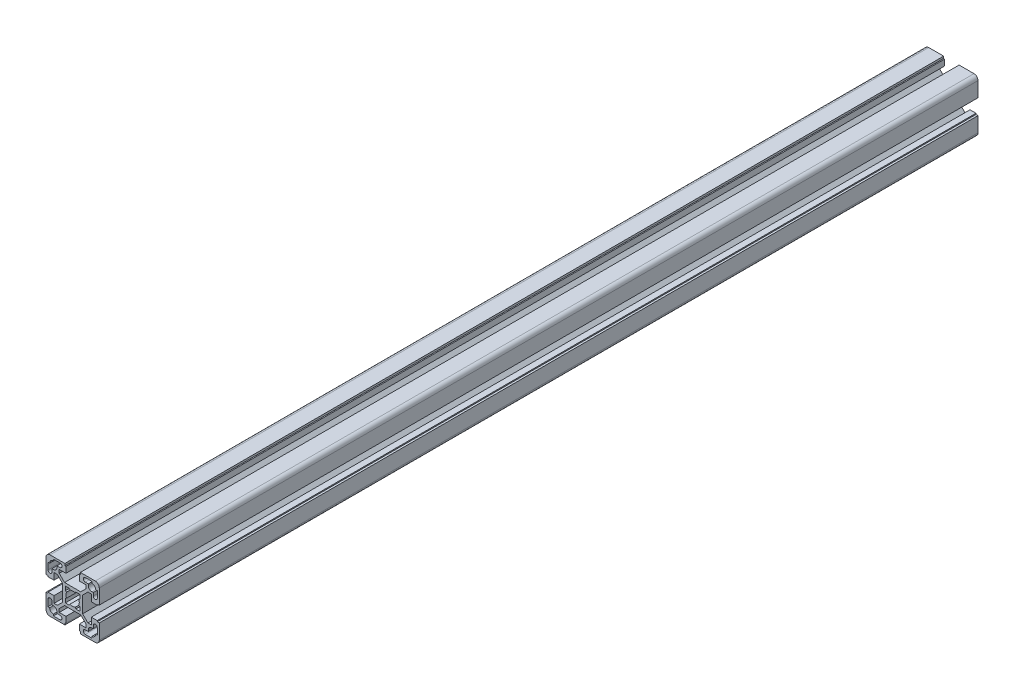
ISO-10303-21;
HEADER;
FILE_DESCRIPTION(('STEP AP214'),'2;1');
FILE_NAME('part.step','',(''),(''),'','','');
FILE_SCHEMA(('AUTOMOTIVE_DESIGN { 1 0 10303 214 1 1 1 1 }'));
ENDSEC;
DATA;
#1=APPLICATION_CONTEXT('core data for automotive mechanical design processes');
#2=APPLICATION_PROTOCOL_DEFINITION('international standard','automotive_design',2000,#1);
#3=PRODUCT_CONTEXT('',#1,'mechanical');
#4=PRODUCT('Part','Part','',(#3));
#5=PRODUCT_RELATED_PRODUCT_CATEGORY('part','',(#4));
#6=PRODUCT_DEFINITION_FORMATION('','',#4);
#7=PRODUCT_DEFINITION_CONTEXT('part definition',#1,'design');
#8=PRODUCT_DEFINITION('design','',#6,#7);
#9=PRODUCT_DEFINITION_SHAPE('','',#8);
#10=(LENGTH_UNIT() NAMED_UNIT(*) SI_UNIT(.MILLI.,.METRE.));
#11=(NAMED_UNIT(*) PLANE_ANGLE_UNIT() SI_UNIT($,.RADIAN.));
#12=(NAMED_UNIT(*) SI_UNIT($,.STERADIAN.) SOLID_ANGLE_UNIT());
#13=UNCERTAINTY_MEASURE_WITH_UNIT(LENGTH_MEASURE(1.E-05),#10,'distance_accuracy_value','');
#14=(GEOMETRIC_REPRESENTATION_CONTEXT(3) GLOBAL_UNCERTAINTY_ASSIGNED_CONTEXT((#13)) GLOBAL_UNIT_ASSIGNED_CONTEXT((#10,
#11,#12)) REPRESENTATION_CONTEXT('',''));
#15=CARTESIAN_POINT('',(0.,0.,0.));
#16=DIRECTION('',(0.,0.,1.));
#17=DIRECTION('',(1.,0.,0.));
#18=AXIS2_PLACEMENT_3D('',#15,#16,#17);
#19=CARTESIAN_POINT('',(-14.5000000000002,-11.75,660.));
#20=DIRECTION('',(0.,-1.,0.));
#21=DIRECTION('',(1.,0.,0.));
#22=AXIS2_PLACEMENT_3D('',#19,#20,#21);
#23=PLANE('',#22);
#24=DIRECTION('',(1.,0.,0.));
#25=VECTOR('',#24,1.);
#26=CARTESIAN_POINT('',(-14.5000000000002,-11.75,660.));
#27=LINE('',#26,#25);
#28=CARTESIAN_POINT('',(-14.5000000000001,-11.75,660.));
#29=VERTEX_POINT('',#28);
#30=CARTESIAN_POINT('',(-15.5000000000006,-11.75,660.));
#31=VERTEX_POINT('',#30);
#32=EDGE_CURVE('E806',#29,#31,#27,.F.);
#33=ORIENTED_EDGE('',*,*,#32,.T.);
#34=DIRECTION('',(0.,0.,1.));
#35=VECTOR('',#34,1.);
#36=CARTESIAN_POINT('',(-15.5000000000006,-11.75,660.));
#37=LINE('',#36,#35);
#38=CARTESIAN_POINT('',(-15.5000000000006,-11.75,0.));
#39=VERTEX_POINT('',#38);
#40=EDGE_CURVE('E804',#39,#31,#37,.T.);
#41=ORIENTED_EDGE('',*,*,#40,.F.);
#42=DIRECTION('',(1.,0.,0.));
#43=VECTOR('',#42,1.);
#44=CARTESIAN_POINT('',(-14.5000000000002,-11.75,0.));
#45=LINE('',#44,#43);
#46=CARTESIAN_POINT('',(-14.5000000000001,-11.75,0.));
#47=VERTEX_POINT('',#46);
#48=EDGE_CURVE('E20',#39,#47,#45,.T.);
#49=ORIENTED_EDGE('',*,*,#48,.T.);
#50=DIRECTION('',(0.,0.,-1.));
#51=VECTOR('',#50,1.);
#52=CARTESIAN_POINT('',(-14.5000000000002,-11.75,660.));
#53=LINE('',#52,#51);
#54=EDGE_CURVE('E801',#47,#29,#53,.F.);
#55=ORIENTED_EDGE('',*,*,#54,.T.);
#56=EDGE_LOOP('',(#33,#41,#49,#55));
#57=FACE_BOUND('',#56,.T.);
#58=ADVANCED_FACE('F17',(#57),#23,.T.);
#59=CARTESIAN_POINT('',(-11.7500000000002,-15.5,660.));
#60=DIRECTION('',(-1.,0.,0.));
#61=DIRECTION('',(0.,-1.,0.));
#62=AXIS2_PLACEMENT_3D('',#59,#60,#61);
#63=PLANE('',#62);
#64=DIRECTION('',(0.,-1.,0.));
#65=VECTOR('',#64,1.);
#66=CARTESIAN_POINT('',(-11.7500000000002,-15.5,660.));
#67=LINE('',#66,#65);
#68=CARTESIAN_POINT('',(-11.7500000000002,-15.5,660.));
#69=VERTEX_POINT('',#68);
#70=CARTESIAN_POINT('',(-11.7500000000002,-14.5,660.));
#71=VERTEX_POINT('',#70);
#72=EDGE_CURVE('E1218',#69,#71,#67,.F.);
#73=ORIENTED_EDGE('',*,*,#72,.T.);
#74=DIRECTION('',(0.,0.,-1.));
#75=VECTOR('',#74,1.);
#76=CARTESIAN_POINT('',(-11.7500000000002,-14.5,660.));
#77=LINE('',#76,#75);
#78=CARTESIAN_POINT('',(-11.7500000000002,-14.5,0.));
#79=VERTEX_POINT('',#78);
#80=EDGE_CURVE('E814',#71,#79,#77,.T.);
#81=ORIENTED_EDGE('',*,*,#80,.T.);
#82=DIRECTION('',(0.,-1.,0.));
#83=VECTOR('',#82,1.);
#84=CARTESIAN_POINT('',(-11.7500000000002,-15.5,0.));
#85=LINE('',#84,#83);
#86=CARTESIAN_POINT('',(-11.7500000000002,-15.5,0.));
#87=VERTEX_POINT('',#86);
#88=EDGE_CURVE('E819',#79,#87,#85,.T.);
#89=ORIENTED_EDGE('',*,*,#88,.T.);
#90=DIRECTION('',(0.,0.,-1.));
#91=VECTOR('',#90,1.);
#92=CARTESIAN_POINT('',(-11.7500000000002,-15.5,660.));
#93=LINE('',#92,#91);
#94=EDGE_CURVE('E1262',#69,#87,#93,.T.);
#95=ORIENTED_EDGE('',*,*,#94,.F.);
#96=EDGE_LOOP('',(#73,#81,#89,#95));
#97=FACE_BOUND('',#96,.T.);
#98=ADVANCED_FACE('F1555',(#97),#63,.T.);
#99=CARTESIAN_POINT('',(-14.5000000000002,-17.25,660.));
#100=DIRECTION('',(1.,0.,0.));
#101=DIRECTION('',(0.,0.,-1.));
#102=AXIS2_PLACEMENT_3D('',#99,#100,#101);
#103=PLANE('',#102);
#104=DIRECTION('',(0.,1.,0.));
#105=VECTOR('',#104,1.);
#106=CARTESIAN_POINT('',(-14.5000000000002,-17.25,660.));
#107=LINE('',#106,#105);
#108=CARTESIAN_POINT('',(-14.5000000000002,-17.25,660.));
#109=VERTEX_POINT('',#108);
#110=CARTESIAN_POINT('',(-14.5000000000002,-18.5,660.));
#111=VERTEX_POINT('',#110);
#112=EDGE_CURVE('E1214',#109,#111,#107,.F.);
#113=ORIENTED_EDGE('',*,*,#112,.T.);
#114=DIRECTION('',(0.,0.,1.));
#115=VECTOR('',#114,1.);
#116=CARTESIAN_POINT('',(-14.5000000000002,-18.5,660.));
#117=LINE('',#116,#115);
#118=CARTESIAN_POINT('',(-14.5000000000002,-18.5,0.));
#119=VERTEX_POINT('',#118);
#120=EDGE_CURVE('E1256',#119,#111,#117,.T.);
#121=ORIENTED_EDGE('',*,*,#120,.F.);
#122=DIRECTION('',(0.,1.,0.));
#123=VECTOR('',#122,1.);
#124=CARTESIAN_POINT('',(-14.5000000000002,-17.25,0.));
#125=LINE('',#124,#123);
#126=CARTESIAN_POINT('',(-14.5000000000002,-17.25,0.));
#127=VERTEX_POINT('',#126);
#128=EDGE_CURVE('E1216',#119,#127,#125,.T.);
#129=ORIENTED_EDGE('',*,*,#128,.T.);
#130=DIRECTION('',(0.,0.,-1.));
#131=VECTOR('',#130,1.);
#132=CARTESIAN_POINT('',(-14.5000000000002,-17.25,660.));
#133=LINE('',#132,#131);
#134=EDGE_CURVE('E1251',#127,#109,#133,.F.);
#135=ORIENTED_EDGE('',*,*,#134,.T.);
#136=EDGE_LOOP('',(#113,#121,#129,#135));
#137=FACE_BOUND('',#136,.T.);
#138=ADVANCED_FACE('F1560',(#137),#103,.T.);
#139=CARTESIAN_POINT('',(-18.5000000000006,-14.5000000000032,660.));
#140=DIRECTION('',(0.,1.,0.));
#141=DIRECTION('',(0.,0.,1.));
#142=AXIS2_PLACEMENT_3D('',#139,#140,#141);
#143=PLANE('',#142);
#144=DIRECTION('',(1.,0.,0.));
#145=VECTOR('',#144,1.);
#146=CARTESIAN_POINT('',(-18.5000000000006,-14.5000000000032,660.));
#147=LINE('',#146,#145);
#148=CARTESIAN_POINT('',(-18.5000000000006,-14.5000000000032,660.));
#149=VERTEX_POINT('',#148);
#150=CARTESIAN_POINT('',(-17.2500000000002,-14.5000000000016,660.));
#151=VERTEX_POINT('',#150);
#152=EDGE_CURVE('E1210',#149,#151,#147,.T.);
#153=ORIENTED_EDGE('',*,*,#152,.T.);
#154=DIRECTION('',(0.,0.,-1.));
#155=VECTOR('',#154,1.);
#156=CARTESIAN_POINT('',(-17.2500000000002,-14.5,660.));
#157=LINE('',#156,#155);
#158=CARTESIAN_POINT('',(-17.2500000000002,-14.5000000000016,0.));
#159=VERTEX_POINT('',#158);
#160=EDGE_CURVE('E1248',#151,#159,#157,.T.);
#161=ORIENTED_EDGE('',*,*,#160,.T.);
#162=DIRECTION('',(1.,0.,0.));
#163=VECTOR('',#162,1.);
#164=CARTESIAN_POINT('',(-18.5000000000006,-14.5000000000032,0.));
#165=LINE('',#164,#163);
#166=CARTESIAN_POINT('',(-18.5000000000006,-14.5000000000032,0.));
#167=VERTEX_POINT('',#166);
#168=EDGE_CURVE('E1212',#159,#167,#165,.F.);
#169=ORIENTED_EDGE('',*,*,#168,.T.);
#170=DIRECTION('',(0.,0.,-1.));
#171=VECTOR('',#170,1.);
#172=CARTESIAN_POINT('',(-18.5000000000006,-14.5000000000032,660.));
#173=LINE('',#172,#171);
#174=EDGE_CURVE('E1242',#149,#167,#173,.T.);
#175=ORIENTED_EDGE('',*,*,#174,.F.);
#176=EDGE_LOOP('',(#153,#161,#169,#175));
#177=FACE_BOUND('',#176,.T.);
#178=ADVANCED_FACE('F1569',(#177),#143,.T.);
#179=CARTESIAN_POINT('',(18.5000000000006,-14.5000000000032,660.));
#180=DIRECTION('',(0.,1.,0.));
#181=DIRECTION('',(0.,0.,1.));
#182=AXIS2_PLACEMENT_3D('',#179,#180,#181);
#183=PLANE('',#182);
#184=DIRECTION('',(1.,0.,0.));
#185=VECTOR('',#184,1.);
#186=CARTESIAN_POINT('',(18.5000000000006,-14.5000000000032,660.));
#187=LINE('',#186,#185);
#188=CARTESIAN_POINT('',(17.2500000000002,-14.5000000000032,660.));
#189=VERTEX_POINT('',#188);
#190=CARTESIAN_POINT('',(18.5000000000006,-14.5000000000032,660.));
#191=VERTEX_POINT('',#190);
#192=EDGE_CURVE('E1206',#189,#191,#187,.T.);
#193=ORIENTED_EDGE('',*,*,#192,.T.);
#194=DIRECTION('',(0.,0.,1.));
#195=VECTOR('',#194,1.);
#196=CARTESIAN_POINT('',(18.5000000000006,-14.5000000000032,660.));
#197=LINE('',#196,#195);
#198=CARTESIAN_POINT('',(18.5000000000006,-14.5000000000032,0.));
#199=VERTEX_POINT('',#198);
#200=EDGE_CURVE('E1947',#199,#191,#197,.T.);
#201=ORIENTED_EDGE('',*,*,#200,.F.);
#202=DIRECTION('',(1.,0.,0.));
#203=VECTOR('',#202,1.);
#204=CARTESIAN_POINT('',(18.5000000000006,-14.5000000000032,0.));
#205=LINE('',#204,#203);
#206=CARTESIAN_POINT('',(17.2500000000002,-14.5000000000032,0.));
#207=VERTEX_POINT('',#206);
#208=EDGE_CURVE('E1208',#199,#207,#205,.F.);
#209=ORIENTED_EDGE('',*,*,#208,.T.);
#210=DIRECTION('',(0.,0.,-1.));
#211=VECTOR('',#210,1.);
#212=CARTESIAN_POINT('',(17.2500000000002,-14.5000000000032,660.));
#213=LINE('',#212,#211);
#214=EDGE_CURVE('E1952',#207,#189,#213,.F.);
#215=ORIENTED_EDGE('',*,*,#214,.T.);
#216=EDGE_LOOP('',(#193,#201,#209,#215));
#217=FACE_BOUND('',#216,.T.);
#218=ADVANCED_FACE('F2472',(#217),#183,.T.);
#219=CARTESIAN_POINT('',(14.5000000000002,-17.25,660.));
#220=DIRECTION('',(-1.,0.,0.));
#221=DIRECTION('',(0.,0.,1.));
#222=AXIS2_PLACEMENT_3D('',#219,#220,#221);
#223=PLANE('',#222);
#224=DIRECTION('',(0.,1.,0.));
#225=VECTOR('',#224,1.);
#226=CARTESIAN_POINT('',(14.5000000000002,-17.25,660.));
#227=LINE('',#226,#225);
#228=CARTESIAN_POINT('',(14.5000000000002,-18.5,660.));
#229=VERTEX_POINT('',#228);
#230=CARTESIAN_POINT('',(14.5000000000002,-17.25,660.));
#231=VERTEX_POINT('',#230);
#232=EDGE_CURVE('E1202',#229,#231,#227,.T.);
#233=ORIENTED_EDGE('',*,*,#232,.T.);
#234=DIRECTION('',(0.,0.,-1.));
#235=VECTOR('',#234,1.);
#236=CARTESIAN_POINT('',(14.5000000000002,-17.25,660.));
#237=LINE('',#236,#235);
#238=CARTESIAN_POINT('',(14.5000000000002,-17.25,0.));
#239=VERTEX_POINT('',#238);
#240=EDGE_CURVE('E1955',#231,#239,#237,.T.);
#241=ORIENTED_EDGE('',*,*,#240,.T.);
#242=DIRECTION('',(0.,1.,0.));
#243=VECTOR('',#242,1.);
#244=CARTESIAN_POINT('',(14.5000000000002,-17.25,0.));
#245=LINE('',#244,#243);
#246=CARTESIAN_POINT('',(14.5000000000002,-18.5,0.));
#247=VERTEX_POINT('',#246);
#248=EDGE_CURVE('E1204',#239,#247,#245,.F.);
#249=ORIENTED_EDGE('',*,*,#248,.T.);
#250=DIRECTION('',(0.,0.,1.));
#251=VECTOR('',#250,1.);
#252=CARTESIAN_POINT('',(14.5000000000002,-18.5,660.));
#253=LINE('',#252,#251);
#254=EDGE_CURVE('E1958',#229,#247,#253,.F.);
#255=ORIENTED_EDGE('',*,*,#254,.F.);
#256=EDGE_LOOP('',(#233,#241,#249,#255));
#257=FACE_BOUND('',#256,.T.);
#258=ADVANCED_FACE('F2468',(#257),#223,.T.);
#259=CARTESIAN_POINT('',(11.7500000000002,-15.5,660.));
#260=DIRECTION('',(1.,0.,0.));
#261=DIRECTION('',(0.,1.,0.));
#262=AXIS2_PLACEMENT_3D('',#259,#260,#261);
#263=PLANE('',#262);
#264=DIRECTION('',(0.,1.,0.));
#265=VECTOR('',#264,1.);
#266=CARTESIAN_POINT('',(11.7500000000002,-15.5,660.));
#267=LINE('',#266,#265);
#268=CARTESIAN_POINT('',(11.7500000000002,-14.5,660.));
#269=VERTEX_POINT('',#268);
#270=CARTESIAN_POINT('',(11.7500000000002,-15.5,660.));
#271=VERTEX_POINT('',#270);
#272=EDGE_CURVE('E1198',#269,#271,#267,.F.);
#273=ORIENTED_EDGE('',*,*,#272,.T.);
#274=DIRECTION('',(0.,0.,-1.));
#275=VECTOR('',#274,1.);
#276=CARTESIAN_POINT('',(11.7500000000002,-15.5,660.));
#277=LINE('',#276,#275);
#278=CARTESIAN_POINT('',(11.7500000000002,-15.5,0.));
#279=VERTEX_POINT('',#278);
#280=EDGE_CURVE('E1964',#279,#271,#277,.F.);
#281=ORIENTED_EDGE('',*,*,#280,.F.);
#282=DIRECTION('',(0.,1.,0.));
#283=VECTOR('',#282,1.);
#284=CARTESIAN_POINT('',(11.7500000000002,-15.5,0.));
#285=LINE('',#284,#283);
#286=CARTESIAN_POINT('',(11.7500000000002,-14.5,0.));
#287=VERTEX_POINT('',#286);
#288=EDGE_CURVE('E1200',#279,#287,#285,.T.);
#289=ORIENTED_EDGE('',*,*,#288,.T.);
#290=DIRECTION('',(0.,0.,-1.));
#291=VECTOR('',#290,1.);
#292=CARTESIAN_POINT('',(11.7500000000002,-14.5,660.));
#293=LINE('',#292,#291);
#294=EDGE_CURVE('E1969',#287,#269,#293,.F.);
#295=ORIENTED_EDGE('',*,*,#294,.T.);
#296=EDGE_LOOP('',(#273,#281,#289,#295));
#297=FACE_BOUND('',#296,.T.);
#298=ADVANCED_FACE('F2465',(#297),#263,.T.);
#299=CARTESIAN_POINT('',(14.5000000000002,-11.75,660.));
#300=DIRECTION('',(0.,-1.,0.));
#301=DIRECTION('',(1.,0.,0.));
#302=AXIS2_PLACEMENT_3D('',#299,#300,#301);
#303=PLANE('',#302);
#304=DIRECTION('',(1.,0.,0.));
#305=VECTOR('',#304,1.);
#306=CARTESIAN_POINT('',(14.5000000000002,-11.75,660.));
#307=LINE('',#306,#305);
#308=CARTESIAN_POINT('',(15.5000000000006,-11.75,660.));
#309=VERTEX_POINT('',#308);
#310=CARTESIAN_POINT('',(14.5000000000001,-11.75,660.));
#311=VERTEX_POINT('',#310);
#312=EDGE_CURVE('E1194',#309,#311,#307,.F.);
#313=ORIENTED_EDGE('',*,*,#312,.T.);
#314=DIRECTION('',(0.,0.,-1.));
#315=VECTOR('',#314,1.);
#316=CARTESIAN_POINT('',(14.5000000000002,-11.75,660.));
#317=LINE('',#316,#315);
#318=CARTESIAN_POINT('',(14.5000000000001,-11.75,0.));
#319=VERTEX_POINT('',#318);
#320=EDGE_CURVE('E1940',#311,#319,#317,.T.);
#321=ORIENTED_EDGE('',*,*,#320,.T.);
#322=DIRECTION('',(1.,0.,0.));
#323=VECTOR('',#322,1.);
#324=CARTESIAN_POINT('',(14.5000000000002,-11.75,0.));
#325=LINE('',#324,#323);
#326=CARTESIAN_POINT('',(15.5000000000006,-11.75,0.));
#327=VERTEX_POINT('',#326);
#328=EDGE_CURVE('E1196',#319,#327,#325,.T.);
#329=ORIENTED_EDGE('',*,*,#328,.T.);
#330=DIRECTION('',(0.,0.,-1.));
#331=VECTOR('',#330,1.);
#332=CARTESIAN_POINT('',(15.5000000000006,-11.75,660.));
#333=LINE('',#332,#331);
#334=EDGE_CURVE('E1237',#309,#327,#333,.T.);
#335=ORIENTED_EDGE('',*,*,#334,.F.);
#336=EDGE_LOOP('',(#313,#321,#329,#335));
#337=FACE_BOUND('',#336,.T.);
#338=ADVANCED_FACE('F1939',(#337),#303,.T.);
#339=CARTESIAN_POINT('',(5.80000000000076,-18.5000000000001,660.));
#340=DIRECTION('',(1.,0.,0.));
#341=DIRECTION('',(0.,0.,-1.));
#342=AXIS2_PLACEMENT_3D('',#339,#340,#341);
#343=PLANE('',#342);
#344=DIRECTION('',(0.,0.,1.));
#345=VECTOR('',#344,1.);
#346=CARTESIAN_POINT('',(5.80000000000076,-20.,660.));
#347=LINE('',#346,#345);
#348=CARTESIAN_POINT('',(5.80000000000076,-20.,0.));
#349=VERTEX_POINT('',#348);
#350=CARTESIAN_POINT('',(5.80000000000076,-20.,660.));
#351=VERTEX_POINT('',#350);
#352=EDGE_CURVE('E1973',#349,#351,#347,.T.);
#353=ORIENTED_EDGE('',*,*,#352,.T.);
#354=DIRECTION('',(0.,1.,0.));
#355=VECTOR('',#354,1.);
#356=CARTESIAN_POINT('',(5.80000000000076,-17.,660.));
#357=LINE('',#356,#355);
#358=CARTESIAN_POINT('',(5.80000000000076,-18.5000000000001,660.));
#359=VERTEX_POINT('',#358);
#360=EDGE_CURVE('E1192',#359,#351,#357,.F.);
#361=ORIENTED_EDGE('',*,*,#360,.F.);
#362=DIRECTION('',(0.,0.,1.));
#363=VECTOR('',#362,1.);
#364=CARTESIAN_POINT('',(5.80000000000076,-18.5000000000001,660.));
#365=LINE('',#364,#363);
#366=CARTESIAN_POINT('',(5.80000000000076,-18.5000000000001,0.));
#367=VERTEX_POINT('',#366);
#368=EDGE_CURVE('E1116',#359,#367,#365,.F.);
#369=ORIENTED_EDGE('',*,*,#368,.T.);
#370=DIRECTION('',(0.,1.,0.));
#371=VECTOR('',#370,1.);
#372=CARTESIAN_POINT('',(5.80000000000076,-17.,0.));
#373=LINE('',#372,#371);
#374=EDGE_CURVE('E1190',#349,#367,#373,.T.);
#375=ORIENTED_EDGE('',*,*,#374,.F.);
#376=EDGE_LOOP('',(#353,#361,#369,#375));
#377=FACE_BOUND('',#376,.T.);
#378=ADVANCED_FACE('F2286',(#377),#343,.F.);
#379=CARTESIAN_POINT('',(20.,-5.79999999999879,660.));
#380=DIRECTION('',(0.,-1.,0.));
#381=DIRECTION('',(0.,0.,-1.));
#382=AXIS2_PLACEMENT_3D('',#379,#380,#381);
#383=PLANE('',#382);
#384=DIRECTION('',(0.,0.,1.));
#385=VECTOR('',#384,1.);
#386=CARTESIAN_POINT('',(18.5,-5.79999999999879,660.));
#387=LINE('',#386,#385);
#388=CARTESIAN_POINT('',(18.5,-5.79999999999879,0.));
#389=VERTEX_POINT('',#388);
#390=CARTESIAN_POINT('',(18.5,-5.79999999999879,660.));
#391=VERTEX_POINT('',#390);
#392=EDGE_CURVE('E1185',#389,#391,#387,.T.);
#393=ORIENTED_EDGE('',*,*,#392,.T.);
#394=DIRECTION('',(1.,0.,0.));
#395=VECTOR('',#394,1.);
#396=CARTESIAN_POINT('',(17.,-5.79999999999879,660.));
#397=LINE('',#396,#395);
#398=CARTESIAN_POINT('',(20.,-5.79999999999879,660.));
#399=VERTEX_POINT('',#398);
#400=EDGE_CURVE('E1188',#399,#391,#397,.F.);
#401=ORIENTED_EDGE('',*,*,#400,.F.);
#402=DIRECTION('',(0.,0.,1.));
#403=VECTOR('',#402,1.);
#404=CARTESIAN_POINT('',(20.,-5.79999999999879,660.));
#405=LINE('',#404,#403);
#406=CARTESIAN_POINT('',(20.,-5.79999999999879,0.));
#407=VERTEX_POINT('',#406);
#408=EDGE_CURVE('E1981',#399,#407,#405,.F.);
#409=ORIENTED_EDGE('',*,*,#408,.T.);
#410=DIRECTION('',(1.,0.,0.));
#411=VECTOR('',#410,1.);
#412=CARTESIAN_POINT('',(17.,-5.79999999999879,0.));
#413=LINE('',#412,#411);
#414=EDGE_CURVE('E1186',#389,#407,#413,.T.);
#415=ORIENTED_EDGE('',*,*,#414,.F.);
#416=EDGE_LOOP('',(#393,#401,#409,#415));
#417=FACE_BOUND('',#416,.T.);
#418=ADVANCED_FACE('F2294',(#417),#383,.F.);
#419=CARTESIAN_POINT('',(18.5,-5.79999999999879,660.));
#420=DIRECTION('',(-1.,0.,0.));
#421=DIRECTION('',(0.,0.,1.));
#422=AXIS2_PLACEMENT_3D('',#419,#420,#421);
#423=PLANE('',#422);
#424=DIRECTION('',(0.,0.,-1.));
#425=VECTOR('',#424,1.);
#426=CARTESIAN_POINT('',(18.5,-4.99999999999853,660.));
#427=LINE('',#426,#425);
#428=CARTESIAN_POINT('',(18.5,-4.99999999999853,0.));
#429=VERTEX_POINT('',#428);
#430=CARTESIAN_POINT('',(18.5,-4.99999999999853,660.));
#431=VERTEX_POINT('',#430);
#432=EDGE_CURVE('E1984',#429,#431,#427,.F.);
#433=ORIENTED_EDGE('',*,*,#432,.T.);
#434=DIRECTION('',(0.,1.,0.));
#435=VECTOR('',#434,1.);
#436=CARTESIAN_POINT('',(18.5,-17.,660.));
#437=LINE('',#436,#435);
#438=EDGE_CURVE('E1183',#391,#431,#437,.T.);
#439=ORIENTED_EDGE('',*,*,#438,.F.);
#440=ORIENTED_EDGE('',*,*,#392,.F.);
#441=DIRECTION('',(0.,1.,0.));
#442=VECTOR('',#441,1.);
#443=CARTESIAN_POINT('',(18.5,-17.,0.));
#444=LINE('',#443,#442);
#445=EDGE_CURVE('E1180',#429,#389,#444,.F.);
#446=ORIENTED_EDGE('',*,*,#445,.F.);
#447=EDGE_LOOP('',(#433,#439,#440,#446));
#448=FACE_BOUND('',#447,.T.);
#449=ADVANCED_FACE('F2297',(#448),#423,.F.);
#450=CARTESIAN_POINT('',(18.5,5.79999999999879,660.));
#451=DIRECTION('',(-1.,0.,0.));
#452=DIRECTION('',(0.,0.,1.));
#453=AXIS2_PLACEMENT_3D('',#450,#451,#452);
#454=PLANE('',#453);
#455=DIRECTION('',(0.,0.,1.));
#456=VECTOR('',#455,1.);
#457=CARTESIAN_POINT('',(18.5,5.79999999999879,660.));
#458=LINE('',#457,#456);
#459=CARTESIAN_POINT('',(18.5,5.79999999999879,0.));
#460=VERTEX_POINT('',#459);
#461=CARTESIAN_POINT('',(18.5,5.79999999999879,660.));
#462=VERTEX_POINT('',#461);
#463=EDGE_CURVE('E1175',#460,#462,#458,.T.);
#464=ORIENTED_EDGE('',*,*,#463,.T.);
#465=DIRECTION('',(0.,1.,0.));
#466=VECTOR('',#465,1.);
#467=CARTESIAN_POINT('',(18.5,-17.,660.));
#468=LINE('',#467,#466);
#469=CARTESIAN_POINT('',(18.5,4.99999999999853,660.));
#470=VERTEX_POINT('',#469);
#471=EDGE_CURVE('E1178',#470,#462,#468,.T.);
#472=ORIENTED_EDGE('',*,*,#471,.F.);
#473=DIRECTION('',(0.,0.,1.));
#474=VECTOR('',#473,1.);
#475=CARTESIAN_POINT('',(18.5,4.99999999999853,660.));
#476=LINE('',#475,#474);
#477=CARTESIAN_POINT('',(18.5,4.99999999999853,0.));
#478=VERTEX_POINT('',#477);
#479=EDGE_CURVE('E2011',#470,#478,#476,.F.);
#480=ORIENTED_EDGE('',*,*,#479,.T.);
#481=DIRECTION('',(0.,1.,0.));
#482=VECTOR('',#481,1.);
#483=CARTESIAN_POINT('',(18.5,-17.,0.));
#484=LINE('',#483,#482);
#485=EDGE_CURVE('E1176',#460,#478,#484,.F.);
#486=ORIENTED_EDGE('',*,*,#485,.F.);
#487=EDGE_LOOP('',(#464,#472,#480,#486));
#488=FACE_BOUND('',#487,.T.);
#489=ADVANCED_FACE('F2319',(#488),#454,.F.);
#490=CARTESIAN_POINT('',(20.,5.79999999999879,660.));
#491=DIRECTION('',(0.,1.,0.));
#492=DIRECTION('',(0.,0.,1.));
#493=AXIS2_PLACEMENT_3D('',#490,#491,#492);
#494=PLANE('',#493);
#495=DIRECTION('',(0.,0.,1.));
#496=VECTOR('',#495,1.);
#497=CARTESIAN_POINT('',(20.,5.79999999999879,660.));
#498=LINE('',#497,#496);
#499=CARTESIAN_POINT('',(20.,5.79999999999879,0.));
#500=VERTEX_POINT('',#499);
#501=CARTESIAN_POINT('',(20.,5.79999999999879,660.));
#502=VERTEX_POINT('',#501);
#503=EDGE_CURVE('E2014',#500,#502,#498,.T.);
#504=ORIENTED_EDGE('',*,*,#503,.T.);
#505=DIRECTION('',(1.,0.,0.));
#506=VECTOR('',#505,1.);
#507=CARTESIAN_POINT('',(17.,5.79999999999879,660.));
#508=LINE('',#507,#506);
#509=EDGE_CURVE('E1173',#462,#502,#508,.T.);
#510=ORIENTED_EDGE('',*,*,#509,.F.);
#511=ORIENTED_EDGE('',*,*,#463,.F.);
#512=DIRECTION('',(1.,0.,0.));
#513=VECTOR('',#512,1.);
#514=CARTESIAN_POINT('',(17.,5.79999999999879,0.));
#515=LINE('',#514,#513);
#516=EDGE_CURVE('E1170',#500,#460,#515,.F.);
#517=ORIENTED_EDGE('',*,*,#516,.F.);
#518=EDGE_LOOP('',(#504,#510,#511,#517));
#519=FACE_BOUND('',#518,.T.);
#520=ADVANCED_FACE('F2323',(#519),#494,.F.);
#521=CARTESIAN_POINT('',(5.80000000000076,18.5000000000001,660.));
#522=DIRECTION('',(1.,0.,0.));
#523=DIRECTION('',(0.,0.,-1.));
#524=AXIS2_PLACEMENT_3D('',#521,#522,#523);
#525=PLANE('',#524);
#526=DIRECTION('',(0.,0.,-1.));
#527=VECTOR('',#526,1.);
#528=CARTESIAN_POINT('',(5.80000000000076,18.5000000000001,660.));
#529=LINE('',#528,#527);
#530=CARTESIAN_POINT('',(5.80000000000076,18.5000000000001,0.));
#531=VERTEX_POINT('',#530);
#532=CARTESIAN_POINT('',(5.80000000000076,18.5000000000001,660.));
#533=VERTEX_POINT('',#532);
#534=EDGE_CURVE('E1165',#531,#533,#529,.F.);
#535=ORIENTED_EDGE('',*,*,#534,.T.);
#536=DIRECTION('',(0.,1.,0.));
#537=VECTOR('',#536,1.);
#538=CARTESIAN_POINT('',(5.80000000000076,-17.,660.));
#539=LINE('',#538,#537);
#540=CARTESIAN_POINT('',(5.80000000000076,20.,660.));
#541=VERTEX_POINT('',#540);
#542=EDGE_CURVE('E1168',#541,#533,#539,.F.);
#543=ORIENTED_EDGE('',*,*,#542,.F.);
#544=DIRECTION('',(0.,0.,-1.));
#545=VECTOR('',#544,1.);
#546=CARTESIAN_POINT('',(5.80000000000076,20.,660.));
#547=LINE('',#546,#545);
#548=CARTESIAN_POINT('',(5.80000000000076,20.,0.));
#549=VERTEX_POINT('',#548);
#550=EDGE_CURVE('E2022',#541,#549,#547,.T.);
#551=ORIENTED_EDGE('',*,*,#550,.T.);
#552=DIRECTION('',(0.,1.,0.));
#553=VECTOR('',#552,1.);
#554=CARTESIAN_POINT('',(5.80000000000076,-17.,0.));
#555=LINE('',#554,#553);
#556=EDGE_CURVE('E1166',#531,#549,#555,.T.);
#557=ORIENTED_EDGE('',*,*,#556,.F.);
#558=EDGE_LOOP('',(#535,#543,#551,#557));
#559=FACE_BOUND('',#558,.T.);
#560=ADVANCED_FACE('F2334',(#559),#525,.F.);
#561=CARTESIAN_POINT('',(5.00000000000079,18.5000000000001,660.));
#562=DIRECTION('',(0.,-1.,0.));
#563=DIRECTION('',(0.,0.,-1.));
#564=AXIS2_PLACEMENT_3D('',#561,#562,#563);
#565=PLANE('',#564);
#566=DIRECTION('',(0.,0.,1.));
#567=VECTOR('',#566,1.);
#568=CARTESIAN_POINT('',(5.00000000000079,18.5000000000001,660.));
#569=LINE('',#568,#567);
#570=CARTESIAN_POINT('',(5.00000000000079,18.5000000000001,0.));
#571=VERTEX_POINT('',#570);
#572=CARTESIAN_POINT('',(5.00000000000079,18.5000000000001,660.));
#573=VERTEX_POINT('',#572);
#574=EDGE_CURVE('E2025',#571,#573,#569,.T.);
#575=ORIENTED_EDGE('',*,*,#574,.T.);
#576=DIRECTION('',(1.,0.,0.));
#577=VECTOR('',#576,1.);
#578=CARTESIAN_POINT('',(17.,18.5000000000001,660.));
#579=LINE('',#578,#577);
#580=EDGE_CURVE('E1163',#533,#573,#579,.F.);
#581=ORIENTED_EDGE('',*,*,#580,.F.);
#582=ORIENTED_EDGE('',*,*,#534,.F.);
#583=DIRECTION('',(1.,0.,0.));
#584=VECTOR('',#583,1.);
#585=CARTESIAN_POINT('',(17.,18.5000000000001,0.));
#586=LINE('',#585,#584);
#587=EDGE_CURVE('E1160',#571,#531,#586,.T.);
#588=ORIENTED_EDGE('',*,*,#587,.F.);
#589=EDGE_LOOP('',(#575,#581,#582,#588));
#590=FACE_BOUND('',#589,.T.);
#591=ADVANCED_FACE('F2338',(#590),#565,.F.);
#592=CARTESIAN_POINT('',(-5.00000000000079,18.5000000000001,660.));
#593=DIRECTION('',(0.,-1.,0.));
#594=DIRECTION('',(0.,0.,-1.));
#595=AXIS2_PLACEMENT_3D('',#592,#593,#594);
#596=PLANE('',#595);
#597=DIRECTION('',(0.,0.,1.));
#598=VECTOR('',#597,1.);
#599=CARTESIAN_POINT('',(-5.80000000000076,18.5000000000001,660.));
#600=LINE('',#599,#598);
#601=CARTESIAN_POINT('',(-5.80000000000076,18.5000000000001,0.));
#602=VERTEX_POINT('',#601);
#603=CARTESIAN_POINT('',(-5.80000000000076,18.5000000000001,660.));
#604=VERTEX_POINT('',#603);
#605=EDGE_CURVE('E1155',#602,#604,#600,.T.);
#606=ORIENTED_EDGE('',*,*,#605,.T.);
#607=DIRECTION('',(1.,0.,0.));
#608=VECTOR('',#607,1.);
#609=CARTESIAN_POINT('',(17.,18.5000000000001,660.));
#610=LINE('',#609,#608);
#611=CARTESIAN_POINT('',(-5.00000000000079,18.5000000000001,660.));
#612=VERTEX_POINT('',#611);
#613=EDGE_CURVE('E1158',#612,#604,#610,.F.);
#614=ORIENTED_EDGE('',*,*,#613,.F.);
#615=DIRECTION('',(0.,0.,1.));
#616=VECTOR('',#615,1.);
#617=CARTESIAN_POINT('',(-5.00000000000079,18.5000000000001,660.));
#618=LINE('',#617,#616);
#619=CARTESIAN_POINT('',(-5.00000000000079,18.5000000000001,0.));
#620=VERTEX_POINT('',#619);
#621=EDGE_CURVE('E2052',#612,#620,#618,.F.);
#622=ORIENTED_EDGE('',*,*,#621,.T.);
#623=DIRECTION('',(1.,0.,0.));
#624=VECTOR('',#623,1.);
#625=CARTESIAN_POINT('',(17.,18.5000000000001,0.));
#626=LINE('',#625,#624);
#627=EDGE_CURVE('E1156',#602,#620,#626,.T.);
#628=ORIENTED_EDGE('',*,*,#627,.F.);
#629=EDGE_LOOP('',(#606,#614,#622,#628));
#630=FACE_BOUND('',#629,.T.);
#631=ADVANCED_FACE('F2360',(#630),#596,.F.);
#632=CARTESIAN_POINT('',(-5.80000000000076,18.5000000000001,660.));
#633=DIRECTION('',(-1.,0.,0.));
#634=DIRECTION('',(0.,0.,1.));
#635=AXIS2_PLACEMENT_3D('',#632,#633,#634);
#636=PLANE('',#635);
#637=DIRECTION('',(0.,0.,1.));
#638=VECTOR('',#637,1.);
#639=CARTESIAN_POINT('',(-5.80000000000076,20.,660.));
#640=LINE('',#639,#638);
#641=CARTESIAN_POINT('',(-5.80000000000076,20.,0.));
#642=VERTEX_POINT('',#641);
#643=CARTESIAN_POINT('',(-5.80000000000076,20.,660.));
#644=VERTEX_POINT('',#643);
#645=EDGE_CURVE('E2055',#642,#644,#640,.T.);
#646=ORIENTED_EDGE('',*,*,#645,.T.);
#647=DIRECTION('',(0.,1.,0.));
#648=VECTOR('',#647,1.);
#649=CARTESIAN_POINT('',(-5.80000000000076,-17.,660.));
#650=LINE('',#649,#648);
#651=EDGE_CURVE('E1153',#604,#644,#650,.T.);
#652=ORIENTED_EDGE('',*,*,#651,.F.);
#653=ORIENTED_EDGE('',*,*,#605,.F.);
#654=DIRECTION('',(0.,1.,0.));
#655=VECTOR('',#654,1.);
#656=CARTESIAN_POINT('',(-5.80000000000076,-17.,0.));
#657=LINE('',#656,#655);
#658=EDGE_CURVE('E1150',#642,#602,#657,.F.);
#659=ORIENTED_EDGE('',*,*,#658,.F.);
#660=EDGE_LOOP('',(#646,#652,#653,#659));
#661=FACE_BOUND('',#660,.T.);
#662=ADVANCED_FACE('F2364',(#661),#636,.F.);
#663=CARTESIAN_POINT('',(-20.,5.79999999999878,660.));
#664=DIRECTION('',(0.,1.,0.));
#665=DIRECTION('',(0.,0.,1.));
#666=AXIS2_PLACEMENT_3D('',#663,#664,#665);
#667=PLANE('',#666);
#668=DIRECTION('',(0.,0.,-1.));
#669=VECTOR('',#668,1.);
#670=CARTESIAN_POINT('',(-18.5,5.79999999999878,660.));
#671=LINE('',#670,#669);
#672=CARTESIAN_POINT('',(-18.5,5.79999999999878,0.));
#673=VERTEX_POINT('',#672);
#674=CARTESIAN_POINT('',(-18.5,5.79999999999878,660.));
#675=VERTEX_POINT('',#674);
#676=EDGE_CURVE('E1145',#673,#675,#671,.F.);
#677=ORIENTED_EDGE('',*,*,#676,.T.);
#678=DIRECTION('',(1.,0.,0.));
#679=VECTOR('',#678,1.);
#680=CARTESIAN_POINT('',(17.,5.79999999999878,660.));
#681=LINE('',#680,#679);
#682=CARTESIAN_POINT('',(-20.,5.79999999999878,660.));
#683=VERTEX_POINT('',#682);
#684=EDGE_CURVE('E1148',#683,#675,#681,.T.);
#685=ORIENTED_EDGE('',*,*,#684,.F.);
#686=DIRECTION('',(0.,0.,1.));
#687=VECTOR('',#686,1.);
#688=CARTESIAN_POINT('',(-20.,5.79999999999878,660.));
#689=LINE('',#688,#687);
#690=CARTESIAN_POINT('',(-20.,5.79999999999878,0.));
#691=VERTEX_POINT('',#690);
#692=EDGE_CURVE('E2063',#683,#691,#689,.F.);
#693=ORIENTED_EDGE('',*,*,#692,.T.);
#694=DIRECTION('',(1.,0.,0.));
#695=VECTOR('',#694,1.);
#696=CARTESIAN_POINT('',(17.,5.79999999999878,0.));
#697=LINE('',#696,#695);
#698=EDGE_CURVE('E1146',#673,#691,#697,.F.);
#699=ORIENTED_EDGE('',*,*,#698,.F.);
#700=EDGE_LOOP('',(#677,#685,#693,#699));
#701=FACE_BOUND('',#700,.T.);
#702=ADVANCED_FACE('F2375',(#701),#667,.F.);
#703=CARTESIAN_POINT('',(-18.5,5.79999999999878,660.));
#704=DIRECTION('',(1.,0.,0.));
#705=DIRECTION('',(0.,0.,-1.));
#706=AXIS2_PLACEMENT_3D('',#703,#704,#705);
#707=PLANE('',#706);
#708=DIRECTION('',(0.,0.,1.));
#709=VECTOR('',#708,1.);
#710=CARTESIAN_POINT('',(-18.5,4.99999999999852,660.));
#711=LINE('',#710,#709);
#712=CARTESIAN_POINT('',(-18.5,4.99999999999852,0.));
#713=VERTEX_POINT('',#712);
#714=CARTESIAN_POINT('',(-18.5,4.99999999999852,660.));
#715=VERTEX_POINT('',#714);
#716=EDGE_CURVE('E2066',#713,#715,#711,.T.);
#717=ORIENTED_EDGE('',*,*,#716,.T.);
#718=DIRECTION('',(0.,1.,0.));
#719=VECTOR('',#718,1.);
#720=CARTESIAN_POINT('',(-18.5,-17.,660.));
#721=LINE('',#720,#719);
#722=EDGE_CURVE('E1143',#675,#715,#721,.F.);
#723=ORIENTED_EDGE('',*,*,#722,.F.);
#724=ORIENTED_EDGE('',*,*,#676,.F.);
#725=DIRECTION('',(0.,1.,0.));
#726=VECTOR('',#725,1.);
#727=CARTESIAN_POINT('',(-18.5,-17.,0.));
#728=LINE('',#727,#726);
#729=EDGE_CURVE('E1140',#713,#673,#728,.T.);
#730=ORIENTED_EDGE('',*,*,#729,.F.);
#731=EDGE_LOOP('',(#717,#723,#724,#730));
#732=FACE_BOUND('',#731,.T.);
#733=ADVANCED_FACE('F2379',(#732),#707,.F.);
#734=CARTESIAN_POINT('',(-18.5,-5.79999999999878,660.));
#735=DIRECTION('',(1.,0.,0.));
#736=DIRECTION('',(0.,0.,-1.));
#737=AXIS2_PLACEMENT_3D('',#734,#735,#736);
#738=PLANE('',#737);
#739=DIRECTION('',(0.,0.,-1.));
#740=VECTOR('',#739,1.);
#741=CARTESIAN_POINT('',(-18.5,-5.79999999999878,660.));
#742=LINE('',#741,#740);
#743=CARTESIAN_POINT('',(-18.5,-5.79999999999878,0.));
#744=VERTEX_POINT('',#743);
#745=CARTESIAN_POINT('',(-18.5,-5.79999999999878,660.));
#746=VERTEX_POINT('',#745);
#747=EDGE_CURVE('E1135',#744,#746,#742,.F.);
#748=ORIENTED_EDGE('',*,*,#747,.T.);
#749=DIRECTION('',(0.,1.,0.));
#750=VECTOR('',#749,1.);
#751=CARTESIAN_POINT('',(-18.5,-17.,660.));
#752=LINE('',#751,#750);
#753=CARTESIAN_POINT('',(-18.5,-4.99999999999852,660.));
#754=VERTEX_POINT('',#753);
#755=EDGE_CURVE('E1138',#754,#746,#752,.F.);
#756=ORIENTED_EDGE('',*,*,#755,.F.);
#757=DIRECTION('',(0.,0.,1.));
#758=VECTOR('',#757,1.);
#759=CARTESIAN_POINT('',(-18.5,-4.99999999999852,660.));
#760=LINE('',#759,#758);
#761=CARTESIAN_POINT('',(-18.5,-4.99999999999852,0.));
#762=VERTEX_POINT('',#761);
#763=EDGE_CURVE('E2093',#754,#762,#760,.F.);
#764=ORIENTED_EDGE('',*,*,#763,.T.);
#765=DIRECTION('',(0.,1.,0.));
#766=VECTOR('',#765,1.);
#767=CARTESIAN_POINT('',(-18.5,-17.,0.));
#768=LINE('',#767,#766);
#769=EDGE_CURVE('E1136',#744,#762,#768,.T.);
#770=ORIENTED_EDGE('',*,*,#769,.F.);
#771=EDGE_LOOP('',(#748,#756,#764,#770));
#772=FACE_BOUND('',#771,.T.);
#773=ADVANCED_FACE('F2401',(#772),#738,.F.);
#774=CARTESIAN_POINT('',(-20.,-5.79999999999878,660.));
#775=DIRECTION('',(0.,-1.,0.));
#776=DIRECTION('',(0.,0.,-1.));
#777=AXIS2_PLACEMENT_3D('',#774,#775,#776);
#778=PLANE('',#777);
#779=DIRECTION('',(0.,0.,1.));
#780=VECTOR('',#779,1.);
#781=CARTESIAN_POINT('',(-20.,-5.79999999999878,660.));
#782=LINE('',#781,#780);
#783=CARTESIAN_POINT('',(-20.,-5.79999999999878,0.));
#784=VERTEX_POINT('',#783);
#785=CARTESIAN_POINT('',(-20.,-5.79999999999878,660.));
#786=VERTEX_POINT('',#785);
#787=EDGE_CURVE('E2096',#784,#786,#782,.T.);
#788=ORIENTED_EDGE('',*,*,#787,.T.);
#789=DIRECTION('',(1.,0.,0.));
#790=VECTOR('',#789,1.);
#791=CARTESIAN_POINT('',(17.,-5.79999999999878,660.));
#792=LINE('',#791,#790);
#793=EDGE_CURVE('E1133',#746,#786,#792,.F.);
#794=ORIENTED_EDGE('',*,*,#793,.F.);
#795=ORIENTED_EDGE('',*,*,#747,.F.);
#796=DIRECTION('',(1.,0.,0.));
#797=VECTOR('',#796,1.);
#798=CARTESIAN_POINT('',(17.,-5.79999999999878,0.));
#799=LINE('',#798,#797);
#800=EDGE_CURVE('E1130',#784,#744,#799,.T.);
#801=ORIENTED_EDGE('',*,*,#800,.F.);
#802=EDGE_LOOP('',(#788,#794,#795,#801));
#803=FACE_BOUND('',#802,.T.);
#804=ADVANCED_FACE('F2405',(#803),#778,.F.);
#805=CARTESIAN_POINT('',(-5.80000000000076,-18.5000000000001,660.));
#806=DIRECTION('',(-1.,0.,0.));
#807=DIRECTION('',(0.,0.,1.));
#808=AXIS2_PLACEMENT_3D('',#805,#806,#807);
#809=PLANE('',#808);
#810=DIRECTION('',(0.,0.,1.));
#811=VECTOR('',#810,1.);
#812=CARTESIAN_POINT('',(-5.80000000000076,-18.5000000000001,660.));
#813=LINE('',#812,#811);
#814=CARTESIAN_POINT('',(-5.80000000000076,-18.5000000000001,0.));
#815=VERTEX_POINT('',#814);
#816=CARTESIAN_POINT('',(-5.80000000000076,-18.5000000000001,660.));
#817=VERTEX_POINT('',#816);
#818=EDGE_CURVE('E1125',#815,#817,#813,.T.);
#819=ORIENTED_EDGE('',*,*,#818,.T.);
#820=DIRECTION('',(0.,1.,0.));
#821=VECTOR('',#820,1.);
#822=CARTESIAN_POINT('',(-5.80000000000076,-17.,660.));
#823=LINE('',#822,#821);
#824=CARTESIAN_POINT('',(-5.80000000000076,-20.,660.));
#825=VERTEX_POINT('',#824);
#826=EDGE_CURVE('E1128',#825,#817,#823,.T.);
#827=ORIENTED_EDGE('',*,*,#826,.F.);
#828=DIRECTION('',(0.,0.,1.));
#829=VECTOR('',#828,1.);
#830=CARTESIAN_POINT('',(-5.80000000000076,-20.,660.));
#831=LINE('',#830,#829);
#832=CARTESIAN_POINT('',(-5.80000000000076,-20.,0.));
#833=VERTEX_POINT('',#832);
#834=EDGE_CURVE('E2104',#825,#833,#831,.F.);
#835=ORIENTED_EDGE('',*,*,#834,.T.);
#836=DIRECTION('',(0.,1.,0.));
#837=VECTOR('',#836,1.);
#838=CARTESIAN_POINT('',(-5.80000000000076,-17.,0.));
#839=LINE('',#838,#837);
#840=EDGE_CURVE('E1126',#815,#833,#839,.F.);
#841=ORIENTED_EDGE('',*,*,#840,.F.);
#842=EDGE_LOOP('',(#819,#827,#835,#841));
#843=FACE_BOUND('',#842,.T.);
#844=ADVANCED_FACE('F2416',(#843),#809,.F.);
#845=CARTESIAN_POINT('',(-5.00000000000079,-18.5000000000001,660.));
#846=DIRECTION('',(0.,1.,0.));
#847=DIRECTION('',(0.,0.,1.));
#848=AXIS2_PLACEMENT_3D('',#845,#846,#847);
#849=PLANE('',#848);
#850=DIRECTION('',(0.,0.,1.));
#851=VECTOR('',#850,1.);
#852=CARTESIAN_POINT('',(-5.00000000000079,-18.5000000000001,660.));
#853=LINE('',#852,#851);
#854=CARTESIAN_POINT('',(-5.00000000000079,-18.5000000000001,0.));
#855=VERTEX_POINT('',#854);
#856=CARTESIAN_POINT('',(-5.00000000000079,-18.5000000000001,660.));
#857=VERTEX_POINT('',#856);
#858=EDGE_CURVE('E2107',#855,#857,#853,.T.);
#859=ORIENTED_EDGE('',*,*,#858,.T.);
#860=DIRECTION('',(1.,0.,0.));
#861=VECTOR('',#860,1.);
#862=CARTESIAN_POINT('',(17.,-18.5000000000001,660.));
#863=LINE('',#862,#861);
#864=EDGE_CURVE('E1123',#817,#857,#863,.T.);
#865=ORIENTED_EDGE('',*,*,#864,.F.);
#866=ORIENTED_EDGE('',*,*,#818,.F.);
#867=DIRECTION('',(1.,0.,0.));
#868=VECTOR('',#867,1.);
#869=CARTESIAN_POINT('',(17.,-18.5000000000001,0.));
#870=LINE('',#869,#868);
#871=EDGE_CURVE('E1120',#855,#815,#870,.F.);
#872=ORIENTED_EDGE('',*,*,#871,.F.);
#873=EDGE_LOOP('',(#859,#865,#866,#872));
#874=FACE_BOUND('',#873,.T.);
#875=ADVANCED_FACE('F2420',(#874),#849,.F.);
#876=CARTESIAN_POINT('',(5.00000000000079,-18.5000000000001,660.));
#877=DIRECTION('',(0.,1.,0.));
#878=DIRECTION('',(0.,0.,1.));
#879=AXIS2_PLACEMENT_3D('',#876,#877,#878);
#880=PLANE('',#879);
#881=ORIENTED_EDGE('',*,*,#368,.F.);
#882=DIRECTION('',(1.,0.,0.));
#883=VECTOR('',#882,1.);
#884=CARTESIAN_POINT('',(17.,-18.5000000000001,660.));
#885=LINE('',#884,#883);
#886=CARTESIAN_POINT('',(5.00000000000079,-18.5000000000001,660.));
#887=VERTEX_POINT('',#886);
#888=EDGE_CURVE('E1117',#887,#359,#885,.T.);
#889=ORIENTED_EDGE('',*,*,#888,.F.);
#890=DIRECTION('',(0.,0.,1.));
#891=VECTOR('',#890,1.);
#892=CARTESIAN_POINT('',(5.00000000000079,-18.5000000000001,660.));
#893=LINE('',#892,#891);
#894=CARTESIAN_POINT('',(5.00000000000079,-18.5000000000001,0.));
#895=VERTEX_POINT('',#894);
#896=EDGE_CURVE('E2126',#887,#895,#893,.F.);
#897=ORIENTED_EDGE('',*,*,#896,.T.);
#898=DIRECTION('',(1.,0.,0.));
#899=VECTOR('',#898,1.);
#900=CARTESIAN_POINT('',(17.,-18.5000000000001,0.));
#901=LINE('',#900,#899);
#902=EDGE_CURVE('E1114',#367,#895,#901,.F.);
#903=ORIENTED_EDGE('',*,*,#902,.F.);
#904=EDGE_LOOP('',(#881,#889,#897,#903));
#905=FACE_BOUND('',#904,.T.);
#906=ADVANCED_FACE('F2277',(#905),#880,.F.);
#907=CARTESIAN_POINT('',(14.5000000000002,11.75,660.));
#908=DIRECTION('',(0.,1.,0.));
#909=DIRECTION('',(-1.,0.,0.));
#910=AXIS2_PLACEMENT_3D('',#907,#908,#909);
#911=PLANE('',#910);
#912=DIRECTION('',(-1.,0.,0.));
#913=VECTOR('',#912,1.);
#914=CARTESIAN_POINT('',(14.5000000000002,11.75,660.));
#915=LINE('',#914,#913);
#916=CARTESIAN_POINT('',(14.5000000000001,11.75,660.));
#917=VERTEX_POINT('',#916);
#918=CARTESIAN_POINT('',(15.5000000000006,11.75,660.));
#919=VERTEX_POINT('',#918);
#920=EDGE_CURVE('E1110',#917,#919,#915,.F.);
#921=ORIENTED_EDGE('',*,*,#920,.T.);
#922=DIRECTION('',(0.,0.,-1.));
#923=VECTOR('',#922,1.);
#924=CARTESIAN_POINT('',(15.5000000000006,11.75,660.));
#925=LINE('',#924,#923);
#926=CARTESIAN_POINT('',(15.5000000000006,11.75,0.));
#927=VERTEX_POINT('',#926);
#928=EDGE_CURVE('E2129',#927,#919,#925,.F.);
#929=ORIENTED_EDGE('',*,*,#928,.F.);
#930=DIRECTION('',(-1.,0.,0.));
#931=VECTOR('',#930,1.);
#932=CARTESIAN_POINT('',(14.5000000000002,11.75,0.));
#933=LINE('',#932,#931);
#934=CARTESIAN_POINT('',(14.5000000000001,11.75,0.));
#935=VERTEX_POINT('',#934);
#936=EDGE_CURVE('E1112',#927,#935,#933,.T.);
#937=ORIENTED_EDGE('',*,*,#936,.T.);
#938=DIRECTION('',(0.,0.,-1.));
#939=VECTOR('',#938,1.);
#940=CARTESIAN_POINT('',(14.5000000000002,11.75,660.));
#941=LINE('',#940,#939);
#942=EDGE_CURVE('E2132',#935,#917,#941,.F.);
#943=ORIENTED_EDGE('',*,*,#942,.T.);
#944=EDGE_LOOP('',(#921,#929,#937,#943));
#945=FACE_BOUND('',#944,.T.);
#946=ADVANCED_FACE('F2432',(#945),#911,.T.);
#947=CARTESIAN_POINT('',(11.7500000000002,15.5,660.));
#948=DIRECTION('',(1.,0.,0.));
#949=DIRECTION('',(0.,1.,0.));
#950=AXIS2_PLACEMENT_3D('',#947,#948,#949);
#951=PLANE('',#950);
#952=DIRECTION('',(0.,1.,0.));
#953=VECTOR('',#952,1.);
#954=CARTESIAN_POINT('',(11.7500000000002,15.5,660.));
#955=LINE('',#954,#953);
#956=CARTESIAN_POINT('',(11.7500000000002,15.5,660.));
#957=VERTEX_POINT('',#956);
#958=CARTESIAN_POINT('',(11.7500000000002,14.5,660.));
#959=VERTEX_POINT('',#958);
#960=EDGE_CURVE('E1106',#957,#959,#955,.F.);
#961=ORIENTED_EDGE('',*,*,#960,.T.);
#962=DIRECTION('',(0.,0.,-1.));
#963=VECTOR('',#962,1.);
#964=CARTESIAN_POINT('',(11.7500000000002,14.5,660.));
#965=LINE('',#964,#963);
#966=CARTESIAN_POINT('',(11.7500000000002,14.5,0.));
#967=VERTEX_POINT('',#966);
#968=EDGE_CURVE('E2135',#959,#967,#965,.T.);
#969=ORIENTED_EDGE('',*,*,#968,.T.);
#970=DIRECTION('',(0.,1.,0.));
#971=VECTOR('',#970,1.);
#972=CARTESIAN_POINT('',(11.7500000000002,15.5,0.));
#973=LINE('',#972,#971);
#974=CARTESIAN_POINT('',(11.7500000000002,15.5,0.));
#975=VERTEX_POINT('',#974);
#976=EDGE_CURVE('E1108',#967,#975,#973,.T.);
#977=ORIENTED_EDGE('',*,*,#976,.T.);
#978=DIRECTION('',(0.,0.,1.));
#979=VECTOR('',#978,1.);
#980=CARTESIAN_POINT('',(11.7500000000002,15.5,660.));
#981=LINE('',#980,#979);
#982=EDGE_CURVE('E2138',#957,#975,#981,.F.);
#983=ORIENTED_EDGE('',*,*,#982,.F.);
#984=EDGE_LOOP('',(#961,#969,#977,#983));
#985=FACE_BOUND('',#984,.T.);
#986=ADVANCED_FACE('F2634',(#985),#951,.T.);
#987=CARTESIAN_POINT('',(14.5000000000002,17.25,660.));
#988=DIRECTION('',(-1.,0.,0.));
#989=DIRECTION('',(0.,0.,1.));
#990=AXIS2_PLACEMENT_3D('',#987,#988,#989);
#991=PLANE('',#990);
#992=DIRECTION('',(0.,1.,0.));
#993=VECTOR('',#992,1.);
#994=CARTESIAN_POINT('',(14.5000000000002,17.25,660.));
#995=LINE('',#994,#993);
#996=CARTESIAN_POINT('',(14.5000000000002,17.25,660.));
#997=VERTEX_POINT('',#996);
#998=CARTESIAN_POINT('',(14.5000000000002,18.5,660.));
#999=VERTEX_POINT('',#998);
#1000=EDGE_CURVE('E1102',#997,#999,#995,.T.);
#1001=ORIENTED_EDGE('',*,*,#1000,.T.);
#1002=DIRECTION('',(0.,0.,-1.));
#1003=VECTOR('',#1002,1.);
#1004=CARTESIAN_POINT('',(14.5000000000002,18.5,660.));
#1005=LINE('',#1004,#1003);
#1006=CARTESIAN_POINT('',(14.5000000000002,18.5,0.));
#1007=VERTEX_POINT('',#1006);
#1008=EDGE_CURVE('E2144',#1007,#999,#1005,.F.);
#1009=ORIENTED_EDGE('',*,*,#1008,.F.);
#1010=DIRECTION('',(0.,1.,0.));
#1011=VECTOR('',#1010,1.);
#1012=CARTESIAN_POINT('',(14.5000000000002,17.25,0.));
#1013=LINE('',#1012,#1011);
#1014=CARTESIAN_POINT('',(14.5000000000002,17.25,0.));
#1015=VERTEX_POINT('',#1014);
#1016=EDGE_CURVE('E1104',#1007,#1015,#1013,.F.);
#1017=ORIENTED_EDGE('',*,*,#1016,.T.);
#1018=DIRECTION('',(0.,0.,-1.));
#1019=VECTOR('',#1018,1.);
#1020=CARTESIAN_POINT('',(14.5000000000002,17.25,660.));
#1021=LINE('',#1020,#1019);
#1022=EDGE_CURVE('E2150',#1015,#997,#1021,.F.);
#1023=ORIENTED_EDGE('',*,*,#1022,.T.);
#1024=EDGE_LOOP('',(#1001,#1009,#1017,#1023));
#1025=FACE_BOUND('',#1024,.T.);
#1026=ADVANCED_FACE('F2643',(#1025),#991,.T.);
#1027=CARTESIAN_POINT('',(18.5000000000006,14.5000000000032,660.));
#1028=DIRECTION('',(0.,-1.,0.));
#1029=DIRECTION('',(0.,0.,-1.));
#1030=AXIS2_PLACEMENT_3D('',#1027,#1028,#1029);
#1031=PLANE('',#1030);
#1032=DIRECTION('',(1.,0.,0.));
#1033=VECTOR('',#1032,1.);
#1034=CARTESIAN_POINT('',(18.5000000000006,14.5000000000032,660.));
#1035=LINE('',#1034,#1033);
#1036=CARTESIAN_POINT('',(18.5000000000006,14.5000000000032,660.));
#1037=VERTEX_POINT('',#1036);
#1038=CARTESIAN_POINT('',(17.2500000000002,14.5000000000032,660.));
#1039=VERTEX_POINT('',#1038);
#1040=EDGE_CURVE('E1098',#1037,#1039,#1035,.F.);
#1041=ORIENTED_EDGE('',*,*,#1040,.T.);
#1042=DIRECTION('',(0.,0.,-1.));
#1043=VECTOR('',#1042,1.);
#1044=CARTESIAN_POINT('',(17.2500000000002,14.5000000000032,660.));
#1045=LINE('',#1044,#1043);
#1046=CARTESIAN_POINT('',(17.2500000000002,14.5000000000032,0.));
#1047=VERTEX_POINT('',#1046);
#1048=EDGE_CURVE('E2153',#1039,#1047,#1045,.T.);
#1049=ORIENTED_EDGE('',*,*,#1048,.T.);
#1050=DIRECTION('',(1.,0.,0.));
#1051=VECTOR('',#1050,1.);
#1052=CARTESIAN_POINT('',(18.5000000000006,14.5000000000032,0.));
#1053=LINE('',#1052,#1051);
#1054=CARTESIAN_POINT('',(18.5000000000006,14.5000000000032,0.));
#1055=VERTEX_POINT('',#1054);
#1056=EDGE_CURVE('E1100',#1047,#1055,#1053,.T.);
#1057=ORIENTED_EDGE('',*,*,#1056,.T.);
#1058=DIRECTION('',(0.,0.,1.));
#1059=VECTOR('',#1058,1.);
#1060=CARTESIAN_POINT('',(18.5000000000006,14.5000000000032,660.));
#1061=LINE('',#1060,#1059);
#1062=EDGE_CURVE('E2156',#1037,#1055,#1061,.F.);
#1063=ORIENTED_EDGE('',*,*,#1062,.F.);
#1064=EDGE_LOOP('',(#1041,#1049,#1057,#1063));
#1065=FACE_BOUND('',#1064,.T.);
#1066=ADVANCED_FACE('F2653',(#1065),#1031,.T.);
#1067=CARTESIAN_POINT('',(4.58333333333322,1.99826313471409,660.));
#1068=DIRECTION('',(-0.399652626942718,0.91666666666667,0.));
#1069=DIRECTION('',(-0.91666666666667,-0.399652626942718,0.));
#1070=AXIS2_PLACEMENT_3D('',#1067,#1068,#1069);
#1071=PLANE('',#1070);
#1072=DIRECTION('',(-0.91666666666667,-0.399652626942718,0.));
#1073=VECTOR('',#1072,1.);
#1074=CARTESIAN_POINT('',(4.58333333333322,1.99826313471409,660.));
#1075=LINE('',#1074,#1073);
#1076=CARTESIAN_POINT('',(4.58333333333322,1.99826313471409,660.));
#1077=VERTEX_POINT('',#1076);
#1078=CARTESIAN_POINT('',(5.49999999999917,2.39791576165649,660.));
#1079=VERTEX_POINT('',#1078);
#1080=EDGE_CURVE('E1094',#1077,#1079,#1075,.F.);
#1081=ORIENTED_EDGE('',*,*,#1080,.T.);
#1082=DIRECTION('',(0.,0.,1.));
#1083=VECTOR('',#1082,1.);
#1084=CARTESIAN_POINT('',(5.49999999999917,2.39791576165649,660.));
#1085=LINE('',#1084,#1083);
#1086=CARTESIAN_POINT('',(5.49999999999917,2.39791576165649,0.));
#1087=VERTEX_POINT('',#1086);
#1088=EDGE_CURVE('E2168',#1087,#1079,#1085,.T.);
#1089=ORIENTED_EDGE('',*,*,#1088,.F.);
#1090=DIRECTION('',(-0.91666666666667,-0.399652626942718,0.));
#1091=VECTOR('',#1090,1.);
#1092=CARTESIAN_POINT('',(4.58333333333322,1.99826313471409,0.));
#1093=LINE('',#1092,#1091);
#1094=CARTESIAN_POINT('',(4.58333333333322,1.99826313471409,0.));
#1095=VERTEX_POINT('',#1094);
#1096=EDGE_CURVE('E1096',#1087,#1095,#1093,.T.);
#1097=ORIENTED_EDGE('',*,*,#1096,.T.);
#1098=DIRECTION('',(0.,0.,-1.));
#1099=VECTOR('',#1098,1.);
#1100=CARTESIAN_POINT('',(4.58333333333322,1.99826313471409,660.));
#1101=LINE('',#1100,#1099);
#1102=EDGE_CURVE('E2174',#1095,#1077,#1101,.F.);
#1103=ORIENTED_EDGE('',*,*,#1102,.T.);
#1104=EDGE_LOOP('',(#1081,#1089,#1097,#1103));
#1105=FACE_BOUND('',#1104,.T.);
#1106=ADVANCED_FACE('F2663',(#1105),#1071,.T.);
#1107=CARTESIAN_POINT('',(4.58333333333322,-1.99826313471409,660.));
#1108=DIRECTION('',(-0.399652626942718,-0.91666666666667,0.));
#1109=DIRECTION('',(0.91666666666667,-0.399652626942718,0.));
#1110=AXIS2_PLACEMENT_3D('',#1107,#1108,#1109);
#1111=PLANE('',#1110);
#1112=DIRECTION('',(0.91666666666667,-0.399652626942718,0.));
#1113=VECTOR('',#1112,1.);
#1114=CARTESIAN_POINT('',(4.58333333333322,-1.99826313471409,660.));
#1115=LINE('',#1114,#1113);
#1116=CARTESIAN_POINT('',(5.49999999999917,-2.39791576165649,660.));
#1117=VERTEX_POINT('',#1116);
#1118=CARTESIAN_POINT('',(4.58333333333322,-1.99826313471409,660.));
#1119=VERTEX_POINT('',#1118);
#1120=EDGE_CURVE('E1090',#1117,#1119,#1115,.F.);
#1121=ORIENTED_EDGE('',*,*,#1120,.T.);
#1122=DIRECTION('',(0.,0.,-1.));
#1123=VECTOR('',#1122,1.);
#1124=CARTESIAN_POINT('',(4.58333333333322,-1.99826313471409,660.));
#1125=LINE('',#1124,#1123);
#1126=CARTESIAN_POINT('',(4.58333333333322,-1.99826313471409,0.));
#1127=VERTEX_POINT('',#1126);
#1128=EDGE_CURVE('E2177',#1119,#1127,#1125,.T.);
#1129=ORIENTED_EDGE('',*,*,#1128,.T.);
#1130=DIRECTION('',(0.91666666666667,-0.399652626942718,0.));
#1131=VECTOR('',#1130,1.);
#1132=CARTESIAN_POINT('',(4.58333333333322,-1.99826313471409,0.));
#1133=LINE('',#1132,#1131);
#1134=CARTESIAN_POINT('',(5.49999999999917,-2.39791576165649,0.));
#1135=VERTEX_POINT('',#1134);
#1136=EDGE_CURVE('E1092',#1127,#1135,#1133,.T.);
#1137=ORIENTED_EDGE('',*,*,#1136,.T.);
#1138=DIRECTION('',(0.,0.,1.));
#1139=VECTOR('',#1138,1.);
#1140=CARTESIAN_POINT('',(5.49999999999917,-2.39791576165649,660.));
#1141=LINE('',#1140,#1139);
#1142=EDGE_CURVE('E2180',#1117,#1135,#1141,.F.);
#1143=ORIENTED_EDGE('',*,*,#1142,.F.);
#1144=EDGE_LOOP('',(#1121,#1129,#1137,#1143));
#1145=FACE_BOUND('',#1144,.T.);
#1146=ADVANCED_FACE('F2673',(#1145),#1111,.T.);
#1147=CARTESIAN_POINT('',(2.39791576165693,-5.49999999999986,660.));
#1148=DIRECTION('',(0.916666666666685,0.399652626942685,0.));
#1149=DIRECTION('',(-0.399652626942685,0.916666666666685,0.));
#1150=AXIS2_PLACEMENT_3D('',#1147,#1148,#1149);
#1151=PLANE('',#1150);
#1152=DIRECTION('',(-0.399652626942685,0.916666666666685,0.));
#1153=VECTOR('',#1152,1.);
#1154=CARTESIAN_POINT('',(2.39791576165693,-5.49999999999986,660.));
#1155=LINE('',#1154,#1153);
#1156=CARTESIAN_POINT('',(1.99826313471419,-4.58333333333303,660.));
#1157=VERTEX_POINT('',#1156);
#1158=CARTESIAN_POINT('',(2.39791576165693,-5.49999999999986,660.));
#1159=VERTEX_POINT('',#1158);
#1160=EDGE_CURVE('E1086',#1157,#1159,#1155,.F.);
#1161=ORIENTED_EDGE('',*,*,#1160,.T.);
#1162=DIRECTION('',(0.,0.,1.));
#1163=VECTOR('',#1162,1.);
#1164=CARTESIAN_POINT('',(2.39791576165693,-5.49999999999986,660.));
#1165=LINE('',#1164,#1163);
#1166=CARTESIAN_POINT('',(2.39791576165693,-5.49999999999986,0.));
#1167=VERTEX_POINT('',#1166);
#1168=EDGE_CURVE('E2183',#1167,#1159,#1165,.T.);
#1169=ORIENTED_EDGE('',*,*,#1168,.F.);
#1170=DIRECTION('',(-0.399652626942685,0.916666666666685,0.));
#1171=VECTOR('',#1170,1.);
#1172=CARTESIAN_POINT('',(2.39791576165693,-5.49999999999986,0.));
#1173=LINE('',#1172,#1171);
#1174=CARTESIAN_POINT('',(1.99826313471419,-4.58333333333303,0.));
#1175=VERTEX_POINT('',#1174);
#1176=EDGE_CURVE('E1088',#1167,#1175,#1173,.T.);
#1177=ORIENTED_EDGE('',*,*,#1176,.T.);
#1178=DIRECTION('',(0.,0.,-1.));
#1179=VECTOR('',#1178,1.);
#1180=CARTESIAN_POINT('',(1.99826313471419,-4.58333333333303,660.));
#1181=LINE('',#1180,#1179);
#1182=EDGE_CURVE('E2189',#1175,#1157,#1181,.F.);
#1183=ORIENTED_EDGE('',*,*,#1182,.T.);
#1184=EDGE_LOOP('',(#1161,#1169,#1177,#1183));
#1185=FACE_BOUND('',#1184,.T.);
#1186=ADVANCED_FACE('F2683',(#1185),#1151,.T.);
#1187=CARTESIAN_POINT('',(-2.39791576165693,-5.49999999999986,660.));
#1188=DIRECTION('',(-0.916666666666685,0.399652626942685,0.));
#1189=DIRECTION('',(-0.399652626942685,-0.916666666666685,0.));
#1190=AXIS2_PLACEMENT_3D('',#1187,#1188,#1189);
#1191=PLANE('',#1190);
#1192=DIRECTION('',(-0.399652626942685,-0.916666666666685,0.));
#1193=VECTOR('',#1192,1.);
#1194=CARTESIAN_POINT('',(-2.39791576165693,-5.49999999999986,660.));
#1195=LINE('',#1194,#1193);
#1196=CARTESIAN_POINT('',(-2.39791576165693,-5.49999999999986,660.));
#1197=VERTEX_POINT('',#1196);
#1198=CARTESIAN_POINT('',(-1.99826313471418,-4.58333333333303,660.));
#1199=VERTEX_POINT('',#1198);
#1200=EDGE_CURVE('E1082',#1197,#1199,#1195,.F.);
#1201=ORIENTED_EDGE('',*,*,#1200,.T.);
#1202=DIRECTION('',(0.,0.,-1.));
#1203=VECTOR('',#1202,1.);
#1204=CARTESIAN_POINT('',(-1.99826313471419,-4.58333333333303,660.));
#1205=LINE('',#1204,#1203);
#1206=CARTESIAN_POINT('',(-1.99826313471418,-4.58333333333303,0.));
#1207=VERTEX_POINT('',#1206);
#1208=EDGE_CURVE('E2192',#1199,#1207,#1205,.T.);
#1209=ORIENTED_EDGE('',*,*,#1208,.T.);
#1210=DIRECTION('',(-0.399652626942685,-0.916666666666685,0.));
#1211=VECTOR('',#1210,1.);
#1212=CARTESIAN_POINT('',(-2.39791576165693,-5.49999999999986,0.));
#1213=LINE('',#1212,#1211);
#1214=CARTESIAN_POINT('',(-2.39791576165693,-5.49999999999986,0.));
#1215=VERTEX_POINT('',#1214);
#1216=EDGE_CURVE('E1084',#1207,#1215,#1213,.T.);
#1217=ORIENTED_EDGE('',*,*,#1216,.T.);
#1218=DIRECTION('',(0.,0.,1.));
#1219=VECTOR('',#1218,1.);
#1220=CARTESIAN_POINT('',(-2.39791576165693,-5.49999999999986,660.));
#1221=LINE('',#1220,#1219);
#1222=EDGE_CURVE('E2195',#1197,#1215,#1221,.F.);
#1223=ORIENTED_EDGE('',*,*,#1222,.F.);
#1224=EDGE_LOOP('',(#1201,#1209,#1217,#1223));
#1225=FACE_BOUND('',#1224,.T.);
#1226=ADVANCED_FACE('F2693',(#1225),#1191,.T.);
#1227=CARTESIAN_POINT('',(-4.58333333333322,-1.99826313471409,660.));
#1228=DIRECTION('',(0.399652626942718,-0.91666666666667,0.));
#1229=DIRECTION('',(0.91666666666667,0.399652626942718,0.));
#1230=AXIS2_PLACEMENT_3D('',#1227,#1228,#1229);
#1231=PLANE('',#1230);
#1232=DIRECTION('',(0.91666666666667,0.399652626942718,0.));
#1233=VECTOR('',#1232,1.);
#1234=CARTESIAN_POINT('',(-4.58333333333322,-1.99826313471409,660.));
#1235=LINE('',#1234,#1233);
#1236=CARTESIAN_POINT('',(-4.58333333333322,-1.99826313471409,660.));
#1237=VERTEX_POINT('',#1236);
#1238=CARTESIAN_POINT('',(-5.49999999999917,-2.39791576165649,660.));
#1239=VERTEX_POINT('',#1238);
#1240=EDGE_CURVE('E1077',#1237,#1239,#1235,.F.);
#1241=ORIENTED_EDGE('',*,*,#1240,.T.);
#1242=DIRECTION('',(0.,0.,1.));
#1243=VECTOR('',#1242,1.);
#1244=CARTESIAN_POINT('',(-5.49999999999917,-2.39791576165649,660.));
#1245=LINE('',#1244,#1243);
#1246=CARTESIAN_POINT('',(-5.49999999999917,-2.39791576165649,0.));
#1247=VERTEX_POINT('',#1246);
#1248=EDGE_CURVE('E2198',#1247,#1239,#1245,.T.);
#1249=ORIENTED_EDGE('',*,*,#1248,.F.);
#1250=DIRECTION('',(0.91666666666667,0.399652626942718,0.));
#1251=VECTOR('',#1250,1.);
#1252=CARTESIAN_POINT('',(-4.58333333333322,-1.99826313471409,0.));
#1253=LINE('',#1252,#1251);
#1254=CARTESIAN_POINT('',(-4.58333333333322,-1.99826313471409,0.));
#1255=VERTEX_POINT('',#1254);
#1256=EDGE_CURVE('E1079',#1247,#1255,#1253,.T.);
#1257=ORIENTED_EDGE('',*,*,#1256,.T.);
#1258=DIRECTION('',(0.,0.,-1.));
#1259=VECTOR('',#1258,1.);
#1260=CARTESIAN_POINT('',(-4.58333333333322,-1.99826313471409,660.));
#1261=LINE('',#1260,#1259);
#1262=EDGE_CURVE('E2204',#1255,#1237,#1261,.F.);
#1263=ORIENTED_EDGE('',*,*,#1262,.T.);
#1264=EDGE_LOOP('',(#1241,#1249,#1257,#1263));
#1265=FACE_BOUND('',#1264,.T.);
#1266=ADVANCED_FACE('F2703',(#1265),#1231,.T.);
#1267=CARTESIAN_POINT('',(-4.58333333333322,1.99826313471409,660.));
#1268=DIRECTION('',(0.399652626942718,0.91666666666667,0.));
#1269=DIRECTION('',(-0.91666666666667,0.399652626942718,0.));
#1270=AXIS2_PLACEMENT_3D('',#1267,#1268,#1269);
#1271=PLANE('',#1270);
#1272=DIRECTION('',(-0.91666666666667,0.399652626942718,0.));
#1273=VECTOR('',#1272,1.);
#1274=CARTESIAN_POINT('',(-4.58333333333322,1.99826313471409,660.));
#1275=LINE('',#1274,#1273);
#1276=CARTESIAN_POINT('',(-5.49999999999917,2.39791576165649,660.));
#1277=VERTEX_POINT('',#1276);
#1278=CARTESIAN_POINT('',(-4.58333333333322,1.99826313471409,660.));
#1279=VERTEX_POINT('',#1278);
#1280=EDGE_CURVE('E1073',#1277,#1279,#1275,.F.);
#1281=ORIENTED_EDGE('',*,*,#1280,.T.);
#1282=DIRECTION('',(0.,0.,-1.));
#1283=VECTOR('',#1282,1.);
#1284=CARTESIAN_POINT('',(-4.58333333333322,1.99826313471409,660.));
#1285=LINE('',#1284,#1283);
#1286=CARTESIAN_POINT('',(-4.58333333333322,1.99826313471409,0.));
#1287=VERTEX_POINT('',#1286);
#1288=EDGE_CURVE('E2207',#1279,#1287,#1285,.T.);
#1289=ORIENTED_EDGE('',*,*,#1288,.T.);
#1290=DIRECTION('',(-0.91666666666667,0.399652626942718,0.));
#1291=VECTOR('',#1290,1.);
#1292=CARTESIAN_POINT('',(-4.58333333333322,1.99826313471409,0.));
#1293=LINE('',#1292,#1291);
#1294=CARTESIAN_POINT('',(-5.49999999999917,2.39791576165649,0.));
#1295=VERTEX_POINT('',#1294);
#1296=EDGE_CURVE('E1075',#1287,#1295,#1293,.T.);
#1297=ORIENTED_EDGE('',*,*,#1296,.T.);
#1298=DIRECTION('',(0.,0.,1.));
#1299=VECTOR('',#1298,1.);
#1300=CARTESIAN_POINT('',(-5.49999999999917,2.39791576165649,660.));
#1301=LINE('',#1300,#1299);
#1302=EDGE_CURVE('E2210',#1277,#1295,#1301,.F.);
#1303=ORIENTED_EDGE('',*,*,#1302,.F.);
#1304=EDGE_LOOP('',(#1281,#1289,#1297,#1303));
#1305=FACE_BOUND('',#1304,.T.);
#1306=ADVANCED_FACE('F2713',(#1305),#1271,.T.);
#1307=CARTESIAN_POINT('',(-2.39791576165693,5.49999999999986,660.));
#1308=DIRECTION('',(-0.916666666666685,-0.399652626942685,0.));
#1309=DIRECTION('',(0.399652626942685,-0.916666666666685,0.));
#1310=AXIS2_PLACEMENT_3D('',#1307,#1308,#1309);
#1311=PLANE('',#1310);
#1312=DIRECTION('',(0.399652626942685,-0.916666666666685,0.));
#1313=VECTOR('',#1312,1.);
#1314=CARTESIAN_POINT('',(-2.39791576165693,5.49999999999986,660.));
#1315=LINE('',#1314,#1313);
#1316=CARTESIAN_POINT('',(-1.99826313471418,4.58333333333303,660.));
#1317=VERTEX_POINT('',#1316);
#1318=CARTESIAN_POINT('',(-2.39791576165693,5.49999999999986,660.));
#1319=VERTEX_POINT('',#1318);
#1320=EDGE_CURVE('E1069',#1317,#1319,#1315,.F.);
#1321=ORIENTED_EDGE('',*,*,#1320,.T.);
#1322=DIRECTION('',(0.,0.,-1.));
#1323=VECTOR('',#1322,1.);
#1324=CARTESIAN_POINT('',(-2.39791576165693,5.49999999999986,660.));
#1325=LINE('',#1324,#1323);
#1326=CARTESIAN_POINT('',(-2.39791576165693,5.49999999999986,0.));
#1327=VERTEX_POINT('',#1326);
#1328=EDGE_CURVE('E2213',#1327,#1319,#1325,.F.);
#1329=ORIENTED_EDGE('',*,*,#1328,.F.);
#1330=DIRECTION('',(0.399652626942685,-0.916666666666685,0.));
#1331=VECTOR('',#1330,1.);
#1332=CARTESIAN_POINT('',(-2.39791576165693,5.49999999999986,0.));
#1333=LINE('',#1332,#1331);
#1334=CARTESIAN_POINT('',(-1.99826313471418,4.58333333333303,0.));
#1335=VERTEX_POINT('',#1334);
#1336=EDGE_CURVE('E1071',#1327,#1335,#1333,.T.);
#1337=ORIENTED_EDGE('',*,*,#1336,.T.);
#1338=DIRECTION('',(0.,0.,-1.));
#1339=VECTOR('',#1338,1.);
#1340=CARTESIAN_POINT('',(-1.99826313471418,4.58333333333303,660.));
#1341=LINE('',#1340,#1339);
#1342=EDGE_CURVE('E2219',#1335,#1317,#1341,.F.);
#1343=ORIENTED_EDGE('',*,*,#1342,.T.);
#1344=EDGE_LOOP('',(#1321,#1329,#1337,#1343));
#1345=FACE_BOUND('',#1344,.T.);
#1346=ADVANCED_FACE('F2723',(#1345),#1311,.T.);
#1347=CARTESIAN_POINT('',(2.39791576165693,5.49999999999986,660.));
#1348=DIRECTION('',(0.916666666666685,-0.399652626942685,0.));
#1349=DIRECTION('',(0.399652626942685,0.916666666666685,0.));
#1350=AXIS2_PLACEMENT_3D('',#1347,#1348,#1349);
#1351=PLANE('',#1350);
#1352=DIRECTION('',(0.399652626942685,0.916666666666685,0.));
#1353=VECTOR('',#1352,1.);
#1354=CARTESIAN_POINT('',(2.39791576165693,5.49999999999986,660.));
#1355=LINE('',#1354,#1353);
#1356=CARTESIAN_POINT('',(2.39791576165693,5.49999999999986,660.));
#1357=VERTEX_POINT('',#1356);
#1358=CARTESIAN_POINT('',(1.99826313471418,4.58333333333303,660.));
#1359=VERTEX_POINT('',#1358);
#1360=EDGE_CURVE('E1065',#1357,#1359,#1355,.F.);
#1361=ORIENTED_EDGE('',*,*,#1360,.T.);
#1362=DIRECTION('',(0.,0.,-1.));
#1363=VECTOR('',#1362,1.);
#1364=CARTESIAN_POINT('',(1.99826313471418,4.58333333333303,660.));
#1365=LINE('',#1364,#1363);
#1366=CARTESIAN_POINT('',(1.99826313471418,4.58333333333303,0.));
#1367=VERTEX_POINT('',#1366);
#1368=EDGE_CURVE('E2222',#1359,#1367,#1365,.T.);
#1369=ORIENTED_EDGE('',*,*,#1368,.T.);
#1370=DIRECTION('',(0.399652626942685,0.916666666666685,0.));
#1371=VECTOR('',#1370,1.);
#1372=CARTESIAN_POINT('',(2.39791576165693,5.49999999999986,0.));
#1373=LINE('',#1372,#1371);
#1374=CARTESIAN_POINT('',(2.39791576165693,5.49999999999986,0.));
#1375=VERTEX_POINT('',#1374);
#1376=EDGE_CURVE('E1067',#1367,#1375,#1373,.T.);
#1377=ORIENTED_EDGE('',*,*,#1376,.T.);
#1378=DIRECTION('',(0.,0.,-1.));
#1379=VECTOR('',#1378,1.);
#1380=CARTESIAN_POINT('',(2.39791576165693,5.49999999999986,660.));
#1381=LINE('',#1380,#1379);
#1382=EDGE_CURVE('E2165',#1357,#1375,#1381,.T.);
#1383=ORIENTED_EDGE('',*,*,#1382,.F.);
#1384=EDGE_LOOP('',(#1361,#1369,#1377,#1383));
#1385=FACE_BOUND('',#1384,.T.);
#1386=ADVANCED_FACE('F2733',(#1385),#1351,.T.);
#1387=CARTESIAN_POINT('',(-18.5000000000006,14.5000000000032,660.));
#1388=DIRECTION('',(0.,-1.,0.));
#1389=DIRECTION('',(0.,0.,-1.));
#1390=AXIS2_PLACEMENT_3D('',#1387,#1388,#1389);
#1391=PLANE('',#1390);
#1392=DIRECTION('',(1.,0.,0.));
#1393=VECTOR('',#1392,1.);
#1394=CARTESIAN_POINT('',(-18.5000000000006,14.5000000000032,660.));
#1395=LINE('',#1394,#1393);
#1396=CARTESIAN_POINT('',(-17.2500000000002,14.5000000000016,660.));
#1397=VERTEX_POINT('',#1396);
#1398=CARTESIAN_POINT('',(-18.5000000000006,14.5000000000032,660.));
#1399=VERTEX_POINT('',#1398);
#1400=EDGE_CURVE('E1061',#1397,#1399,#1395,.F.);
#1401=ORIENTED_EDGE('',*,*,#1400,.T.);
#1402=DIRECTION('',(0.,0.,-1.));
#1403=VECTOR('',#1402,1.);
#1404=CARTESIAN_POINT('',(-18.5000000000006,14.5000000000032,660.));
#1405=LINE('',#1404,#1403);
#1406=CARTESIAN_POINT('',(-18.5000000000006,14.5000000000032,0.));
#1407=VERTEX_POINT('',#1406);
#1408=EDGE_CURVE('E2231',#1407,#1399,#1405,.F.);
#1409=ORIENTED_EDGE('',*,*,#1408,.F.);
#1410=DIRECTION('',(1.,0.,0.));
#1411=VECTOR('',#1410,1.);
#1412=CARTESIAN_POINT('',(-18.5000000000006,14.5000000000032,0.));
#1413=LINE('',#1412,#1411);
#1414=CARTESIAN_POINT('',(-17.2500000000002,14.5000000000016,0.));
#1415=VERTEX_POINT('',#1414);
#1416=EDGE_CURVE('E1063',#1407,#1415,#1413,.T.);
#1417=ORIENTED_EDGE('',*,*,#1416,.T.);
#1418=DIRECTION('',(0.,0.,-1.));
#1419=VECTOR('',#1418,1.);
#1420=CARTESIAN_POINT('',(-17.2500000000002,14.5,660.));
#1421=LINE('',#1420,#1419);
#1422=EDGE_CURVE('E2237',#1415,#1397,#1421,.F.);
#1423=ORIENTED_EDGE('',*,*,#1422,.T.);
#1424=EDGE_LOOP('',(#1401,#1409,#1417,#1423));
#1425=FACE_BOUND('',#1424,.T.);
#1426=ADVANCED_FACE('F2743',(#1425),#1391,.T.);
#1427=CARTESIAN_POINT('',(-14.5000000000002,17.25,660.));
#1428=DIRECTION('',(1.,0.,0.));
#1429=DIRECTION('',(0.,0.,-1.));
#1430=AXIS2_PLACEMENT_3D('',#1427,#1428,#1429);
#1431=PLANE('',#1430);
#1432=DIRECTION('',(0.,1.,0.));
#1433=VECTOR('',#1432,1.);
#1434=CARTESIAN_POINT('',(-14.5000000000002,17.25,660.));
#1435=LINE('',#1434,#1433);
#1436=CARTESIAN_POINT('',(-14.5000000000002,18.5,660.));
#1437=VERTEX_POINT('',#1436);
#1438=CARTESIAN_POINT('',(-14.5000000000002,17.25,660.));
#1439=VERTEX_POINT('',#1438);
#1440=EDGE_CURVE('E1057',#1437,#1439,#1435,.F.);
#1441=ORIENTED_EDGE('',*,*,#1440,.T.);
#1442=DIRECTION('',(0.,0.,-1.));
#1443=VECTOR('',#1442,1.);
#1444=CARTESIAN_POINT('',(-14.5000000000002,17.25,660.));
#1445=LINE('',#1444,#1443);
#1446=CARTESIAN_POINT('',(-14.5000000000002,17.25,0.));
#1447=VERTEX_POINT('',#1446);
#1448=EDGE_CURVE('E2240',#1439,#1447,#1445,.T.);
#1449=ORIENTED_EDGE('',*,*,#1448,.T.);
#1450=DIRECTION('',(0.,1.,0.));
#1451=VECTOR('',#1450,1.);
#1452=CARTESIAN_POINT('',(-14.5000000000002,17.25,0.));
#1453=LINE('',#1452,#1451);
#1454=CARTESIAN_POINT('',(-14.5000000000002,18.5,0.));
#1455=VERTEX_POINT('',#1454);
#1456=EDGE_CURVE('E1059',#1447,#1455,#1453,.T.);
#1457=ORIENTED_EDGE('',*,*,#1456,.T.);
#1458=DIRECTION('',(0.,0.,-1.));
#1459=VECTOR('',#1458,1.);
#1460=CARTESIAN_POINT('',(-14.5000000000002,18.5,660.));
#1461=LINE('',#1460,#1459);
#1462=EDGE_CURVE('E2243',#1437,#1455,#1461,.T.);
#1463=ORIENTED_EDGE('',*,*,#1462,.F.);
#1464=EDGE_LOOP('',(#1441,#1449,#1457,#1463));
#1465=FACE_BOUND('',#1464,.T.);
#1466=ADVANCED_FACE('F2753',(#1465),#1431,.T.);
#1467=CARTESIAN_POINT('',(-11.7500000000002,15.5,660.));
#1468=DIRECTION('',(-1.,0.,0.));
#1469=DIRECTION('',(0.,-1.,0.));
#1470=AXIS2_PLACEMENT_3D('',#1467,#1468,#1469);
#1471=PLANE('',#1470);
#1472=DIRECTION('',(0.,-1.,0.));
#1473=VECTOR('',#1472,1.);
#1474=CARTESIAN_POINT('',(-11.7500000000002,15.5,660.));
#1475=LINE('',#1474,#1473);
#1476=CARTESIAN_POINT('',(-11.7500000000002,14.5,660.));
#1477=VERTEX_POINT('',#1476);
#1478=CARTESIAN_POINT('',(-11.7500000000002,15.5,660.));
#1479=VERTEX_POINT('',#1478);
#1480=EDGE_CURVE('E1053',#1477,#1479,#1475,.F.);
#1481=ORIENTED_EDGE('',*,*,#1480,.T.);
#1482=DIRECTION('',(0.,0.,1.));
#1483=VECTOR('',#1482,1.);
#1484=CARTESIAN_POINT('',(-11.7500000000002,15.5,660.));
#1485=LINE('',#1484,#1483);
#1486=CARTESIAN_POINT('',(-11.7500000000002,15.5,0.));
#1487=VERTEX_POINT('',#1486);
#1488=EDGE_CURVE('E2249',#1487,#1479,#1485,.T.);
#1489=ORIENTED_EDGE('',*,*,#1488,.F.);
#1490=DIRECTION('',(0.,-1.,0.));
#1491=VECTOR('',#1490,1.);
#1492=CARTESIAN_POINT('',(-11.7500000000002,15.5,0.));
#1493=LINE('',#1492,#1491);
#1494=CARTESIAN_POINT('',(-11.7500000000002,14.5,0.));
#1495=VERTEX_POINT('',#1494);
#1496=EDGE_CURVE('E1055',#1487,#1495,#1493,.T.);
#1497=ORIENTED_EDGE('',*,*,#1496,.T.);
#1498=DIRECTION('',(0.,0.,-1.));
#1499=VECTOR('',#1498,1.);
#1500=CARTESIAN_POINT('',(-11.7500000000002,14.5,660.));
#1501=LINE('',#1500,#1499);
#1502=EDGE_CURVE('E2255',#1495,#1477,#1501,.F.);
#1503=ORIENTED_EDGE('',*,*,#1502,.T.);
#1504=EDGE_LOOP('',(#1481,#1489,#1497,#1503));
#1505=FACE_BOUND('',#1504,.T.);
#1506=ADVANCED_FACE('F2763',(#1505),#1471,.T.);
#1507=CARTESIAN_POINT('',(-14.5000000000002,11.75,660.));
#1508=DIRECTION('',(0.,1.,0.));
#1509=DIRECTION('',(-1.,0.,0.));
#1510=AXIS2_PLACEMENT_3D('',#1507,#1508,#1509);
#1511=PLANE('',#1510);
#1512=DIRECTION('',(-1.,0.,0.));
#1513=VECTOR('',#1512,1.);
#1514=CARTESIAN_POINT('',(-14.5000000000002,11.75,660.));
#1515=LINE('',#1514,#1513);
#1516=CARTESIAN_POINT('',(-15.5000000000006,11.75,660.));
#1517=VERTEX_POINT('',#1516);
#1518=CARTESIAN_POINT('',(-14.5000000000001,11.75,660.));
#1519=VERTEX_POINT('',#1518);
#1520=EDGE_CURVE('E1049',#1517,#1519,#1515,.F.);
#1521=ORIENTED_EDGE('',*,*,#1520,.T.);
#1522=DIRECTION('',(0.,0.,-1.));
#1523=VECTOR('',#1522,1.);
#1524=CARTESIAN_POINT('',(-14.5000000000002,11.75,660.));
#1525=LINE('',#1524,#1523);
#1526=CARTESIAN_POINT('',(-14.5000000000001,11.75,0.));
#1527=VERTEX_POINT('',#1526);
#1528=EDGE_CURVE('E2119',#1519,#1527,#1525,.T.);
#1529=ORIENTED_EDGE('',*,*,#1528,.T.);
#1530=DIRECTION('',(-1.,0.,0.));
#1531=VECTOR('',#1530,1.);
#1532=CARTESIAN_POINT('',(-14.5000000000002,11.75,0.));
#1533=LINE('',#1532,#1531);
#1534=CARTESIAN_POINT('',(-15.5000000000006,11.75,0.));
#1535=VERTEX_POINT('',#1534);
#1536=EDGE_CURVE('E1051',#1527,#1535,#1533,.T.);
#1537=ORIENTED_EDGE('',*,*,#1536,.T.);
#1538=DIRECTION('',(0.,0.,1.));
#1539=VECTOR('',#1538,1.);
#1540=CARTESIAN_POINT('',(-15.5000000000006,11.75,660.));
#1541=LINE('',#1540,#1539);
#1542=EDGE_CURVE('E2225',#1517,#1535,#1541,.F.);
#1543=ORIENTED_EDGE('',*,*,#1542,.F.);
#1544=EDGE_LOOP('',(#1521,#1529,#1537,#1543));
#1545=FACE_BOUND('',#1544,.T.);
#1546=ADVANCED_FACE('F2773',(#1545),#1511,.T.);
#1547=CARTESIAN_POINT('',(-15.5000000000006,-11.75,660.));
#1548=DIRECTION('',(-1.,0.,0.));
#1549=DIRECTION('',(0.,0.,1.));
#1550=AXIS2_PLACEMENT_3D('',#1547,#1548,#1549);
#1551=PLANE('',#1550);
#1552=DIRECTION('',(0.,1.,0.));
#1553=VECTOR('',#1552,1.);
#1554=CARTESIAN_POINT('',(-15.5000000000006,-17.,660.));
#1555=LINE('',#1554,#1553);
#1556=CARTESIAN_POINT('',(-15.5000000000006,-9.50000000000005,660.));
#1557=VERTEX_POINT('',#1556);
#1558=EDGE_CURVE('E1040',#1557,#31,#1555,.F.);
#1559=ORIENTED_EDGE('',*,*,#1558,.F.);
#1560=DIRECTION('',(0.,0.,-1.));
#1561=VECTOR('',#1560,1.);
#1562=CARTESIAN_POINT('',(-15.5000000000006,-9.50000000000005,660.));
#1563=LINE('',#1562,#1561);
#1564=CARTESIAN_POINT('',(-15.5000000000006,-9.50000000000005,0.));
#1565=VERTEX_POINT('',#1564);
#1566=EDGE_CURVE('E1235',#1557,#1565,#1563,.T.);
#1567=ORIENTED_EDGE('',*,*,#1566,.T.);
#1568=DIRECTION('',(0.,1.,0.));
#1569=VECTOR('',#1568,1.);
#1570=CARTESIAN_POINT('',(-15.5000000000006,-11.75,0.));
#1571=LINE('',#1570,#1569);
#1572=EDGE_CURVE('E822',#1565,#39,#1571,.F.);
#1573=ORIENTED_EDGE('',*,*,#1572,.T.);
#1574=ORIENTED_EDGE('',*,*,#40,.T.);
#1575=EDGE_LOOP('',(#1559,#1567,#1573,#1574));
#1576=FACE_BOUND('',#1575,.T.);
#1577=ADVANCED_FACE('F1223',(#1576),#1551,.T.);
#1578=CARTESIAN_POINT('',(-14.5000000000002,-14.5,660.));
#1579=DIRECTION('',(0.,0.,-1.));
#1580=DIRECTION('',(-1.,0.,0.));
#1581=AXIS2_PLACEMENT_3D('',#1578,#1579,#1580);
#1582=CYLINDRICAL_SURFACE('',#1581,2.75);
#1583=ORIENTED_EDGE('',*,*,#80,.F.);
#1584=CARTESIAN_POINT('',(-14.5000000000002,-14.5,660.));
#1585=DIRECTION('',(0.,0.,-1.));
#1586=DIRECTION('',(-1.,0.,0.));
#1587=AXIS2_PLACEMENT_3D('',#1584,#1585,#1586);
#1588=CIRCLE('',#1587,2.75);
#1589=EDGE_CURVE('E813',#29,#71,#1588,.T.);
#1590=ORIENTED_EDGE('',*,*,#1589,.F.);
#1591=ORIENTED_EDGE('',*,*,#54,.F.);
#1592=CARTESIAN_POINT('',(-14.5000000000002,-14.5,0.));
#1593=DIRECTION('',(0.,0.,-1.));
#1594=DIRECTION('',(-1.,0.,0.));
#1595=AXIS2_PLACEMENT_3D('',#1592,#1593,#1594);
#1596=CIRCLE('',#1595,2.75);
#1597=EDGE_CURVE('E811',#47,#79,#1596,.T.);
#1598=ORIENTED_EDGE('',*,*,#1597,.T.);
#1599=EDGE_LOOP('',(#1583,#1590,#1591,#1598));
#1600=FACE_BOUND('',#1599,.T.);
#1601=ADVANCED_FACE('F810',(#1600),#1582,.F.);
#1602=CARTESIAN_POINT('',(-9.50000000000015,-15.5,660.));
#1603=DIRECTION('',(0.,-1.,0.));
#1604=DIRECTION('',(0.,0.,-1.));
#1605=AXIS2_PLACEMENT_3D('',#1602,#1603,#1604);
#1606=PLANE('',#1605);
#1607=DIRECTION('',(1.,0.,0.));
#1608=VECTOR('',#1607,1.);
#1609=CARTESIAN_POINT('',(17.,-15.5,660.));
#1610=LINE('',#1609,#1608);
#1611=CARTESIAN_POINT('',(-9.50000000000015,-15.5,660.));
#1612=VERTEX_POINT('',#1611);
#1613=EDGE_CURVE('E1037',#69,#1612,#1610,.T.);
#1614=ORIENTED_EDGE('',*,*,#1613,.F.);
#1615=ORIENTED_EDGE('',*,*,#94,.T.);
#1616=DIRECTION('',(1.,0.,0.));
#1617=VECTOR('',#1616,1.);
#1618=CARTESIAN_POINT('',(-9.50000000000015,-15.5,0.));
#1619=LINE('',#1618,#1617);
#1620=CARTESIAN_POINT('',(-9.50000000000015,-15.5,0.));
#1621=VERTEX_POINT('',#1620);
#1622=EDGE_CURVE('E821',#87,#1621,#1619,.T.);
#1623=ORIENTED_EDGE('',*,*,#1622,.T.);
#1624=DIRECTION('',(0.,0.,-1.));
#1625=VECTOR('',#1624,1.);
#1626=CARTESIAN_POINT('',(-9.50000000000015,-15.5,660.));
#1627=LINE('',#1626,#1625);
#1628=EDGE_CURVE('E1259',#1621,#1612,#1627,.F.);
#1629=ORIENTED_EDGE('',*,*,#1628,.T.);
#1630=EDGE_LOOP('',(#1614,#1615,#1623,#1629));
#1631=FACE_BOUND('',#1630,.T.);
#1632=ADVANCED_FACE('F1552',(#1631),#1606,.T.);
#1633=CARTESIAN_POINT('',(-9.50000000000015,-17.,660.));
#1634=DIRECTION('',(0.,0.,-1.));
#1635=DIRECTION('',(-1.,0.,0.));
#1636=AXIS2_PLACEMENT_3D('',#1633,#1634,#1635);
#1637=CYLINDRICAL_SURFACE('',#1636,1.5);
#1638=DIRECTION('',(0.,0.,1.));
#1639=VECTOR('',#1638,1.);
#1640=CARTESIAN_POINT('',(-9.50000000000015,-18.5,660.));
#1641=LINE('',#1640,#1639);
#1642=CARTESIAN_POINT('',(-9.50000000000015,-18.5,660.));
#1643=VERTEX_POINT('',#1642);
#1644=CARTESIAN_POINT('',(-9.50000000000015,-18.5,0.));
#1645=VERTEX_POINT('',#1644);
#1646=EDGE_CURVE('E1254',#1643,#1645,#1641,.F.);
#1647=ORIENTED_EDGE('',*,*,#1646,.F.);
#1648=CARTESIAN_POINT('',(-9.50000000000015,-17.,660.));
#1649=DIRECTION('',(0.,0.,-1.));
#1650=DIRECTION('',(-1.,0.,0.));
#1651=AXIS2_PLACEMENT_3D('',#1648,#1649,#1650);
#1652=CIRCLE('',#1651,1.5);
#1653=EDGE_CURVE('E1035',#1612,#1643,#1652,.T.);
#1654=ORIENTED_EDGE('',*,*,#1653,.F.);
#1655=ORIENTED_EDGE('',*,*,#1628,.F.);
#1656=CARTESIAN_POINT('',(-9.50000000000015,-17.,0.));
#1657=DIRECTION('',(0.,0.,-1.));
#1658=DIRECTION('',(-1.,0.,0.));
#1659=AXIS2_PLACEMENT_3D('',#1656,#1657,#1658);
#1660=CIRCLE('',#1659,1.5);
#1661=EDGE_CURVE('E825',#1621,#1645,#1660,.T.);
#1662=ORIENTED_EDGE('',*,*,#1661,.T.);
#1663=EDGE_LOOP('',(#1647,#1654,#1655,#1662));
#1664=FACE_BOUND('',#1663,.T.);
#1665=ADVANCED_FACE('F1546',(#1664),#1637,.F.);
#1666=CARTESIAN_POINT('',(-14.5000000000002,-18.5,660.));
#1667=DIRECTION('',(0.,1.,0.));
#1668=DIRECTION('',(0.,0.,1.));
#1669=AXIS2_PLACEMENT_3D('',#1666,#1667,#1668);
#1670=PLANE('',#1669);
#1671=DIRECTION('',(1.,0.,0.));
#1672=VECTOR('',#1671,1.);
#1673=CARTESIAN_POINT('',(17.,-18.5,660.));
#1674=LINE('',#1673,#1672);
#1675=EDGE_CURVE('E1032',#1643,#111,#1674,.F.);
#1676=ORIENTED_EDGE('',*,*,#1675,.F.);
#1677=ORIENTED_EDGE('',*,*,#1646,.T.);
#1678=DIRECTION('',(1.,0.,0.));
#1679=VECTOR('',#1678,1.);
#1680=CARTESIAN_POINT('',(-14.5000000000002,-18.5,0.));
#1681=LINE('',#1680,#1679);
#1682=EDGE_CURVE('E1540',#1645,#119,#1681,.F.);
#1683=ORIENTED_EDGE('',*,*,#1682,.T.);
#1684=ORIENTED_EDGE('',*,*,#120,.T.);
#1685=EDGE_LOOP('',(#1676,#1677,#1683,#1684));
#1686=FACE_BOUND('',#1685,.T.);
#1687=ADVANCED_FACE('F1557',(#1686),#1670,.T.);
#1688=CARTESIAN_POINT('',(-14.5000000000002,-14.5,660.));
#1689=DIRECTION('',(0.,0.,-1.));
#1690=DIRECTION('',(-1.,0.,0.));
#1691=AXIS2_PLACEMENT_3D('',#1688,#1689,#1690);
#1692=CYLINDRICAL_SURFACE('',#1691,2.75000000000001);
#1693=ORIENTED_EDGE('',*,*,#160,.F.);
#1694=CARTESIAN_POINT('',(-14.5000000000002,-14.5,660.));
#1695=DIRECTION('',(0.,0.,-1.));
#1696=DIRECTION('',(-1.,0.,0.));
#1697=AXIS2_PLACEMENT_3D('',#1694,#1695,#1696);
#1698=CIRCLE('',#1697,2.75000000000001);
#1699=EDGE_CURVE('E1029',#109,#151,#1698,.T.);
#1700=ORIENTED_EDGE('',*,*,#1699,.F.);
#1701=ORIENTED_EDGE('',*,*,#134,.F.);
#1702=CARTESIAN_POINT('',(-14.5000000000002,-14.5,0.));
#1703=DIRECTION('',(0.,0.,-1.));
#1704=DIRECTION('',(-1.,0.,0.));
#1705=AXIS2_PLACEMENT_3D('',#1702,#1703,#1704);
#1706=CIRCLE('',#1705,2.75000000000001);
#1707=EDGE_CURVE('E1537',#127,#159,#1706,.T.);
#1708=ORIENTED_EDGE('',*,*,#1707,.T.);
#1709=EDGE_LOOP('',(#1693,#1700,#1701,#1708));
#1710=FACE_BOUND('',#1709,.T.);
#1711=ADVANCED_FACE('F1566',(#1710),#1692,.F.);
#1712=CARTESIAN_POINT('',(-18.5000000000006,-9.50000000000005,660.));
#1713=DIRECTION('',(1.,0.,0.));
#1714=DIRECTION('',(0.,0.,-1.));
#1715=AXIS2_PLACEMENT_3D('',#1712,#1713,#1714);
#1716=PLANE('',#1715);
#1717=DIRECTION('',(0.,1.,0.));
#1718=VECTOR('',#1717,1.);
#1719=CARTESIAN_POINT('',(-18.5000000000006,-17.,660.));
#1720=LINE('',#1719,#1718);
#1721=CARTESIAN_POINT('',(-18.5000000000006,-9.50000000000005,660.));
#1722=VERTEX_POINT('',#1721);
#1723=EDGE_CURVE('E1046',#149,#1722,#1720,.T.);
#1724=ORIENTED_EDGE('',*,*,#1723,.F.);
#1725=ORIENTED_EDGE('',*,*,#174,.T.);
#1726=DIRECTION('',(0.,1.,0.));
#1727=VECTOR('',#1726,1.);
#1728=CARTESIAN_POINT('',(-18.5000000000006,-9.50000000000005,0.));
#1729=LINE('',#1728,#1727);
#1730=CARTESIAN_POINT('',(-18.5000000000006,-9.50000000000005,0.));
#1731=VERTEX_POINT('',#1730);
#1732=EDGE_CURVE('E1534',#167,#1731,#1729,.T.);
#1733=ORIENTED_EDGE('',*,*,#1732,.T.);
#1734=DIRECTION('',(0.,0.,-1.));
#1735=VECTOR('',#1734,1.);
#1736=CARTESIAN_POINT('',(-18.5000000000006,-9.50000000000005,660.));
#1737=LINE('',#1736,#1735);
#1738=EDGE_CURVE('E1233',#1731,#1722,#1737,.F.);
#1739=ORIENTED_EDGE('',*,*,#1738,.T.);
#1740=EDGE_LOOP('',(#1724,#1725,#1733,#1739));
#1741=FACE_BOUND('',#1740,.T.);
#1742=ADVANCED_FACE('F1571',(#1741),#1716,.T.);
#1743=CARTESIAN_POINT('',(-17.0000000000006,-9.50000000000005,660.));
#1744=DIRECTION('',(0.,0.,-1.));
#1745=DIRECTION('',(-1.,0.,0.));
#1746=AXIS2_PLACEMENT_3D('',#1743,#1744,#1745);
#1747=CYLINDRICAL_SURFACE('',#1746,1.49999999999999);
#1748=ORIENTED_EDGE('',*,*,#1566,.F.);
#1749=CARTESIAN_POINT('',(-17.0000000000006,-9.50000000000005,660.));
#1750=DIRECTION('',(0.,0.,-1.));
#1751=DIRECTION('',(-1.,0.,0.));
#1752=AXIS2_PLACEMENT_3D('',#1749,#1750,#1751);
#1753=CIRCLE('',#1752,1.49999999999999);
#1754=EDGE_CURVE('E1043',#1722,#1557,#1753,.T.);
#1755=ORIENTED_EDGE('',*,*,#1754,.F.);
#1756=ORIENTED_EDGE('',*,*,#1738,.F.);
#1757=CARTESIAN_POINT('',(-17.0000000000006,-9.50000000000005,0.));
#1758=DIRECTION('',(0.,0.,-1.));
#1759=DIRECTION('',(-1.,0.,0.));
#1760=AXIS2_PLACEMENT_3D('',#1757,#1758,#1759);
#1761=CIRCLE('',#1760,1.49999999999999);
#1762=EDGE_CURVE('E1236',#1731,#1565,#1761,.T.);
#1763=ORIENTED_EDGE('',*,*,#1762,.T.);
#1764=EDGE_LOOP('',(#1748,#1755,#1756,#1763));
#1765=FACE_BOUND('',#1764,.T.);
#1766=ADVANCED_FACE('F1231',(#1765),#1747,.F.);
#1767=CARTESIAN_POINT('',(15.5000000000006,-11.75,660.));
#1768=DIRECTION('',(1.,0.,0.));
#1769=DIRECTION('',(0.,0.,-1.));
#1770=AXIS2_PLACEMENT_3D('',#1767,#1768,#1769);
#1771=PLANE('',#1770);
#1772=DIRECTION('',(0.,1.,0.));
#1773=VECTOR('',#1772,1.);
#1774=CARTESIAN_POINT('',(15.5000000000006,-17.,660.));
#1775=LINE('',#1774,#1773);
#1776=CARTESIAN_POINT('',(15.5000000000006,-9.50000000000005,660.));
#1777=VERTEX_POINT('',#1776);
#1778=EDGE_CURVE('E1024',#309,#1777,#1775,.T.);
#1779=ORIENTED_EDGE('',*,*,#1778,.F.);
#1780=ORIENTED_EDGE('',*,*,#334,.T.);
#1781=DIRECTION('',(0.,1.,0.));
#1782=VECTOR('',#1781,1.);
#1783=CARTESIAN_POINT('',(15.5000000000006,-11.75,0.));
#1784=LINE('',#1783,#1782);
#1785=CARTESIAN_POINT('',(15.5000000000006,-9.50000000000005,0.));
#1786=VERTEX_POINT('',#1785);
#1787=EDGE_CURVE('E1530',#327,#1786,#1784,.T.);
#1788=ORIENTED_EDGE('',*,*,#1787,.T.);
#1789=DIRECTION('',(0.,0.,-1.));
#1790=VECTOR('',#1789,1.);
#1791=CARTESIAN_POINT('',(15.5000000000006,-9.50000000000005,660.));
#1792=LINE('',#1791,#1790);
#1793=EDGE_CURVE('E1240',#1786,#1777,#1792,.F.);
#1794=ORIENTED_EDGE('',*,*,#1793,.T.);
#1795=EDGE_LOOP('',(#1779,#1780,#1788,#1794));
#1796=FACE_BOUND('',#1795,.T.);
#1797=ADVANCED_FACE('F1579',(#1796),#1771,.T.);
#1798=CARTESIAN_POINT('',(17.0000000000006,-9.50000000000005,660.));
#1799=DIRECTION('',(0.,0.,-1.));
#1800=DIRECTION('',(-1.,0.,0.));
#1801=AXIS2_PLACEMENT_3D('',#1798,#1799,#1800);
#1802=CYLINDRICAL_SURFACE('',#1801,1.49999999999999);
#1803=DIRECTION('',(0.,0.,1.));
#1804=VECTOR('',#1803,1.);
#1805=CARTESIAN_POINT('',(18.5000000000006,-9.50000000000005,660.));
#1806=LINE('',#1805,#1804);
#1807=CARTESIAN_POINT('',(18.5000000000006,-9.50000000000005,660.));
#1808=VERTEX_POINT('',#1807);
#1809=CARTESIAN_POINT('',(18.5000000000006,-9.50000000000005,0.));
#1810=VERTEX_POINT('',#1809);
#1811=EDGE_CURVE('E1945',#1808,#1810,#1806,.F.);
#1812=ORIENTED_EDGE('',*,*,#1811,.F.);
#1813=CARTESIAN_POINT('',(17.0000000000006,-9.50000000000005,660.));
#1814=DIRECTION('',(0.,0.,-1.));
#1815=DIRECTION('',(-1.,0.,0.));
#1816=AXIS2_PLACEMENT_3D('',#1813,#1814,#1815);
#1817=CIRCLE('',#1816,1.49999999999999);
#1818=EDGE_CURVE('E1022',#1777,#1808,#1817,.T.);
#1819=ORIENTED_EDGE('',*,*,#1818,.F.);
#1820=ORIENTED_EDGE('',*,*,#1793,.F.);
#1821=CARTESIAN_POINT('',(17.0000000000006,-9.50000000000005,0.));
#1822=DIRECTION('',(0.,0.,-1.));
#1823=DIRECTION('',(-1.,0.,0.));
#1824=AXIS2_PLACEMENT_3D('',#1821,#1822,#1823);
#1825=CIRCLE('',#1824,1.49999999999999);
#1826=EDGE_CURVE('E1527',#1786,#1810,#1825,.T.);
#1827=ORIENTED_EDGE('',*,*,#1826,.T.);
#1828=EDGE_LOOP('',(#1812,#1819,#1820,#1827));
#1829=FACE_BOUND('',#1828,.T.);
#1830=ADVANCED_FACE('F1919',(#1829),#1802,.F.);
#1831=CARTESIAN_POINT('',(18.5000000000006,-9.50000000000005,660.));
#1832=DIRECTION('',(-1.,0.,0.));
#1833=DIRECTION('',(0.,0.,1.));
#1834=AXIS2_PLACEMENT_3D('',#1831,#1832,#1833);
#1835=PLANE('',#1834);
#1836=DIRECTION('',(0.,1.,0.));
#1837=VECTOR('',#1836,1.);
#1838=CARTESIAN_POINT('',(18.5000000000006,-17.,660.));
#1839=LINE('',#1838,#1837);
#1840=EDGE_CURVE('E1019',#1808,#191,#1839,.F.);
#1841=ORIENTED_EDGE('',*,*,#1840,.F.);
#1842=ORIENTED_EDGE('',*,*,#1811,.T.);
#1843=DIRECTION('',(0.,1.,0.));
#1844=VECTOR('',#1843,1.);
#1845=CARTESIAN_POINT('',(18.5000000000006,-9.50000000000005,0.));
#1846=LINE('',#1845,#1844);
#1847=EDGE_CURVE('E1524',#1810,#199,#1846,.F.);
#1848=ORIENTED_EDGE('',*,*,#1847,.T.);
#1849=ORIENTED_EDGE('',*,*,#200,.T.);
#1850=EDGE_LOOP('',(#1841,#1842,#1848,#1849));
#1851=FACE_BOUND('',#1850,.T.);
#1852=ADVANCED_FACE('F1915',(#1851),#1835,.T.);
#1853=CARTESIAN_POINT('',(14.5000000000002,-14.5,660.));
#1854=DIRECTION('',(0.,0.,-1.));
#1855=DIRECTION('',(-1.,0.,0.));
#1856=AXIS2_PLACEMENT_3D('',#1853,#1854,#1855);
#1857=CYLINDRICAL_SURFACE('',#1856,2.75000000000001);
#1858=ORIENTED_EDGE('',*,*,#240,.F.);
#1859=CARTESIAN_POINT('',(14.5000000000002,-14.5,660.));
#1860=DIRECTION('',(0.,0.,-1.));
#1861=DIRECTION('',(-1.,0.,0.));
#1862=AXIS2_PLACEMENT_3D('',#1859,#1860,#1861);
#1863=CIRCLE('',#1862,2.75000000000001);
#1864=EDGE_CURVE('E1016',#189,#231,#1863,.T.);
#1865=ORIENTED_EDGE('',*,*,#1864,.F.);
#1866=ORIENTED_EDGE('',*,*,#214,.F.);
#1867=CARTESIAN_POINT('',(14.5000000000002,-14.5,0.));
#1868=DIRECTION('',(0.,0.,-1.));
#1869=DIRECTION('',(-1.,0.,0.));
#1870=AXIS2_PLACEMENT_3D('',#1867,#1868,#1869);
#1871=CIRCLE('',#1870,2.75000000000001);
#1872=EDGE_CURVE('E1521',#207,#239,#1871,.T.);
#1873=ORIENTED_EDGE('',*,*,#1872,.T.);
#1874=EDGE_LOOP('',(#1858,#1865,#1866,#1873));
#1875=FACE_BOUND('',#1874,.T.);
#1876=ADVANCED_FACE('F1911',(#1875),#1857,.F.);
#1877=CARTESIAN_POINT('',(14.5000000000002,-18.5,660.));
#1878=DIRECTION('',(0.,1.,0.));
#1879=DIRECTION('',(0.,0.,1.));
#1880=AXIS2_PLACEMENT_3D('',#1877,#1878,#1879);
#1881=PLANE('',#1880);
#1882=DIRECTION('',(1.,0.,0.));
#1883=VECTOR('',#1882,1.);
#1884=CARTESIAN_POINT('',(17.,-18.5,660.));
#1885=LINE('',#1884,#1883);
#1886=CARTESIAN_POINT('',(9.50000000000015,-18.5,660.));
#1887=VERTEX_POINT('',#1886);
#1888=EDGE_CURVE('E1013',#229,#1887,#1885,.F.);
#1889=ORIENTED_EDGE('',*,*,#1888,.F.);
#1890=ORIENTED_EDGE('',*,*,#254,.T.);
#1891=DIRECTION('',(1.,0.,0.));
#1892=VECTOR('',#1891,1.);
#1893=CARTESIAN_POINT('',(14.5000000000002,-18.5,0.));
#1894=LINE('',#1893,#1892);
#1895=CARTESIAN_POINT('',(9.50000000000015,-18.5,0.));
#1896=VERTEX_POINT('',#1895);
#1897=EDGE_CURVE('E1518',#247,#1896,#1894,.F.);
#1898=ORIENTED_EDGE('',*,*,#1897,.T.);
#1899=DIRECTION('',(0.,0.,-1.));
#1900=VECTOR('',#1899,1.);
#1901=CARTESIAN_POINT('',(9.50000000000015,-18.5,660.));
#1902=LINE('',#1901,#1900);
#1903=EDGE_CURVE('E1961',#1896,#1887,#1902,.F.);
#1904=ORIENTED_EDGE('',*,*,#1903,.T.);
#1905=EDGE_LOOP('',(#1889,#1890,#1898,#1904));
#1906=FACE_BOUND('',#1905,.T.);
#1907=ADVANCED_FACE('F1907',(#1906),#1881,.T.);
#1908=CARTESIAN_POINT('',(9.50000000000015,-17.,660.));
#1909=DIRECTION('',(0.,0.,-1.));
#1910=DIRECTION('',(-1.,0.,0.));
#1911=AXIS2_PLACEMENT_3D('',#1908,#1909,#1910);
#1912=CYLINDRICAL_SURFACE('',#1911,1.5);
#1913=CARTESIAN_POINT('',(9.50000000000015,-17.,660.));
#1914=DIRECTION('',(0.,0.,-1.));
#1915=DIRECTION('',(-1.,0.,0.));
#1916=AXIS2_PLACEMENT_3D('',#1913,#1914,#1915);
#1917=CIRCLE('',#1916,1.5);
#1918=CARTESIAN_POINT('',(9.50000000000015,-15.5,660.));
#1919=VERTEX_POINT('',#1918);
#1920=EDGE_CURVE('E1011',#1887,#1919,#1917,.T.);
#1921=ORIENTED_EDGE('',*,*,#1920,.F.);
#1922=ORIENTED_EDGE('',*,*,#1903,.F.);
#1923=CARTESIAN_POINT('',(9.50000000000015,-17.,0.));
#1924=DIRECTION('',(0.,0.,-1.));
#1925=DIRECTION('',(-1.,0.,0.));
#1926=AXIS2_PLACEMENT_3D('',#1923,#1924,#1925);
#1927=CIRCLE('',#1926,1.5);
#1928=CARTESIAN_POINT('',(9.50000000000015,-15.5,0.));
#1929=VERTEX_POINT('',#1928);
#1930=EDGE_CURVE('E1515',#1896,#1929,#1927,.T.);
#1931=ORIENTED_EDGE('',*,*,#1930,.T.);
#1932=DIRECTION('',(0.,0.,-1.));
#1933=VECTOR('',#1932,1.);
#1934=CARTESIAN_POINT('',(9.50000000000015,-15.5,660.));
#1935=LINE('',#1934,#1933);
#1936=EDGE_CURVE('E1967',#1919,#1929,#1935,.T.);
#1937=ORIENTED_EDGE('',*,*,#1936,.F.);
#1938=EDGE_LOOP('',(#1921,#1922,#1931,#1937));
#1939=FACE_BOUND('',#1938,.T.);
#1940=ADVANCED_FACE('F1903',(#1939),#1912,.F.);
#1941=CARTESIAN_POINT('',(9.50000000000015,-15.5,660.));
#1942=DIRECTION('',(0.,-1.,0.));
#1943=DIRECTION('',(0.,0.,-1.));
#1944=AXIS2_PLACEMENT_3D('',#1941,#1942,#1943);
#1945=PLANE('',#1944);
#1946=DIRECTION('',(1.,0.,0.));
#1947=VECTOR('',#1946,1.);
#1948=CARTESIAN_POINT('',(17.,-15.5,660.));
#1949=LINE('',#1948,#1947);
#1950=EDGE_CURVE('E1008',#1919,#271,#1949,.T.);
#1951=ORIENTED_EDGE('',*,*,#1950,.F.);
#1952=ORIENTED_EDGE('',*,*,#1936,.T.);
#1953=DIRECTION('',(1.,0.,0.));
#1954=VECTOR('',#1953,1.);
#1955=CARTESIAN_POINT('',(9.50000000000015,-15.5,0.));
#1956=LINE('',#1955,#1954);
#1957=EDGE_CURVE('E1512',#1929,#279,#1956,.T.);
#1958=ORIENTED_EDGE('',*,*,#1957,.T.);
#1959=ORIENTED_EDGE('',*,*,#280,.T.);
#1960=EDGE_LOOP('',(#1951,#1952,#1958,#1959));
#1961=FACE_BOUND('',#1960,.T.);
#1962=ADVANCED_FACE('F1899',(#1961),#1945,.T.);
#1963=CARTESIAN_POINT('',(14.5000000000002,-14.5,660.));
#1964=DIRECTION('',(0.,0.,-1.));
#1965=DIRECTION('',(-1.,0.,0.));
#1966=AXIS2_PLACEMENT_3D('',#1963,#1964,#1965);
#1967=CYLINDRICAL_SURFACE('',#1966,2.75);
#1968=ORIENTED_EDGE('',*,*,#320,.F.);
#1969=CARTESIAN_POINT('',(14.5000000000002,-14.5,660.));
#1970=DIRECTION('',(0.,0.,-1.));
#1971=DIRECTION('',(-1.,0.,0.));
#1972=AXIS2_PLACEMENT_3D('',#1969,#1970,#1971);
#1973=CIRCLE('',#1972,2.75);
#1974=EDGE_CURVE('E1026',#269,#311,#1973,.T.);
#1975=ORIENTED_EDGE('',*,*,#1974,.F.);
#1976=ORIENTED_EDGE('',*,*,#294,.F.);
#1977=CARTESIAN_POINT('',(14.5000000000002,-14.5,0.));
#1978=DIRECTION('',(0.,0.,-1.));
#1979=DIRECTION('',(-1.,0.,0.));
#1980=AXIS2_PLACEMENT_3D('',#1977,#1978,#1979);
#1981=CIRCLE('',#1980,2.75);
#1982=EDGE_CURVE('E1509',#287,#319,#1981,.T.);
#1983=ORIENTED_EDGE('',*,*,#1982,.T.);
#1984=EDGE_LOOP('',(#1968,#1975,#1976,#1983));
#1985=FACE_BOUND('',#1984,.T.);
#1986=ADVANCED_FACE('F1895',(#1985),#1967,.F.);
#1987=CARTESIAN_POINT('',(5.80000000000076,-20.,660.));
#1988=DIRECTION('',(0.,1.,0.));
#1989=DIRECTION('',(0.,0.,1.));
#1990=AXIS2_PLACEMENT_3D('',#1987,#1988,#1989);
#1991=PLANE('',#1990);
#1992=DIRECTION('',(0.,0.,-1.));
#1993=VECTOR('',#1992,1.);
#1994=CARTESIAN_POINT('',(17.,-20.,660.));
#1995=LINE('',#1994,#1993);
#1996=CARTESIAN_POINT('',(17.,-20.,660.));
#1997=VERTEX_POINT('',#1996);
#1998=CARTESIAN_POINT('',(17.,-20.,0.));
#1999=VERTEX_POINT('',#1998);
#2000=EDGE_CURVE('E1976',#1997,#1999,#1995,.T.);
#2001=ORIENTED_EDGE('',*,*,#2000,.F.);
#2002=DIRECTION('',(1.,0.,0.));
#2003=VECTOR('',#2002,1.);
#2004=CARTESIAN_POINT('',(17.,-20.,660.));
#2005=LINE('',#2004,#2003);
#2006=EDGE_CURVE('E1006',#351,#1997,#2005,.T.);
#2007=ORIENTED_EDGE('',*,*,#2006,.F.);
#2008=ORIENTED_EDGE('',*,*,#352,.F.);
#2009=DIRECTION('',(1.,0.,0.));
#2010=VECTOR('',#2009,1.);
#2011=CARTESIAN_POINT('',(5.80000000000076,-20.,0.));
#2012=LINE('',#2011,#2010);
#2013=EDGE_CURVE('E1506',#349,#1999,#2012,.T.);
#2014=ORIENTED_EDGE('',*,*,#2013,.T.);
#2015=EDGE_LOOP('',(#2001,#2007,#2008,#2014));
#2016=FACE_BOUND('',#2015,.T.);
#2017=ADVANCED_FACE('F1891',(#2016),#1991,.F.);
#2018=CARTESIAN_POINT('',(17.,-17.,660.));
#2019=DIRECTION('',(0.,0.,-1.));
#2020=DIRECTION('',(-1.,0.,0.));
#2021=AXIS2_PLACEMENT_3D('',#2018,#2019,#2020);
#2022=CYLINDRICAL_SURFACE('',#2021,3.00000000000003);
#2023=CARTESIAN_POINT('',(17.,-17.,660.));
#2024=DIRECTION('',(0.,0.,-1.));
#2025=DIRECTION('',(-1.,0.,0.));
#2026=AXIS2_PLACEMENT_3D('',#2023,#2024,#2025);
#2027=CIRCLE('',#2026,3.00000000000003);
#2028=CARTESIAN_POINT('',(20.,-17.,660.));
#2029=VERTEX_POINT('',#2028);
#2030=EDGE_CURVE('E1004',#1997,#2029,#2027,.F.);
#2031=ORIENTED_EDGE('',*,*,#2030,.F.);
#2032=ORIENTED_EDGE('',*,*,#2000,.T.);
#2033=CARTESIAN_POINT('',(17.,-17.,0.));
#2034=DIRECTION('',(0.,0.,-1.));
#2035=DIRECTION('',(-1.,0.,0.));
#2036=AXIS2_PLACEMENT_3D('',#2033,#2034,#2035);
#2037=CIRCLE('',#2036,3.00000000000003);
#2038=CARTESIAN_POINT('',(20.,-17.,0.));
#2039=VERTEX_POINT('',#2038);
#2040=EDGE_CURVE('E1503',#1999,#2039,#2037,.F.);
#2041=ORIENTED_EDGE('',*,*,#2040,.T.);
#2042=DIRECTION('',(0.,0.,1.));
#2043=VECTOR('',#2042,1.);
#2044=CARTESIAN_POINT('',(20.,-17.,660.));
#2045=LINE('',#2044,#2043);
#2046=EDGE_CURVE('E1978',#2039,#2029,#2045,.T.);
#2047=ORIENTED_EDGE('',*,*,#2046,.T.);
#2048=EDGE_LOOP('',(#2031,#2032,#2041,#2047));
#2049=FACE_BOUND('',#2048,.T.);
#2050=ADVANCED_FACE('F1887',(#2049),#2022,.T.);
#2051=CARTESIAN_POINT('',(20.,-17.,660.));
#2052=DIRECTION('',(-1.,0.,0.));
#2053=DIRECTION('',(0.,-1.,0.));
#2054=AXIS2_PLACEMENT_3D('',#2051,#2052,#2053);
#2055=PLANE('',#2054);
#2056=ORIENTED_EDGE('',*,*,#408,.F.);
#2057=DIRECTION('',(0.,1.,0.));
#2058=VECTOR('',#2057,1.);
#2059=CARTESIAN_POINT('',(20.,-17.,660.));
#2060=LINE('',#2059,#2058);
#2061=EDGE_CURVE('E1001',#2029,#399,#2060,.T.);
#2062=ORIENTED_EDGE('',*,*,#2061,.F.);
#2063=ORIENTED_EDGE('',*,*,#2046,.F.);
#2064=DIRECTION('',(0.,-1.,0.));
#2065=VECTOR('',#2064,1.);
#2066=CARTESIAN_POINT('',(20.,-17.,0.));
#2067=LINE('',#2066,#2065);
#2068=EDGE_CURVE('E1500',#2039,#407,#2067,.F.);
#2069=ORIENTED_EDGE('',*,*,#2068,.T.);
#2070=EDGE_LOOP('',(#2056,#2062,#2063,#2069));
#2071=FACE_BOUND('',#2070,.T.);
#2072=ADVANCED_FACE('F1883',(#2071),#2055,.F.);
#2073=CARTESIAN_POINT('',(18.5,-4.99999999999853,660.));
#2074=DIRECTION('',(0.,-1.,0.));
#2075=DIRECTION('',(0.,0.,-1.));
#2076=AXIS2_PLACEMENT_3D('',#2073,#2074,#2075);
#2077=PLANE('',#2076);
#2078=DIRECTION('',(0.,0.,1.));
#2079=VECTOR('',#2078,1.);
#2080=CARTESIAN_POINT('',(14.,-4.99999999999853,660.));
#2081=LINE('',#2080,#2079);
#2082=CARTESIAN_POINT('',(14.,-4.99999999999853,0.));
#2083=VERTEX_POINT('',#2082);
#2084=CARTESIAN_POINT('',(14.,-4.99999999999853,660.));
#2085=VERTEX_POINT('',#2084);
#2086=EDGE_CURVE('E1987',#2083,#2085,#2081,.T.);
#2087=ORIENTED_EDGE('',*,*,#2086,.T.);
#2088=DIRECTION('',(1.,0.,0.));
#2089=VECTOR('',#2088,1.);
#2090=CARTESIAN_POINT('',(17.,-4.99999999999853,660.));
#2091=LINE('',#2090,#2089);
#2092=EDGE_CURVE('E999',#431,#2085,#2091,.F.);
#2093=ORIENTED_EDGE('',*,*,#2092,.F.);
#2094=ORIENTED_EDGE('',*,*,#432,.F.);
#2095=DIRECTION('',(1.,0.,0.));
#2096=VECTOR('',#2095,1.);
#2097=CARTESIAN_POINT('',(18.5,-4.99999999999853,0.));
#2098=LINE('',#2097,#2096);
#2099=EDGE_CURVE('E1497',#429,#2083,#2098,.F.);
#2100=ORIENTED_EDGE('',*,*,#2099,.T.);
#2101=EDGE_LOOP('',(#2087,#2093,#2094,#2100));
#2102=FACE_BOUND('',#2101,.T.);
#2103=ADVANCED_FACE('F1879',(#2102),#2077,.F.);
#2104=CARTESIAN_POINT('',(14.,-4.99999999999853,660.));
#2105=DIRECTION('',(1.,0.,0.));
#2106=DIRECTION('',(0.,1.,0.));
#2107=AXIS2_PLACEMENT_3D('',#2104,#2105,#2106);
#2108=PLANE('',#2107);
#2109=DIRECTION('',(0.,0.,-1.));
#2110=VECTOR('',#2109,1.);
#2111=CARTESIAN_POINT('',(14.,-10.0499999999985,660.));
#2112=LINE('',#2111,#2110);
#2113=CARTESIAN_POINT('',(14.,-10.0499999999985,0.));
#2114=VERTEX_POINT('',#2113);
#2115=CARTESIAN_POINT('',(14.,-10.0499999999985,660.));
#2116=VERTEX_POINT('',#2115);
#2117=EDGE_CURVE('E1990',#2114,#2116,#2112,.F.);
#2118=ORIENTED_EDGE('',*,*,#2117,.T.);
#2119=DIRECTION('',(0.,1.,0.));
#2120=VECTOR('',#2119,1.);
#2121=CARTESIAN_POINT('',(14.,-17.,660.));
#2122=LINE('',#2121,#2120);
#2123=EDGE_CURVE('E997',#2085,#2116,#2122,.F.);
#2124=ORIENTED_EDGE('',*,*,#2123,.F.);
#2125=ORIENTED_EDGE('',*,*,#2086,.F.);
#2126=DIRECTION('',(0.,1.,0.));
#2127=VECTOR('',#2126,1.);
#2128=CARTESIAN_POINT('',(14.,-4.99999999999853,0.));
#2129=LINE('',#2128,#2127);
#2130=EDGE_CURVE('E1494',#2083,#2114,#2129,.F.);
#2131=ORIENTED_EDGE('',*,*,#2130,.T.);
#2132=EDGE_LOOP('',(#2118,#2124,#2125,#2131));
#2133=FACE_BOUND('',#2132,.T.);
#2134=ADVANCED_FACE('F1875',(#2133),#2108,.F.);
#2135=CARTESIAN_POINT('',(14.,-10.0499999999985,660.));
#2136=DIRECTION('',(0.,-1.,0.));
#2137=DIRECTION('',(0.,0.,-1.));
#2138=AXIS2_PLACEMENT_3D('',#2135,#2136,#2137);
#2139=PLANE('',#2138);
#2140=DIRECTION('',(0.,0.,1.));
#2141=VECTOR('',#2140,1.);
#2142=CARTESIAN_POINT('',(11.4642135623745,-10.0499999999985,660.));
#2143=LINE('',#2142,#2141);
#2144=CARTESIAN_POINT('',(11.4642135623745,-10.0499999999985,-1.11022302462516E-13));
#2145=VERTEX_POINT('',#2144);
#2146=CARTESIAN_POINT('',(11.4642135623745,-10.0499999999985,660.));
#2147=VERTEX_POINT('',#2146);
#2148=EDGE_CURVE('E1993',#2145,#2147,#2143,.T.);
#2149=ORIENTED_EDGE('',*,*,#2148,.T.);
#2150=DIRECTION('',(1.,0.,0.));
#2151=VECTOR('',#2150,1.);
#2152=CARTESIAN_POINT('',(17.,-10.0499999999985,660.));
#2153=LINE('',#2152,#2151);
#2154=EDGE_CURVE('E995',#2116,#2147,#2153,.F.);
#2155=ORIENTED_EDGE('',*,*,#2154,.F.);
#2156=ORIENTED_EDGE('',*,*,#2117,.F.);
#2157=DIRECTION('',(1.,0.,0.));
#2158=VECTOR('',#2157,1.);
#2159=CARTESIAN_POINT('',(14.,-10.0499999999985,0.));
#2160=LINE('',#2159,#2158);
#2161=EDGE_CURVE('E1491',#2114,#2145,#2160,.F.);
#2162=ORIENTED_EDGE('',*,*,#2161,.T.);
#2163=EDGE_LOOP('',(#2149,#2155,#2156,#2162));
#2164=FACE_BOUND('',#2163,.T.);
#2165=ADVANCED_FACE('F1871',(#2164),#2139,.F.);
#2166=CARTESIAN_POINT('',(11.4642135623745,-10.0499999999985,660.));
#2167=DIRECTION('',(-0.707106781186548,-0.707106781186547,0.));
#2168=DIRECTION('',(0.707106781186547,-0.707106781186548,0.));
#2169=AXIS2_PLACEMENT_3D('',#2166,#2167,#2168);
#2170=PLANE('',#2169);
#2171=DIRECTION('',(0.,0.,1.));
#2172=VECTOR('',#2171,1.);
#2173=CARTESIAN_POINT('',(7.50000000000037,-6.08578643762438,660.));
#2174=LINE('',#2173,#2172);
#2175=CARTESIAN_POINT('',(7.50000000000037,-6.08578643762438,-1.38777878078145E-13));
#2176=VERTEX_POINT('',#2175);
#2177=CARTESIAN_POINT('',(7.50000000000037,-6.08578643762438,660.));
#2178=VERTEX_POINT('',#2177);
#2179=EDGE_CURVE('E1996',#2176,#2178,#2174,.T.);
#2180=ORIENTED_EDGE('',*,*,#2179,.T.);
#2181=DIRECTION('',(-0.707106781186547,0.707106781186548,0.));
#2182=VECTOR('',#2181,1.);
#2183=CARTESIAN_POINT('',(11.4642135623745,-10.0499999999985,660.));
#2184=LINE('',#2183,#2182);
#2185=EDGE_CURVE('E993',#2147,#2178,#2184,.T.);
#2186=ORIENTED_EDGE('',*,*,#2185,.F.);
#2187=ORIENTED_EDGE('',*,*,#2148,.F.);
#2188=DIRECTION('',(0.707106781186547,-0.707106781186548,0.));
#2189=VECTOR('',#2188,1.);
#2190=CARTESIAN_POINT('',(11.4642135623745,-10.0499999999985,-3.33066907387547E-13));
#2191=LINE('',#2190,#2189);
#2192=EDGE_CURVE('E1488',#2145,#2176,#2191,.F.);
#2193=ORIENTED_EDGE('',*,*,#2192,.T.);
#2194=EDGE_LOOP('',(#2180,#2186,#2187,#2193));
#2195=FACE_BOUND('',#2194,.T.);
#2196=ADVANCED_FACE('F1867',(#2195),#2170,.F.);
#2197=CARTESIAN_POINT('',(7.50000000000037,-6.08578643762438,660.));
#2198=DIRECTION('',(-1.,0.,0.));
#2199=DIRECTION('',(0.,0.,1.));
#2200=AXIS2_PLACEMENT_3D('',#2197,#2198,#2199);
#2201=PLANE('',#2200);
#2202=DIRECTION('',(0.,0.,1.));
#2203=VECTOR('',#2202,1.);
#2204=CARTESIAN_POINT('',(7.50000000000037,6.08578643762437,660.));
#2205=LINE('',#2204,#2203);
#2206=CARTESIAN_POINT('',(7.50000000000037,6.08578643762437,-1.11022302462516E-13));
#2207=VERTEX_POINT('',#2206);
#2208=CARTESIAN_POINT('',(7.50000000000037,6.08578643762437,660.));
#2209=VERTEX_POINT('',#2208);
#2210=EDGE_CURVE('E1999',#2207,#2209,#2205,.T.);
#2211=ORIENTED_EDGE('',*,*,#2210,.T.);
#2212=DIRECTION('',(0.,1.,0.));
#2213=VECTOR('',#2212,1.);
#2214=CARTESIAN_POINT('',(7.50000000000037,-17.,660.));
#2215=LINE('',#2214,#2213);
#2216=EDGE_CURVE('E991',#2178,#2209,#2215,.T.);
#2217=ORIENTED_EDGE('',*,*,#2216,.F.);
#2218=ORIENTED_EDGE('',*,*,#2179,.F.);
#2219=DIRECTION('',(0.,1.,0.));
#2220=VECTOR('',#2219,1.);
#2221=CARTESIAN_POINT('',(7.50000000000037,-6.08578643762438,0.));
#2222=LINE('',#2221,#2220);
#2223=EDGE_CURVE('E1485',#2176,#2207,#2222,.T.);
#2224=ORIENTED_EDGE('',*,*,#2223,.T.);
#2225=EDGE_LOOP('',(#2211,#2217,#2218,#2224));
#2226=FACE_BOUND('',#2225,.T.);
#2227=ADVANCED_FACE('F1863',(#2226),#2201,.F.);
#2228=CARTESIAN_POINT('',(11.4642135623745,10.0499999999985,660.));
#2229=DIRECTION('',(-0.707106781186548,0.707106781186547,0.));
#2230=DIRECTION('',(-0.707106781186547,-0.707106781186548,0.));
#2231=AXIS2_PLACEMENT_3D('',#2228,#2229,#2230);
#2232=PLANE('',#2231);
#2233=DIRECTION('',(0.,0.,1.));
#2234=VECTOR('',#2233,1.);
#2235=CARTESIAN_POINT('',(11.4642135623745,10.0499999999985,660.));
#2236=LINE('',#2235,#2234);
#2237=CARTESIAN_POINT('',(11.4642135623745,10.0499999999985,-1.38777878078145E-13));
#2238=VERTEX_POINT('',#2237);
#2239=CARTESIAN_POINT('',(11.4642135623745,10.0499999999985,660.));
#2240=VERTEX_POINT('',#2239);
#2241=EDGE_CURVE('E2002',#2238,#2240,#2236,.T.);
#2242=ORIENTED_EDGE('',*,*,#2241,.T.);
#2243=DIRECTION('',(0.707106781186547,0.707106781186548,0.));
#2244=VECTOR('',#2243,1.);
#2245=CARTESIAN_POINT('',(7.50000000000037,6.08578643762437,660.));
#2246=LINE('',#2245,#2244);
#2247=EDGE_CURVE('E989',#2209,#2240,#2246,.T.);
#2248=ORIENTED_EDGE('',*,*,#2247,.F.);
#2249=ORIENTED_EDGE('',*,*,#2210,.F.);
#2250=DIRECTION('',(-0.707106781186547,-0.707106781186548,0.));
#2251=VECTOR('',#2250,1.);
#2252=CARTESIAN_POINT('',(11.4642135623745,10.0499999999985,-3.33066907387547E-13));
#2253=LINE('',#2252,#2251);
#2254=EDGE_CURVE('E1482',#2207,#2238,#2253,.F.);
#2255=ORIENTED_EDGE('',*,*,#2254,.T.);
#2256=EDGE_LOOP('',(#2242,#2248,#2249,#2255));
#2257=FACE_BOUND('',#2256,.T.);
#2258=ADVANCED_FACE('F1859',(#2257),#2232,.F.);
#2259=CARTESIAN_POINT('',(14.,10.0499999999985,660.));
#2260=DIRECTION('',(0.,1.,0.));
#2261=DIRECTION('',(0.,0.,1.));
#2262=AXIS2_PLACEMENT_3D('',#2259,#2260,#2261);
#2263=PLANE('',#2262);
#2264=DIRECTION('',(0.,0.,1.));
#2265=VECTOR('',#2264,1.);
#2266=CARTESIAN_POINT('',(14.,10.0499999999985,660.));
#2267=LINE('',#2266,#2265);
#2268=CARTESIAN_POINT('',(14.,10.0499999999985,0.));
#2269=VERTEX_POINT('',#2268);
#2270=CARTESIAN_POINT('',(14.,10.0499999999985,660.));
#2271=VERTEX_POINT('',#2270);
#2272=EDGE_CURVE('E2005',#2269,#2271,#2267,.T.);
#2273=ORIENTED_EDGE('',*,*,#2272,.T.);
#2274=DIRECTION('',(1.,0.,0.));
#2275=VECTOR('',#2274,1.);
#2276=CARTESIAN_POINT('',(17.,10.0499999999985,660.));
#2277=LINE('',#2276,#2275);
#2278=EDGE_CURVE('E987',#2240,#2271,#2277,.T.);
#2279=ORIENTED_EDGE('',*,*,#2278,.F.);
#2280=ORIENTED_EDGE('',*,*,#2241,.F.);
#2281=DIRECTION('',(1.,0.,0.));
#2282=VECTOR('',#2281,1.);
#2283=CARTESIAN_POINT('',(14.,10.0499999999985,0.));
#2284=LINE('',#2283,#2282);
#2285=EDGE_CURVE('E1479',#2238,#2269,#2284,.T.);
#2286=ORIENTED_EDGE('',*,*,#2285,.T.);
#2287=EDGE_LOOP('',(#2273,#2279,#2280,#2286));
#2288=FACE_BOUND('',#2287,.T.);
#2289=ADVANCED_FACE('F1855',(#2288),#2263,.F.);
#2290=CARTESIAN_POINT('',(14.,4.99999999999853,660.));
#2291=DIRECTION('',(1.,0.,0.));
#2292=DIRECTION('',(0.,1.,0.));
#2293=AXIS2_PLACEMENT_3D('',#2290,#2291,#2292);
#2294=PLANE('',#2293);
#2295=DIRECTION('',(0.,0.,1.));
#2296=VECTOR('',#2295,1.);
#2297=CARTESIAN_POINT('',(14.,4.99999999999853,660.));
#2298=LINE('',#2297,#2296);
#2299=CARTESIAN_POINT('',(14.,4.99999999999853,0.));
#2300=VERTEX_POINT('',#2299);
#2301=CARTESIAN_POINT('',(14.,4.99999999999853,660.));
#2302=VERTEX_POINT('',#2301);
#2303=EDGE_CURVE('E2008',#2300,#2302,#2298,.T.);
#2304=ORIENTED_EDGE('',*,*,#2303,.T.);
#2305=DIRECTION('',(0.,1.,0.));
#2306=VECTOR('',#2305,1.);
#2307=CARTESIAN_POINT('',(14.,-17.,660.));
#2308=LINE('',#2307,#2306);
#2309=EDGE_CURVE('E985',#2271,#2302,#2308,.F.);
#2310=ORIENTED_EDGE('',*,*,#2309,.F.);
#2311=ORIENTED_EDGE('',*,*,#2272,.F.);
#2312=DIRECTION('',(0.,1.,0.));
#2313=VECTOR('',#2312,1.);
#2314=CARTESIAN_POINT('',(14.,4.99999999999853,0.));
#2315=LINE('',#2314,#2313);
#2316=EDGE_CURVE('E1476',#2269,#2300,#2315,.F.);
#2317=ORIENTED_EDGE('',*,*,#2316,.T.);
#2318=EDGE_LOOP('',(#2304,#2310,#2311,#2317));
#2319=FACE_BOUND('',#2318,.T.);
#2320=ADVANCED_FACE('F1851',(#2319),#2294,.F.);
#2321=CARTESIAN_POINT('',(18.5,4.99999999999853,660.));
#2322=DIRECTION('',(0.,1.,0.));
#2323=DIRECTION('',(0.,0.,1.));
#2324=AXIS2_PLACEMENT_3D('',#2321,#2322,#2323);
#2325=PLANE('',#2324);
#2326=ORIENTED_EDGE('',*,*,#479,.F.);
#2327=DIRECTION('',(1.,0.,0.));
#2328=VECTOR('',#2327,1.);
#2329=CARTESIAN_POINT('',(17.,4.99999999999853,660.));
#2330=LINE('',#2329,#2328);
#2331=EDGE_CURVE('E982',#2302,#470,#2330,.T.);
#2332=ORIENTED_EDGE('',*,*,#2331,.F.);
#2333=ORIENTED_EDGE('',*,*,#2303,.F.);
#2334=DIRECTION('',(1.,0.,0.));
#2335=VECTOR('',#2334,1.);
#2336=CARTESIAN_POINT('',(18.5,4.99999999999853,0.));
#2337=LINE('',#2336,#2335);
#2338=EDGE_CURVE('E1473',#2300,#478,#2337,.T.);
#2339=ORIENTED_EDGE('',*,*,#2338,.T.);
#2340=EDGE_LOOP('',(#2326,#2332,#2333,#2339));
#2341=FACE_BOUND('',#2340,.T.);
#2342=ADVANCED_FACE('F1847',(#2341),#2325,.F.);
#2343=CARTESIAN_POINT('',(20.,17.,660.));
#2344=DIRECTION('',(-1.,0.,0.));
#2345=DIRECTION('',(0.,-1.,0.));
#2346=AXIS2_PLACEMENT_3D('',#2343,#2344,#2345);
#2347=PLANE('',#2346);
#2348=DIRECTION('',(0.,0.,-1.));
#2349=VECTOR('',#2348,1.);
#2350=CARTESIAN_POINT('',(20.,17.,660.));
#2351=LINE('',#2350,#2349);
#2352=CARTESIAN_POINT('',(20.,17.,660.));
#2353=VERTEX_POINT('',#2352);
#2354=CARTESIAN_POINT('',(20.,17.,0.));
#2355=VERTEX_POINT('',#2354);
#2356=EDGE_CURVE('E2017',#2353,#2355,#2351,.T.);
#2357=ORIENTED_EDGE('',*,*,#2356,.F.);
#2358=DIRECTION('',(0.,1.,0.));
#2359=VECTOR('',#2358,1.);
#2360=CARTESIAN_POINT('',(20.,-17.,660.));
#2361=LINE('',#2360,#2359);
#2362=EDGE_CURVE('E980',#502,#2353,#2361,.T.);
#2363=ORIENTED_EDGE('',*,*,#2362,.F.);
#2364=ORIENTED_EDGE('',*,*,#503,.F.);
#2365=DIRECTION('',(0.,-1.,0.));
#2366=VECTOR('',#2365,1.);
#2367=CARTESIAN_POINT('',(20.,17.,0.));
#2368=LINE('',#2367,#2366);
#2369=EDGE_CURVE('E1470',#500,#2355,#2368,.F.);
#2370=ORIENTED_EDGE('',*,*,#2369,.T.);
#2371=EDGE_LOOP('',(#2357,#2363,#2364,#2370));
#2372=FACE_BOUND('',#2371,.T.);
#2373=ADVANCED_FACE('F1843',(#2372),#2347,.F.);
#2374=CARTESIAN_POINT('',(17.,17.,660.));
#2375=DIRECTION('',(0.,0.,-1.));
#2376=DIRECTION('',(-1.,0.,0.));
#2377=AXIS2_PLACEMENT_3D('',#2374,#2375,#2376);
#2378=CYLINDRICAL_SURFACE('',#2377,3.00000000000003);
#2379=CARTESIAN_POINT('',(17.,17.,660.));
#2380=DIRECTION('',(0.,0.,-1.));
#2381=DIRECTION('',(-1.,0.,0.));
#2382=AXIS2_PLACEMENT_3D('',#2379,#2380,#2381);
#2383=CIRCLE('',#2382,3.00000000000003);
#2384=CARTESIAN_POINT('',(17.,20.,660.));
#2385=VERTEX_POINT('',#2384);
#2386=EDGE_CURVE('E978',#2353,#2385,#2383,.F.);
#2387=ORIENTED_EDGE('',*,*,#2386,.F.);
#2388=ORIENTED_EDGE('',*,*,#2356,.T.);
#2389=CARTESIAN_POINT('',(17.,17.,0.));
#2390=DIRECTION('',(0.,0.,-1.));
#2391=DIRECTION('',(-1.,0.,0.));
#2392=AXIS2_PLACEMENT_3D('',#2389,#2390,#2391);
#2393=CIRCLE('',#2392,3.00000000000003);
#2394=CARTESIAN_POINT('',(17.,20.,0.));
#2395=VERTEX_POINT('',#2394);
#2396=EDGE_CURVE('E1467',#2355,#2395,#2393,.F.);
#2397=ORIENTED_EDGE('',*,*,#2396,.T.);
#2398=DIRECTION('',(0.,0.,-1.));
#2399=VECTOR('',#2398,1.);
#2400=CARTESIAN_POINT('',(17.,20.,660.));
#2401=LINE('',#2400,#2399);
#2402=EDGE_CURVE('E2019',#2395,#2385,#2401,.F.);
#2403=ORIENTED_EDGE('',*,*,#2402,.T.);
#2404=EDGE_LOOP('',(#2387,#2388,#2397,#2403));
#2405=FACE_BOUND('',#2404,.T.);
#2406=ADVANCED_FACE('F1839',(#2405),#2378,.T.);
#2407=CARTESIAN_POINT('',(5.80000000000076,20.,660.));
#2408=DIRECTION('',(0.,-1.,0.));
#2409=DIRECTION('',(0.,0.,-1.));
#2410=AXIS2_PLACEMENT_3D('',#2407,#2408,#2409);
#2411=PLANE('',#2410);
#2412=ORIENTED_EDGE('',*,*,#550,.F.);
#2413=DIRECTION('',(1.,0.,0.));
#2414=VECTOR('',#2413,1.);
#2415=CARTESIAN_POINT('',(17.,20.,660.));
#2416=LINE('',#2415,#2414);
#2417=EDGE_CURVE('E975',#2385,#541,#2416,.F.);
#2418=ORIENTED_EDGE('',*,*,#2417,.F.);
#2419=ORIENTED_EDGE('',*,*,#2402,.F.);
#2420=DIRECTION('',(1.,0.,0.));
#2421=VECTOR('',#2420,1.);
#2422=CARTESIAN_POINT('',(5.80000000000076,20.,0.));
#2423=LINE('',#2422,#2421);
#2424=EDGE_CURVE('E1464',#2395,#549,#2423,.F.);
#2425=ORIENTED_EDGE('',*,*,#2424,.T.);
#2426=EDGE_LOOP('',(#2412,#2418,#2419,#2425));
#2427=FACE_BOUND('',#2426,.T.);
#2428=ADVANCED_FACE('F1835',(#2427),#2411,.F.);
#2429=CARTESIAN_POINT('',(5.0000000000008,14.0000000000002,660.));
#2430=DIRECTION('',(1.,0.,0.));
#2431=DIRECTION('',(0.,1.,0.));
#2432=AXIS2_PLACEMENT_3D('',#2429,#2430,#2431);
#2433=PLANE('',#2432);
#2434=DIRECTION('',(0.,0.,1.));
#2435=VECTOR('',#2434,1.);
#2436=CARTESIAN_POINT('',(5.0000000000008,14.0000000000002,660.));
#2437=LINE('',#2436,#2435);
#2438=CARTESIAN_POINT('',(5.0000000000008,14.0000000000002,0.));
#2439=VERTEX_POINT('',#2438);
#2440=CARTESIAN_POINT('',(5.00000000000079,14.0000000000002,660.));
#2441=VERTEX_POINT('',#2440);
#2442=EDGE_CURVE('E2028',#2439,#2441,#2437,.T.);
#2443=ORIENTED_EDGE('',*,*,#2442,.T.);
#2444=DIRECTION('',(0.,1.,0.));
#2445=VECTOR('',#2444,1.);
#2446=CARTESIAN_POINT('',(5.00000000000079,-17.,660.));
#2447=LINE('',#2446,#2445);
#2448=EDGE_CURVE('E973',#573,#2441,#2447,.F.);
#2449=ORIENTED_EDGE('',*,*,#2448,.F.);
#2450=ORIENTED_EDGE('',*,*,#574,.F.);
#2451=DIRECTION('',(0.,1.,0.));
#2452=VECTOR('',#2451,1.);
#2453=CARTESIAN_POINT('',(5.0000000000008,14.0000000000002,0.));
#2454=LINE('',#2453,#2452);
#2455=EDGE_CURVE('E1461',#571,#2439,#2454,.F.);
#2456=ORIENTED_EDGE('',*,*,#2455,.T.);
#2457=EDGE_LOOP('',(#2443,#2449,#2450,#2456));
#2458=FACE_BOUND('',#2457,.T.);
#2459=ADVANCED_FACE('F1831',(#2458),#2433,.F.);
#2460=CARTESIAN_POINT('',(10.0500000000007,14.0000000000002,660.));
#2461=DIRECTION('',(0.,1.,0.));
#2462=DIRECTION('',(-1.,0.,0.));
#2463=AXIS2_PLACEMENT_3D('',#2460,#2461,#2462);
#2464=PLANE('',#2463);
#2465=DIRECTION('',(0.,0.,-1.));
#2466=VECTOR('',#2465,1.);
#2467=CARTESIAN_POINT('',(10.0500000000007,14.0000000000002,660.));
#2468=LINE('',#2467,#2466);
#2469=CARTESIAN_POINT('',(10.0500000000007,14.0000000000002,0.));
#2470=VERTEX_POINT('',#2469);
#2471=CARTESIAN_POINT('',(10.0500000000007,14.0000000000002,660.));
#2472=VERTEX_POINT('',#2471);
#2473=EDGE_CURVE('E2031',#2470,#2472,#2468,.F.);
#2474=ORIENTED_EDGE('',*,*,#2473,.T.);
#2475=DIRECTION('',(1.,0.,0.));
#2476=VECTOR('',#2475,1.);
#2477=CARTESIAN_POINT('',(17.,14.0000000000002,660.));
#2478=LINE('',#2477,#2476);
#2479=EDGE_CURVE('E971',#2441,#2472,#2478,.T.);
#2480=ORIENTED_EDGE('',*,*,#2479,.F.);
#2481=ORIENTED_EDGE('',*,*,#2442,.F.);
#2482=DIRECTION('',(-1.,0.,0.));
#2483=VECTOR('',#2482,1.);
#2484=CARTESIAN_POINT('',(10.0500000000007,14.0000000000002,0.));
#2485=LINE('',#2484,#2483);
#2486=EDGE_CURVE('E1458',#2439,#2470,#2485,.F.);
#2487=ORIENTED_EDGE('',*,*,#2486,.T.);
#2488=EDGE_LOOP('',(#2474,#2480,#2481,#2487));
#2489=FACE_BOUND('',#2488,.T.);
#2490=ADVANCED_FACE('F1827',(#2489),#2464,.F.);
#2491=CARTESIAN_POINT('',(10.0500000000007,11.4642135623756,660.));
#2492=DIRECTION('',(1.,0.,0.));
#2493=DIRECTION('',(0.,0.,-1.));
#2494=AXIS2_PLACEMENT_3D('',#2491,#2492,#2493);
#2495=PLANE('',#2494);
#2496=DIRECTION('',(0.,0.,1.));
#2497=VECTOR('',#2496,1.);
#2498=CARTESIAN_POINT('',(10.0500000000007,11.4642135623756,660.));
#2499=LINE('',#2498,#2497);
#2500=CARTESIAN_POINT('',(10.0500000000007,11.4642135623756,0.));
#2501=VERTEX_POINT('',#2500);
#2502=CARTESIAN_POINT('',(10.0500000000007,11.4642135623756,660.));
#2503=VERTEX_POINT('',#2502);
#2504=EDGE_CURVE('E2034',#2501,#2503,#2499,.T.);
#2505=ORIENTED_EDGE('',*,*,#2504,.T.);
#2506=DIRECTION('',(0.,1.,0.));
#2507=VECTOR('',#2506,1.);
#2508=CARTESIAN_POINT('',(10.0500000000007,-17.,660.));
#2509=LINE('',#2508,#2507);
#2510=EDGE_CURVE('E969',#2472,#2503,#2509,.F.);
#2511=ORIENTED_EDGE('',*,*,#2510,.F.);
#2512=ORIENTED_EDGE('',*,*,#2473,.F.);
#2513=DIRECTION('',(0.,1.,0.));
#2514=VECTOR('',#2513,1.);
#2515=CARTESIAN_POINT('',(10.0500000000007,11.4642135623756,0.));
#2516=LINE('',#2515,#2514);
#2517=EDGE_CURVE('E1455',#2470,#2501,#2516,.F.);
#2518=ORIENTED_EDGE('',*,*,#2517,.T.);
#2519=EDGE_LOOP('',(#2505,#2511,#2512,#2518));
#2520=FACE_BOUND('',#2519,.T.);
#2521=ADVANCED_FACE('F1823',(#2520),#2495,.F.);
#2522=CARTESIAN_POINT('',(6.08578643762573,7.50000000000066,660.));
#2523=DIRECTION('',(0.707106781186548,-0.707106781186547,0.));
#2524=DIRECTION('',(0.707106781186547,0.707106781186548,0.));
#2525=AXIS2_PLACEMENT_3D('',#2522,#2523,#2524);
#2526=PLANE('',#2525);
#2527=DIRECTION('',(0.,0.,1.));
#2528=VECTOR('',#2527,1.);
#2529=CARTESIAN_POINT('',(6.08578643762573,7.50000000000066,660.));
#2530=LINE('',#2529,#2528);
#2531=CARTESIAN_POINT('',(6.08578643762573,7.50000000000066,0.));
#2532=VERTEX_POINT('',#2531);
#2533=CARTESIAN_POINT('',(6.08578643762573,7.50000000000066,660.));
#2534=VERTEX_POINT('',#2533);
#2535=EDGE_CURVE('E2037',#2532,#2534,#2530,.T.);
#2536=ORIENTED_EDGE('',*,*,#2535,.T.);
#2537=DIRECTION('',(-0.707106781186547,-0.707106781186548,0.));
#2538=VECTOR('',#2537,1.);
#2539=CARTESIAN_POINT('',(10.0500000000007,11.4642135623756,660.));
#2540=LINE('',#2539,#2538);
#2541=EDGE_CURVE('E967',#2503,#2534,#2540,.T.);
#2542=ORIENTED_EDGE('',*,*,#2541,.F.);
#2543=ORIENTED_EDGE('',*,*,#2504,.F.);
#2544=DIRECTION('',(0.707106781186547,0.707106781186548,0.));
#2545=VECTOR('',#2544,1.);
#2546=CARTESIAN_POINT('',(6.08578643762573,7.50000000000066,0.));
#2547=LINE('',#2546,#2545);
#2548=EDGE_CURVE('E1452',#2501,#2532,#2547,.F.);
#2549=ORIENTED_EDGE('',*,*,#2548,.T.);
#2550=EDGE_LOOP('',(#2536,#2542,#2543,#2549));
#2551=FACE_BOUND('',#2550,.T.);
#2552=ADVANCED_FACE('F1819',(#2551),#2526,.F.);
#2553=CARTESIAN_POINT('',(-6.08578643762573,7.50000000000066,660.));
#2554=DIRECTION('',(0.,-1.,0.));
#2555=DIRECTION('',(1.,0.,0.));
#2556=AXIS2_PLACEMENT_3D('',#2553,#2554,#2555);
#2557=PLANE('',#2556);
#2558=DIRECTION('',(0.,0.,1.));
#2559=VECTOR('',#2558,1.);
#2560=CARTESIAN_POINT('',(-6.08578643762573,7.50000000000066,660.));
#2561=LINE('',#2560,#2559);
#2562=CARTESIAN_POINT('',(-6.08578643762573,7.50000000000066,0.));
#2563=VERTEX_POINT('',#2562);
#2564=CARTESIAN_POINT('',(-6.08578643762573,7.50000000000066,660.));
#2565=VERTEX_POINT('',#2564);
#2566=EDGE_CURVE('E2040',#2563,#2565,#2561,.T.);
#2567=ORIENTED_EDGE('',*,*,#2566,.T.);
#2568=DIRECTION('',(1.,0.,0.));
#2569=VECTOR('',#2568,1.);
#2570=CARTESIAN_POINT('',(17.,7.50000000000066,660.));
#2571=LINE('',#2570,#2569);
#2572=EDGE_CURVE('E965',#2534,#2565,#2571,.F.);
#2573=ORIENTED_EDGE('',*,*,#2572,.F.);
#2574=ORIENTED_EDGE('',*,*,#2535,.F.);
#2575=DIRECTION('',(1.,0.,0.));
#2576=VECTOR('',#2575,1.);
#2577=CARTESIAN_POINT('',(-6.08578643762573,7.50000000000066,0.));
#2578=LINE('',#2577,#2576);
#2579=EDGE_CURVE('E1449',#2532,#2563,#2578,.F.);
#2580=ORIENTED_EDGE('',*,*,#2579,.T.);
#2581=EDGE_LOOP('',(#2567,#2573,#2574,#2580));
#2582=FACE_BOUND('',#2581,.T.);
#2583=ADVANCED_FACE('F1815',(#2582),#2557,.F.);
#2584=CARTESIAN_POINT('',(-6.08578643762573,7.50000000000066,660.));
#2585=DIRECTION('',(-0.707106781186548,-0.707106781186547,0.));
#2586=DIRECTION('',(0.707106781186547,-0.707106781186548,0.));
#2587=AXIS2_PLACEMENT_3D('',#2584,#2585,#2586);
#2588=PLANE('',#2587);
#2589=DIRECTION('',(0.,0.,1.));
#2590=VECTOR('',#2589,1.);
#2591=CARTESIAN_POINT('',(-10.0500000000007,11.4642135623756,660.));
#2592=LINE('',#2591,#2590);
#2593=CARTESIAN_POINT('',(-10.0500000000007,11.4642135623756,0.));
#2594=VERTEX_POINT('',#2593);
#2595=CARTESIAN_POINT('',(-10.0500000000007,11.4642135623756,660.));
#2596=VERTEX_POINT('',#2595);
#2597=EDGE_CURVE('E2043',#2594,#2596,#2592,.T.);
#2598=ORIENTED_EDGE('',*,*,#2597,.T.);
#2599=DIRECTION('',(-0.707106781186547,0.707106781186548,0.));
#2600=VECTOR('',#2599,1.);
#2601=CARTESIAN_POINT('',(-6.08578643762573,7.50000000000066,660.));
#2602=LINE('',#2601,#2600);
#2603=EDGE_CURVE('E963',#2565,#2596,#2602,.T.);
#2604=ORIENTED_EDGE('',*,*,#2603,.F.);
#2605=ORIENTED_EDGE('',*,*,#2566,.F.);
#2606=DIRECTION('',(0.707106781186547,-0.707106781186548,0.));
#2607=VECTOR('',#2606,1.);
#2608=CARTESIAN_POINT('',(-6.08578643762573,7.50000000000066,0.));
#2609=LINE('',#2608,#2607);
#2610=EDGE_CURVE('E1446',#2563,#2594,#2609,.F.);
#2611=ORIENTED_EDGE('',*,*,#2610,.T.);
#2612=EDGE_LOOP('',(#2598,#2604,#2605,#2611));
#2613=FACE_BOUND('',#2612,.T.);
#2614=ADVANCED_FACE('F1811',(#2613),#2588,.F.);
#2615=CARTESIAN_POINT('',(-10.0500000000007,11.4642135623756,660.));
#2616=DIRECTION('',(-1.,0.,0.));
#2617=DIRECTION('',(0.,0.,1.));
#2618=AXIS2_PLACEMENT_3D('',#2615,#2616,#2617);
#2619=PLANE('',#2618);
#2620=DIRECTION('',(0.,0.,1.));
#2621=VECTOR('',#2620,1.);
#2622=CARTESIAN_POINT('',(-10.0500000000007,14.0000000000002,660.));
#2623=LINE('',#2622,#2621);
#2624=CARTESIAN_POINT('',(-10.0500000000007,14.0000000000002,0.));
#2625=VERTEX_POINT('',#2624);
#2626=CARTESIAN_POINT('',(-10.0500000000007,14.0000000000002,660.));
#2627=VERTEX_POINT('',#2626);
#2628=EDGE_CURVE('E2046',#2625,#2627,#2623,.T.);
#2629=ORIENTED_EDGE('',*,*,#2628,.T.);
#2630=DIRECTION('',(0.,1.,0.));
#2631=VECTOR('',#2630,1.);
#2632=CARTESIAN_POINT('',(-10.0500000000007,-17.,660.));
#2633=LINE('',#2632,#2631);
#2634=EDGE_CURVE('E961',#2596,#2627,#2633,.T.);
#2635=ORIENTED_EDGE('',*,*,#2634,.F.);
#2636=ORIENTED_EDGE('',*,*,#2597,.F.);
#2637=DIRECTION('',(0.,1.,0.));
#2638=VECTOR('',#2637,1.);
#2639=CARTESIAN_POINT('',(-10.0500000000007,11.4642135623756,0.));
#2640=LINE('',#2639,#2638);
#2641=EDGE_CURVE('E1443',#2594,#2625,#2640,.T.);
#2642=ORIENTED_EDGE('',*,*,#2641,.T.);
#2643=EDGE_LOOP('',(#2629,#2635,#2636,#2642));
#2644=FACE_BOUND('',#2643,.T.);
#2645=ADVANCED_FACE('F1807',(#2644),#2619,.F.);
#2646=CARTESIAN_POINT('',(-10.0500000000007,14.0000000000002,660.));
#2647=DIRECTION('',(0.,1.,0.));
#2648=DIRECTION('',(0.,0.,1.));
#2649=AXIS2_PLACEMENT_3D('',#2646,#2647,#2648);
#2650=PLANE('',#2649);
#2651=DIRECTION('',(0.,0.,1.));
#2652=VECTOR('',#2651,1.);
#2653=CARTESIAN_POINT('',(-5.00000000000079,14.0000000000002,660.));
#2654=LINE('',#2653,#2652);
#2655=CARTESIAN_POINT('',(-5.00000000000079,14.0000000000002,0.));
#2656=VERTEX_POINT('',#2655);
#2657=CARTESIAN_POINT('',(-5.00000000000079,14.0000000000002,660.));
#2658=VERTEX_POINT('',#2657);
#2659=EDGE_CURVE('E2049',#2656,#2658,#2654,.T.);
#2660=ORIENTED_EDGE('',*,*,#2659,.T.);
#2661=DIRECTION('',(1.,0.,0.));
#2662=VECTOR('',#2661,1.);
#2663=CARTESIAN_POINT('',(17.,14.0000000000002,660.));
#2664=LINE('',#2663,#2662);
#2665=EDGE_CURVE('E959',#2627,#2658,#2664,.T.);
#2666=ORIENTED_EDGE('',*,*,#2665,.F.);
#2667=ORIENTED_EDGE('',*,*,#2628,.F.);
#2668=DIRECTION('',(1.,0.,0.));
#2669=VECTOR('',#2668,1.);
#2670=CARTESIAN_POINT('',(-10.0500000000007,14.0000000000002,0.));
#2671=LINE('',#2670,#2669);
#2672=EDGE_CURVE('E1440',#2625,#2656,#2671,.T.);
#2673=ORIENTED_EDGE('',*,*,#2672,.T.);
#2674=EDGE_LOOP('',(#2660,#2666,#2667,#2673));
#2675=FACE_BOUND('',#2674,.T.);
#2676=ADVANCED_FACE('F1803',(#2675),#2650,.F.);
#2677=CARTESIAN_POINT('',(-5.00000000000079,14.0000000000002,660.));
#2678=DIRECTION('',(-1.,0.,0.));
#2679=DIRECTION('',(0.,-1.,0.));
#2680=AXIS2_PLACEMENT_3D('',#2677,#2678,#2679);
#2681=PLANE('',#2680);
#2682=ORIENTED_EDGE('',*,*,#621,.F.);
#2683=DIRECTION('',(0.,1.,0.));
#2684=VECTOR('',#2683,1.);
#2685=CARTESIAN_POINT('',(-5.00000000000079,-17.,660.));
#2686=LINE('',#2685,#2684);
#2687=EDGE_CURVE('E956',#2658,#612,#2686,.T.);
#2688=ORIENTED_EDGE('',*,*,#2687,.F.);
#2689=ORIENTED_EDGE('',*,*,#2659,.F.);
#2690=DIRECTION('',(0.,-1.,0.));
#2691=VECTOR('',#2690,1.);
#2692=CARTESIAN_POINT('',(-5.00000000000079,14.0000000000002,0.));
#2693=LINE('',#2692,#2691);
#2694=EDGE_CURVE('E1437',#2656,#620,#2693,.F.);
#2695=ORIENTED_EDGE('',*,*,#2694,.T.);
#2696=EDGE_LOOP('',(#2682,#2688,#2689,#2695));
#2697=FACE_BOUND('',#2696,.T.);
#2698=ADVANCED_FACE('F1799',(#2697),#2681,.F.);
#2699=CARTESIAN_POINT('',(-5.80000000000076,20.,660.));
#2700=DIRECTION('',(0.,-1.,0.));
#2701=DIRECTION('',(1.,0.,0.));
#2702=AXIS2_PLACEMENT_3D('',#2699,#2700,#2701);
#2703=PLANE('',#2702);
#2704=DIRECTION('',(0.,0.,-1.));
#2705=VECTOR('',#2704,1.);
#2706=CARTESIAN_POINT('',(-17.,20.,660.));
#2707=LINE('',#2706,#2705);
#2708=CARTESIAN_POINT('',(-17.,20.,660.));
#2709=VERTEX_POINT('',#2708);
#2710=CARTESIAN_POINT('',(-17.,20.,0.));
#2711=VERTEX_POINT('',#2710);
#2712=EDGE_CURVE('E2058',#2709,#2711,#2707,.T.);
#2713=ORIENTED_EDGE('',*,*,#2712,.F.);
#2714=DIRECTION('',(1.,0.,0.));
#2715=VECTOR('',#2714,1.);
#2716=CARTESIAN_POINT('',(17.,20.,660.));
#2717=LINE('',#2716,#2715);
#2718=EDGE_CURVE('E954',#644,#2709,#2717,.F.);
#2719=ORIENTED_EDGE('',*,*,#2718,.F.);
#2720=ORIENTED_EDGE('',*,*,#645,.F.);
#2721=DIRECTION('',(1.,0.,0.));
#2722=VECTOR('',#2721,1.);
#2723=CARTESIAN_POINT('',(-5.80000000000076,20.,0.));
#2724=LINE('',#2723,#2722);
#2725=EDGE_CURVE('E1434',#642,#2711,#2724,.F.);
#2726=ORIENTED_EDGE('',*,*,#2725,.T.);
#2727=EDGE_LOOP('',(#2713,#2719,#2720,#2726));
#2728=FACE_BOUND('',#2727,.T.);
#2729=ADVANCED_FACE('F1795',(#2728),#2703,.F.);
#2730=CARTESIAN_POINT('',(-17.,17.,660.));
#2731=DIRECTION('',(0.,0.,-1.));
#2732=DIRECTION('',(-1.,0.,0.));
#2733=AXIS2_PLACEMENT_3D('',#2730,#2731,#2732);
#2734=CYLINDRICAL_SURFACE('',#2733,3.00000000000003);
#2735=CARTESIAN_POINT('',(-17.,17.,660.));
#2736=DIRECTION('',(0.,0.,-1.));
#2737=DIRECTION('',(-1.,0.,0.));
#2738=AXIS2_PLACEMENT_3D('',#2735,#2736,#2737);
#2739=CIRCLE('',#2738,3.00000000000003);
#2740=CARTESIAN_POINT('',(-20.,17.,660.));
#2741=VERTEX_POINT('',#2740);
#2742=EDGE_CURVE('E952',#2709,#2741,#2739,.F.);
#2743=ORIENTED_EDGE('',*,*,#2742,.F.);
#2744=ORIENTED_EDGE('',*,*,#2712,.T.);
#2745=CARTESIAN_POINT('',(-17.,17.,0.));
#2746=DIRECTION('',(0.,0.,-1.));
#2747=DIRECTION('',(-1.,0.,0.));
#2748=AXIS2_PLACEMENT_3D('',#2745,#2746,#2747);
#2749=CIRCLE('',#2748,3.00000000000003);
#2750=CARTESIAN_POINT('',(-20.,17.,0.));
#2751=VERTEX_POINT('',#2750);
#2752=EDGE_CURVE('E1431',#2711,#2751,#2749,.F.);
#2753=ORIENTED_EDGE('',*,*,#2752,.T.);
#2754=DIRECTION('',(0.,0.,1.));
#2755=VECTOR('',#2754,1.);
#2756=CARTESIAN_POINT('',(-20.,17.,660.));
#2757=LINE('',#2756,#2755);
#2758=EDGE_CURVE('E2060',#2751,#2741,#2757,.T.);
#2759=ORIENTED_EDGE('',*,*,#2758,.T.);
#2760=EDGE_LOOP('',(#2743,#2744,#2753,#2759));
#2761=FACE_BOUND('',#2760,.T.);
#2762=ADVANCED_FACE('F1791',(#2761),#2734,.T.);
#2763=CARTESIAN_POINT('',(-20.,17.,660.));
#2764=DIRECTION('',(1.,0.,0.));
#2765=DIRECTION('',(0.,1.,0.));
#2766=AXIS2_PLACEMENT_3D('',#2763,#2764,#2765);
#2767=PLANE('',#2766);
#2768=ORIENTED_EDGE('',*,*,#692,.F.);
#2769=DIRECTION('',(0.,1.,0.));
#2770=VECTOR('',#2769,1.);
#2771=CARTESIAN_POINT('',(-20.,-17.,660.));
#2772=LINE('',#2771,#2770);
#2773=EDGE_CURVE('E949',#2741,#683,#2772,.F.);
#2774=ORIENTED_EDGE('',*,*,#2773,.F.);
#2775=ORIENTED_EDGE('',*,*,#2758,.F.);
#2776=DIRECTION('',(0.,1.,0.));
#2777=VECTOR('',#2776,1.);
#2778=CARTESIAN_POINT('',(-20.,17.,0.));
#2779=LINE('',#2778,#2777);
#2780=EDGE_CURVE('E1428',#2751,#691,#2779,.F.);
#2781=ORIENTED_EDGE('',*,*,#2780,.T.);
#2782=EDGE_LOOP('',(#2768,#2774,#2775,#2781));
#2783=FACE_BOUND('',#2782,.T.);
#2784=ADVANCED_FACE('F1787',(#2783),#2767,.F.);
#2785=CARTESIAN_POINT('',(-18.5,4.99999999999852,660.));
#2786=DIRECTION('',(0.,1.,0.));
#2787=DIRECTION('',(-1.,0.,0.));
#2788=AXIS2_PLACEMENT_3D('',#2785,#2786,#2787);
#2789=PLANE('',#2788);
#2790=DIRECTION('',(0.,0.,1.));
#2791=VECTOR('',#2790,1.);
#2792=CARTESIAN_POINT('',(-14.,4.99999999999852,660.));
#2793=LINE('',#2792,#2791);
#2794=CARTESIAN_POINT('',(-14.,4.99999999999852,0.));
#2795=VERTEX_POINT('',#2794);
#2796=CARTESIAN_POINT('',(-14.,4.99999999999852,660.));
#2797=VERTEX_POINT('',#2796);
#2798=EDGE_CURVE('E2069',#2795,#2797,#2793,.T.);
#2799=ORIENTED_EDGE('',*,*,#2798,.T.);
#2800=DIRECTION('',(1.,0.,0.));
#2801=VECTOR('',#2800,1.);
#2802=CARTESIAN_POINT('',(17.,4.99999999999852,660.));
#2803=LINE('',#2802,#2801);
#2804=EDGE_CURVE('E947',#715,#2797,#2803,.T.);
#2805=ORIENTED_EDGE('',*,*,#2804,.F.);
#2806=ORIENTED_EDGE('',*,*,#716,.F.);
#2807=DIRECTION('',(-1.,0.,0.));
#2808=VECTOR('',#2807,1.);
#2809=CARTESIAN_POINT('',(-18.5,4.99999999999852,0.));
#2810=LINE('',#2809,#2808);
#2811=EDGE_CURVE('E1425',#713,#2795,#2810,.F.);
#2812=ORIENTED_EDGE('',*,*,#2811,.T.);
#2813=EDGE_LOOP('',(#2799,#2805,#2806,#2812));
#2814=FACE_BOUND('',#2813,.T.);
#2815=ADVANCED_FACE('F1783',(#2814),#2789,.F.);
#2816=CARTESIAN_POINT('',(-14.,4.99999999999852,660.));
#2817=DIRECTION('',(-1.,0.,0.));
#2818=DIRECTION('',(0.,-1.,0.));
#2819=AXIS2_PLACEMENT_3D('',#2816,#2817,#2818);
#2820=PLANE('',#2819);
#2821=DIRECTION('',(0.,0.,1.));
#2822=VECTOR('',#2821,1.);
#2823=CARTESIAN_POINT('',(-14.,10.0499999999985,660.));
#2824=LINE('',#2823,#2822);
#2825=CARTESIAN_POINT('',(-14.,10.0499999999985,0.));
#2826=VERTEX_POINT('',#2825);
#2827=CARTESIAN_POINT('',(-14.,10.0499999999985,660.));
#2828=VERTEX_POINT('',#2827);
#2829=EDGE_CURVE('E2072',#2826,#2828,#2824,.T.);
#2830=ORIENTED_EDGE('',*,*,#2829,.T.);
#2831=DIRECTION('',(0.,1.,0.));
#2832=VECTOR('',#2831,1.);
#2833=CARTESIAN_POINT('',(-14.,-17.,660.));
#2834=LINE('',#2833,#2832);
#2835=EDGE_CURVE('E945',#2797,#2828,#2834,.T.);
#2836=ORIENTED_EDGE('',*,*,#2835,.F.);
#2837=ORIENTED_EDGE('',*,*,#2798,.F.);
#2838=DIRECTION('',(0.,-1.,0.));
#2839=VECTOR('',#2838,1.);
#2840=CARTESIAN_POINT('',(-14.,4.99999999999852,0.));
#2841=LINE('',#2840,#2839);
#2842=EDGE_CURVE('E1422',#2795,#2826,#2841,.F.);
#2843=ORIENTED_EDGE('',*,*,#2842,.T.);
#2844=EDGE_LOOP('',(#2830,#2836,#2837,#2843));
#2845=FACE_BOUND('',#2844,.T.);
#2846=ADVANCED_FACE('F1779',(#2845),#2820,.F.);
#2847=CARTESIAN_POINT('',(-14.,10.0499999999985,660.));
#2848=DIRECTION('',(0.,1.,0.));
#2849=DIRECTION('',(0.,0.,1.));
#2850=AXIS2_PLACEMENT_3D('',#2847,#2848,#2849);
#2851=PLANE('',#2850);
#2852=DIRECTION('',(0.,0.,1.));
#2853=VECTOR('',#2852,1.);
#2854=CARTESIAN_POINT('',(-11.4642135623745,10.0499999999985,660.));
#2855=LINE('',#2854,#2853);
#2856=CARTESIAN_POINT('',(-11.4642135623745,10.0499999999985,0.));
#2857=VERTEX_POINT('',#2856);
#2858=CARTESIAN_POINT('',(-11.4642135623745,10.0499999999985,660.));
#2859=VERTEX_POINT('',#2858);
#2860=EDGE_CURVE('E2075',#2857,#2859,#2855,.T.);
#2861=ORIENTED_EDGE('',*,*,#2860,.T.);
#2862=DIRECTION('',(1.,0.,0.));
#2863=VECTOR('',#2862,1.);
#2864=CARTESIAN_POINT('',(17.,10.0499999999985,660.));
#2865=LINE('',#2864,#2863);
#2866=EDGE_CURVE('E943',#2828,#2859,#2865,.T.);
#2867=ORIENTED_EDGE('',*,*,#2866,.F.);
#2868=ORIENTED_EDGE('',*,*,#2829,.F.);
#2869=DIRECTION('',(1.,0.,0.));
#2870=VECTOR('',#2869,1.);
#2871=CARTESIAN_POINT('',(-14.,10.0499999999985,0.));
#2872=LINE('',#2871,#2870);
#2873=EDGE_CURVE('E1419',#2826,#2857,#2872,.T.);
#2874=ORIENTED_EDGE('',*,*,#2873,.T.);
#2875=EDGE_LOOP('',(#2861,#2867,#2868,#2874));
#2876=FACE_BOUND('',#2875,.T.);
#2877=ADVANCED_FACE('F1775',(#2876),#2851,.F.);
#2878=CARTESIAN_POINT('',(-11.4642135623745,10.0499999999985,660.));
#2879=DIRECTION('',(0.707106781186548,0.707106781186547,0.));
#2880=DIRECTION('',(-0.707106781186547,0.707106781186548,0.));
#2881=AXIS2_PLACEMENT_3D('',#2878,#2879,#2880);
#2882=PLANE('',#2881);
#2883=DIRECTION('',(0.,0.,-1.));
#2884=VECTOR('',#2883,1.);
#2885=CARTESIAN_POINT('',(-7.50000000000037,6.08578643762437,660.));
#2886=LINE('',#2885,#2884);
#2887=CARTESIAN_POINT('',(-7.50000000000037,6.08578643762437,0.));
#2888=VERTEX_POINT('',#2887);
#2889=CARTESIAN_POINT('',(-7.50000000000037,6.08578643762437,660.));
#2890=VERTEX_POINT('',#2889);
#2891=EDGE_CURVE('E2078',#2888,#2890,#2886,.F.);
#2892=ORIENTED_EDGE('',*,*,#2891,.T.);
#2893=DIRECTION('',(0.707106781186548,-0.707106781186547,0.));
#2894=VECTOR('',#2893,1.);
#2895=CARTESIAN_POINT('',(-11.4642135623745,10.0499999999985,660.));
#2896=LINE('',#2895,#2894);
#2897=EDGE_CURVE('E941',#2859,#2890,#2896,.T.);
#2898=ORIENTED_EDGE('',*,*,#2897,.F.);
#2899=ORIENTED_EDGE('',*,*,#2860,.F.);
#2900=DIRECTION('',(-0.707106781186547,0.707106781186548,0.));
#2901=VECTOR('',#2900,1.);
#2902=CARTESIAN_POINT('',(-11.4642135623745,10.0499999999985,0.));
#2903=LINE('',#2902,#2901);
#2904=EDGE_CURVE('E1416',#2857,#2888,#2903,.F.);
#2905=ORIENTED_EDGE('',*,*,#2904,.T.);
#2906=EDGE_LOOP('',(#2892,#2898,#2899,#2905));
#2907=FACE_BOUND('',#2906,.T.);
#2908=ADVANCED_FACE('F1771',(#2907),#2882,.F.);
#2909=CARTESIAN_POINT('',(-7.50000000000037,-6.08578643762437,660.));
#2910=DIRECTION('',(1.,0.,0.));
#2911=DIRECTION('',(0.,0.,-1.));
#2912=AXIS2_PLACEMENT_3D('',#2909,#2910,#2911);
#2913=PLANE('',#2912);
#2914=DIRECTION('',(0.,0.,1.));
#2915=VECTOR('',#2914,1.);
#2916=CARTESIAN_POINT('',(-7.50000000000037,-6.08578643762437,660.));
#2917=LINE('',#2916,#2915);
#2918=CARTESIAN_POINT('',(-7.50000000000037,-6.08578643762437,0.));
#2919=VERTEX_POINT('',#2918);
#2920=CARTESIAN_POINT('',(-7.50000000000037,-6.08578643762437,660.));
#2921=VERTEX_POINT('',#2920);
#2922=EDGE_CURVE('E2081',#2919,#2921,#2917,.T.);
#2923=ORIENTED_EDGE('',*,*,#2922,.T.);
#2924=DIRECTION('',(0.,1.,0.));
#2925=VECTOR('',#2924,1.);
#2926=CARTESIAN_POINT('',(-7.50000000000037,-17.,660.));
#2927=LINE('',#2926,#2925);
#2928=EDGE_CURVE('E939',#2890,#2921,#2927,.F.);
#2929=ORIENTED_EDGE('',*,*,#2928,.F.);
#2930=ORIENTED_EDGE('',*,*,#2891,.F.);
#2931=DIRECTION('',(0.,1.,0.));
#2932=VECTOR('',#2931,1.);
#2933=CARTESIAN_POINT('',(-7.50000000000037,-6.08578643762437,0.));
#2934=LINE('',#2933,#2932);
#2935=EDGE_CURVE('E1413',#2888,#2919,#2934,.F.);
#2936=ORIENTED_EDGE('',*,*,#2935,.T.);
#2937=EDGE_LOOP('',(#2923,#2929,#2930,#2936));
#2938=FACE_BOUND('',#2937,.T.);
#2939=ADVANCED_FACE('F1767',(#2938),#2913,.F.);
#2940=CARTESIAN_POINT('',(-11.4642135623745,-10.0499999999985,660.));
#2941=DIRECTION('',(0.707106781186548,-0.707106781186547,0.));
#2942=DIRECTION('',(0.707106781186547,0.707106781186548,0.));
#2943=AXIS2_PLACEMENT_3D('',#2940,#2941,#2942);
#2944=PLANE('',#2943);
#2945=DIRECTION('',(0.,0.,-1.));
#2946=VECTOR('',#2945,1.);
#2947=CARTESIAN_POINT('',(-11.4642135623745,-10.0499999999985,660.));
#2948=LINE('',#2947,#2946);
#2949=CARTESIAN_POINT('',(-11.4642135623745,-10.0499999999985,0.));
#2950=VERTEX_POINT('',#2949);
#2951=CARTESIAN_POINT('',(-11.4642135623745,-10.0499999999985,660.));
#2952=VERTEX_POINT('',#2951);
#2953=EDGE_CURVE('E2084',#2950,#2952,#2948,.F.);
#2954=ORIENTED_EDGE('',*,*,#2953,.T.);
#2955=DIRECTION('',(-0.707106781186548,-0.707106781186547,0.));
#2956=VECTOR('',#2955,1.);
#2957=CARTESIAN_POINT('',(-7.50000000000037,-6.08578643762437,660.));
#2958=LINE('',#2957,#2956);
#2959=EDGE_CURVE('E937',#2921,#2952,#2958,.T.);
#2960=ORIENTED_EDGE('',*,*,#2959,.F.);
#2961=ORIENTED_EDGE('',*,*,#2922,.F.);
#2962=DIRECTION('',(0.707106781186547,0.707106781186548,0.));
#2963=VECTOR('',#2962,1.);
#2964=CARTESIAN_POINT('',(-11.4642135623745,-10.0499999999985,0.));
#2965=LINE('',#2964,#2963);
#2966=EDGE_CURVE('E1410',#2919,#2950,#2965,.F.);
#2967=ORIENTED_EDGE('',*,*,#2966,.T.);
#2968=EDGE_LOOP('',(#2954,#2960,#2961,#2967));
#2969=FACE_BOUND('',#2968,.T.);
#2970=ADVANCED_FACE('F1763',(#2969),#2944,.F.);
#2971=CARTESIAN_POINT('',(-14.,-10.0499999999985,660.));
#2972=DIRECTION('',(0.,-1.,0.));
#2973=DIRECTION('',(0.,0.,-1.));
#2974=AXIS2_PLACEMENT_3D('',#2971,#2972,#2973);
#2975=PLANE('',#2974);
#2976=DIRECTION('',(0.,0.,1.));
#2977=VECTOR('',#2976,1.);
#2978=CARTESIAN_POINT('',(-14.,-10.0499999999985,660.));
#2979=LINE('',#2978,#2977);
#2980=CARTESIAN_POINT('',(-14.,-10.0499999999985,0.));
#2981=VERTEX_POINT('',#2980);
#2982=CARTESIAN_POINT('',(-14.,-10.0499999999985,660.));
#2983=VERTEX_POINT('',#2982);
#2984=EDGE_CURVE('E2087',#2981,#2983,#2979,.T.);
#2985=ORIENTED_EDGE('',*,*,#2984,.T.);
#2986=DIRECTION('',(1.,0.,0.));
#2987=VECTOR('',#2986,1.);
#2988=CARTESIAN_POINT('',(17.,-10.0499999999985,660.));
#2989=LINE('',#2988,#2987);
#2990=EDGE_CURVE('E935',#2952,#2983,#2989,.F.);
#2991=ORIENTED_EDGE('',*,*,#2990,.F.);
#2992=ORIENTED_EDGE('',*,*,#2953,.F.);
#2993=DIRECTION('',(1.,0.,0.));
#2994=VECTOR('',#2993,1.);
#2995=CARTESIAN_POINT('',(-14.,-10.0499999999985,0.));
#2996=LINE('',#2995,#2994);
#2997=EDGE_CURVE('E1407',#2950,#2981,#2996,.F.);
#2998=ORIENTED_EDGE('',*,*,#2997,.T.);
#2999=EDGE_LOOP('',(#2985,#2991,#2992,#2998));
#3000=FACE_BOUND('',#2999,.T.);
#3001=ADVANCED_FACE('F1759',(#3000),#2975,.F.);
#3002=CARTESIAN_POINT('',(-14.,-4.99999999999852,660.));
#3003=DIRECTION('',(-1.,0.,0.));
#3004=DIRECTION('',(0.,-1.,0.));
#3005=AXIS2_PLACEMENT_3D('',#3002,#3003,#3004);
#3006=PLANE('',#3005);
#3007=DIRECTION('',(0.,0.,1.));
#3008=VECTOR('',#3007,1.);
#3009=CARTESIAN_POINT('',(-14.,-4.99999999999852,660.));
#3010=LINE('',#3009,#3008);
#3011=CARTESIAN_POINT('',(-14.,-4.99999999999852,0.));
#3012=VERTEX_POINT('',#3011);
#3013=CARTESIAN_POINT('',(-14.,-4.99999999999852,660.));
#3014=VERTEX_POINT('',#3013);
#3015=EDGE_CURVE('E2090',#3012,#3014,#3010,.T.);
#3016=ORIENTED_EDGE('',*,*,#3015,.T.);
#3017=DIRECTION('',(0.,1.,0.));
#3018=VECTOR('',#3017,1.);
#3019=CARTESIAN_POINT('',(-14.,-17.,660.));
#3020=LINE('',#3019,#3018);
#3021=EDGE_CURVE('E933',#2983,#3014,#3020,.T.);
#3022=ORIENTED_EDGE('',*,*,#3021,.F.);
#3023=ORIENTED_EDGE('',*,*,#2984,.F.);
#3024=DIRECTION('',(0.,-1.,0.));
#3025=VECTOR('',#3024,1.);
#3026=CARTESIAN_POINT('',(-14.,-4.99999999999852,0.));
#3027=LINE('',#3026,#3025);
#3028=EDGE_CURVE('E1404',#2981,#3012,#3027,.F.);
#3029=ORIENTED_EDGE('',*,*,#3028,.T.);
#3030=EDGE_LOOP('',(#3016,#3022,#3023,#3029));
#3031=FACE_BOUND('',#3030,.T.);
#3032=ADVANCED_FACE('F1755',(#3031),#3006,.F.);
#3033=CARTESIAN_POINT('',(-18.5,-4.99999999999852,660.));
#3034=DIRECTION('',(0.,-1.,0.));
#3035=DIRECTION('',(1.,0.,0.));
#3036=AXIS2_PLACEMENT_3D('',#3033,#3034,#3035);
#3037=PLANE('',#3036);
#3038=ORIENTED_EDGE('',*,*,#763,.F.);
#3039=DIRECTION('',(1.,0.,0.));
#3040=VECTOR('',#3039,1.);
#3041=CARTESIAN_POINT('',(17.,-4.99999999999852,660.));
#3042=LINE('',#3041,#3040);
#3043=EDGE_CURVE('E930',#3014,#754,#3042,.F.);
#3044=ORIENTED_EDGE('',*,*,#3043,.F.);
#3045=ORIENTED_EDGE('',*,*,#3015,.F.);
#3046=DIRECTION('',(1.,0.,0.));
#3047=VECTOR('',#3046,1.);
#3048=CARTESIAN_POINT('',(-18.5,-4.99999999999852,0.));
#3049=LINE('',#3048,#3047);
#3050=EDGE_CURVE('E1401',#3012,#762,#3049,.F.);
#3051=ORIENTED_EDGE('',*,*,#3050,.T.);
#3052=EDGE_LOOP('',(#3038,#3044,#3045,#3051));
#3053=FACE_BOUND('',#3052,.T.);
#3054=ADVANCED_FACE('F1751',(#3053),#3037,.F.);
#3055=CARTESIAN_POINT('',(-20.,-17.,660.));
#3056=DIRECTION('',(1.,0.,0.));
#3057=DIRECTION('',(0.,1.,0.));
#3058=AXIS2_PLACEMENT_3D('',#3055,#3056,#3057);
#3059=PLANE('',#3058);
#3060=DIRECTION('',(0.,0.,-1.));
#3061=VECTOR('',#3060,1.);
#3062=CARTESIAN_POINT('',(-20.,-17.,660.));
#3063=LINE('',#3062,#3061);
#3064=CARTESIAN_POINT('',(-20.,-17.,660.));
#3065=VERTEX_POINT('',#3064);
#3066=CARTESIAN_POINT('',(-20.,-17.,0.));
#3067=VERTEX_POINT('',#3066);
#3068=EDGE_CURVE('E2099',#3065,#3067,#3063,.T.);
#3069=ORIENTED_EDGE('',*,*,#3068,.F.);
#3070=DIRECTION('',(0.,1.,0.));
#3071=VECTOR('',#3070,1.);
#3072=CARTESIAN_POINT('',(-20.,-17.,660.));
#3073=LINE('',#3072,#3071);
#3074=EDGE_CURVE('E928',#786,#3065,#3073,.F.);
#3075=ORIENTED_EDGE('',*,*,#3074,.F.);
#3076=ORIENTED_EDGE('',*,*,#787,.F.);
#3077=DIRECTION('',(0.,1.,0.));
#3078=VECTOR('',#3077,1.);
#3079=CARTESIAN_POINT('',(-20.,-17.,0.));
#3080=LINE('',#3079,#3078);
#3081=EDGE_CURVE('E1398',#784,#3067,#3080,.F.);
#3082=ORIENTED_EDGE('',*,*,#3081,.T.);
#3083=EDGE_LOOP('',(#3069,#3075,#3076,#3082));
#3084=FACE_BOUND('',#3083,.T.);
#3085=ADVANCED_FACE('F1747',(#3084),#3059,.F.);
#3086=CARTESIAN_POINT('',(-17.,-17.,660.));
#3087=DIRECTION('',(0.,0.,-1.));
#3088=DIRECTION('',(-1.,0.,0.));
#3089=AXIS2_PLACEMENT_3D('',#3086,#3087,#3088);
#3090=CYLINDRICAL_SURFACE('',#3089,3.00000000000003);
#3091=CARTESIAN_POINT('',(-17.,-17.,660.));
#3092=DIRECTION('',(0.,0.,-1.));
#3093=DIRECTION('',(-1.,0.,0.));
#3094=AXIS2_PLACEMENT_3D('',#3091,#3092,#3093);
#3095=CIRCLE('',#3094,3.00000000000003);
#3096=CARTESIAN_POINT('',(-17.,-20.,660.));
#3097=VERTEX_POINT('',#3096);
#3098=EDGE_CURVE('E926',#3065,#3097,#3095,.F.);
#3099=ORIENTED_EDGE('',*,*,#3098,.F.);
#3100=ORIENTED_EDGE('',*,*,#3068,.T.);
#3101=CARTESIAN_POINT('',(-17.,-17.,0.));
#3102=DIRECTION('',(0.,0.,-1.));
#3103=DIRECTION('',(-1.,0.,0.));
#3104=AXIS2_PLACEMENT_3D('',#3101,#3102,#3103);
#3105=CIRCLE('',#3104,3.00000000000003);
#3106=CARTESIAN_POINT('',(-17.,-20.,0.));
#3107=VERTEX_POINT('',#3106);
#3108=EDGE_CURVE('E1395',#3067,#3107,#3105,.F.);
#3109=ORIENTED_EDGE('',*,*,#3108,.T.);
#3110=DIRECTION('',(0.,0.,1.));
#3111=VECTOR('',#3110,1.);
#3112=CARTESIAN_POINT('',(-17.,-20.,660.));
#3113=LINE('',#3112,#3111);
#3114=EDGE_CURVE('E2101',#3107,#3097,#3113,.T.);
#3115=ORIENTED_EDGE('',*,*,#3114,.T.);
#3116=EDGE_LOOP('',(#3099,#3100,#3109,#3115));
#3117=FACE_BOUND('',#3116,.T.);
#3118=ADVANCED_FACE('F1743',(#3117),#3090,.T.);
#3119=CARTESIAN_POINT('',(-5.80000000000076,-20.,660.));
#3120=DIRECTION('',(0.,1.,0.));
#3121=DIRECTION('',(-1.,0.,0.));
#3122=AXIS2_PLACEMENT_3D('',#3119,#3120,#3121);
#3123=PLANE('',#3122);
#3124=ORIENTED_EDGE('',*,*,#834,.F.);
#3125=DIRECTION('',(1.,0.,0.));
#3126=VECTOR('',#3125,1.);
#3127=CARTESIAN_POINT('',(17.,-20.,660.));
#3128=LINE('',#3127,#3126);
#3129=EDGE_CURVE('E923',#3097,#825,#3128,.T.);
#3130=ORIENTED_EDGE('',*,*,#3129,.F.);
#3131=ORIENTED_EDGE('',*,*,#3114,.F.);
#3132=DIRECTION('',(-1.,0.,0.));
#3133=VECTOR('',#3132,1.);
#3134=CARTESIAN_POINT('',(-5.80000000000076,-20.,0.));
#3135=LINE('',#3134,#3133);
#3136=EDGE_CURVE('E1392',#3107,#833,#3135,.F.);
#3137=ORIENTED_EDGE('',*,*,#3136,.T.);
#3138=EDGE_LOOP('',(#3124,#3130,#3131,#3137));
#3139=FACE_BOUND('',#3138,.T.);
#3140=ADVANCED_FACE('F1739',(#3139),#3123,.F.);
#3141=CARTESIAN_POINT('',(-5.00000000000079,-14.0000000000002,660.));
#3142=DIRECTION('',(-1.,0.,0.));
#3143=DIRECTION('',(0.,-1.,0.));
#3144=AXIS2_PLACEMENT_3D('',#3141,#3142,#3143);
#3145=PLANE('',#3144);
#3146=DIRECTION('',(0.,0.,-1.));
#3147=VECTOR('',#3146,1.);
#3148=CARTESIAN_POINT('',(-5.00000000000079,-14.0000000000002,660.));
#3149=LINE('',#3148,#3147);
#3150=CARTESIAN_POINT('',(-5.00000000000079,-14.0000000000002,0.));
#3151=VERTEX_POINT('',#3150);
#3152=CARTESIAN_POINT('',(-5.00000000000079,-14.0000000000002,660.));
#3153=VERTEX_POINT('',#3152);
#3154=EDGE_CURVE('E2110',#3151,#3153,#3149,.F.);
#3155=ORIENTED_EDGE('',*,*,#3154,.T.);
#3156=DIRECTION('',(0.,1.,0.));
#3157=VECTOR('',#3156,1.);
#3158=CARTESIAN_POINT('',(-5.00000000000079,-17.,660.));
#3159=LINE('',#3158,#3157);
#3160=EDGE_CURVE('E921',#857,#3153,#3159,.T.);
#3161=ORIENTED_EDGE('',*,*,#3160,.F.);
#3162=ORIENTED_EDGE('',*,*,#858,.F.);
#3163=DIRECTION('',(0.,-1.,0.));
#3164=VECTOR('',#3163,1.);
#3165=CARTESIAN_POINT('',(-5.00000000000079,-14.0000000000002,0.));
#3166=LINE('',#3165,#3164);
#3167=EDGE_CURVE('E1389',#855,#3151,#3166,.F.);
#3168=ORIENTED_EDGE('',*,*,#3167,.T.);
#3169=EDGE_LOOP('',(#3155,#3161,#3162,#3168));
#3170=FACE_BOUND('',#3169,.T.);
#3171=ADVANCED_FACE('F1735',(#3170),#3145,.F.);
#3172=CARTESIAN_POINT('',(-10.0500000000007,-14.0000000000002,660.));
#3173=DIRECTION('',(0.,-1.,0.));
#3174=DIRECTION('',(0.,0.,-1.));
#3175=AXIS2_PLACEMENT_3D('',#3172,#3173,#3174);
#3176=PLANE('',#3175);
#3177=DIRECTION('',(0.,0.,1.));
#3178=VECTOR('',#3177,1.);
#3179=CARTESIAN_POINT('',(-10.0500000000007,-14.0000000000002,660.));
#3180=LINE('',#3179,#3178);
#3181=CARTESIAN_POINT('',(-10.0500000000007,-14.0000000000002,0.));
#3182=VERTEX_POINT('',#3181);
#3183=CARTESIAN_POINT('',(-10.0500000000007,-14.0000000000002,660.));
#3184=VERTEX_POINT('',#3183);
#3185=EDGE_CURVE('E2113',#3182,#3184,#3180,.T.);
#3186=ORIENTED_EDGE('',*,*,#3185,.T.);
#3187=DIRECTION('',(1.,0.,0.));
#3188=VECTOR('',#3187,1.);
#3189=CARTESIAN_POINT('',(17.,-14.0000000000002,660.));
#3190=LINE('',#3189,#3188);
#3191=EDGE_CURVE('E919',#3153,#3184,#3190,.F.);
#3192=ORIENTED_EDGE('',*,*,#3191,.F.);
#3193=ORIENTED_EDGE('',*,*,#3154,.F.);
#3194=DIRECTION('',(1.,0.,0.));
#3195=VECTOR('',#3194,1.);
#3196=CARTESIAN_POINT('',(-10.0500000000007,-14.0000000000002,0.));
#3197=LINE('',#3196,#3195);
#3198=EDGE_CURVE('E1386',#3151,#3182,#3197,.F.);
#3199=ORIENTED_EDGE('',*,*,#3198,.T.);
#3200=EDGE_LOOP('',(#3186,#3192,#3193,#3199));
#3201=FACE_BOUND('',#3200,.T.);
#3202=ADVANCED_FACE('F1731',(#3201),#3176,.F.);
#3203=CARTESIAN_POINT('',(-10.0500000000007,-11.4642135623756,660.));
#3204=DIRECTION('',(-1.,0.,0.));
#3205=DIRECTION('',(0.,0.,1.));
#3206=AXIS2_PLACEMENT_3D('',#3203,#3204,#3205);
#3207=PLANE('',#3206);
#3208=DIRECTION('',(0.,0.,1.));
#3209=VECTOR('',#3208,1.);
#3210=CARTESIAN_POINT('',(-10.0500000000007,-11.4642135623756,660.));
#3211=LINE('',#3210,#3209);
#3212=CARTESIAN_POINT('',(-10.0500000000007,-11.4642135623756,0.));
#3213=VERTEX_POINT('',#3212);
#3214=CARTESIAN_POINT('',(-10.0500000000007,-11.4642135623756,660.));
#3215=VERTEX_POINT('',#3214);
#3216=EDGE_CURVE('E1048',#3213,#3215,#3211,.T.);
#3217=ORIENTED_EDGE('',*,*,#3216,.T.);
#3218=DIRECTION('',(0.,1.,0.));
#3219=VECTOR('',#3218,1.);
#3220=CARTESIAN_POINT('',(-10.0500000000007,-17.,660.));
#3221=LINE('',#3220,#3219);
#3222=EDGE_CURVE('E917',#3184,#3215,#3221,.T.);
#3223=ORIENTED_EDGE('',*,*,#3222,.F.);
#3224=ORIENTED_EDGE('',*,*,#3185,.F.);
#3225=DIRECTION('',(0.,1.,0.));
#3226=VECTOR('',#3225,1.);
#3227=CARTESIAN_POINT('',(-10.0500000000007,-11.4642135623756,0.));
#3228=LINE('',#3227,#3226);
#3229=EDGE_CURVE('E1383',#3182,#3213,#3228,.T.);
#3230=ORIENTED_EDGE('',*,*,#3229,.T.);
#3231=EDGE_LOOP('',(#3217,#3223,#3224,#3230));
#3232=FACE_BOUND('',#3231,.T.);
#3233=ADVANCED_FACE('F1727',(#3232),#3207,.F.);
#3234=CARTESIAN_POINT('',(10.0500000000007,-11.4642135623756,660.));
#3235=DIRECTION('',(1.,0.,0.));
#3236=DIRECTION('',(0.,0.,-1.));
#3237=AXIS2_PLACEMENT_3D('',#3234,#3235,#3236);
#3238=PLANE('',#3237);
#3239=DIRECTION('',(0.,0.,1.));
#3240=VECTOR('',#3239,1.);
#3241=CARTESIAN_POINT('',(10.0500000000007,-14.0000000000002,660.));
#3242=LINE('',#3241,#3240);
#3243=CARTESIAN_POINT('',(10.0500000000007,-14.0000000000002,0.));
#3244=VERTEX_POINT('',#3243);
#3245=CARTESIAN_POINT('',(10.0500000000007,-14.0000000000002,660.));
#3246=VERTEX_POINT('',#3245);
#3247=EDGE_CURVE('E2116',#3244,#3246,#3242,.T.);
#3248=ORIENTED_EDGE('',*,*,#3247,.T.);
#3249=DIRECTION('',(0.,1.,0.));
#3250=VECTOR('',#3249,1.);
#3251=CARTESIAN_POINT('',(10.0500000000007,-17.,660.));
#3252=LINE('',#3251,#3250);
#3253=CARTESIAN_POINT('',(10.0500000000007,-11.4642135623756,660.));
#3254=VERTEX_POINT('',#3253);
#3255=EDGE_CURVE('E913',#3254,#3246,#3252,.F.);
#3256=ORIENTED_EDGE('',*,*,#3255,.F.);
#3257=DIRECTION('',(0.,0.,1.));
#3258=VECTOR('',#3257,1.);
#3259=CARTESIAN_POINT('',(10.0500000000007,-11.4642135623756,660.));
#3260=LINE('',#3259,#3258);
#3261=CARTESIAN_POINT('',(10.0500000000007,-11.4642135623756,0.));
#3262=VERTEX_POINT('',#3261);
#3263=EDGE_CURVE('E827',#3254,#3262,#3260,.F.);
#3264=ORIENTED_EDGE('',*,*,#3263,.T.);
#3265=DIRECTION('',(0.,1.,0.));
#3266=VECTOR('',#3265,1.);
#3267=CARTESIAN_POINT('',(10.0500000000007,-11.4642135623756,0.));
#3268=LINE('',#3267,#3266);
#3269=EDGE_CURVE('E1376',#3262,#3244,#3268,.F.);
#3270=ORIENTED_EDGE('',*,*,#3269,.T.);
#3271=EDGE_LOOP('',(#3248,#3256,#3264,#3270));
#3272=FACE_BOUND('',#3271,.T.);
#3273=ADVANCED_FACE('F1723',(#3272),#3238,.F.);
#3274=CARTESIAN_POINT('',(10.0500000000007,-14.0000000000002,660.));
#3275=DIRECTION('',(0.,-1.,0.));
#3276=DIRECTION('',(1.,0.,0.));
#3277=AXIS2_PLACEMENT_3D('',#3274,#3275,#3276);
#3278=PLANE('',#3277);
#3279=DIRECTION('',(0.,0.,1.));
#3280=VECTOR('',#3279,1.);
#3281=CARTESIAN_POINT('',(5.0000000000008,-14.0000000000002,660.));
#3282=LINE('',#3281,#3280);
#3283=CARTESIAN_POINT('',(5.0000000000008,-14.0000000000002,0.));
#3284=VERTEX_POINT('',#3283);
#3285=CARTESIAN_POINT('',(5.0000000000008,-14.0000000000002,660.));
#3286=VERTEX_POINT('',#3285);
#3287=EDGE_CURVE('E2123',#3284,#3286,#3282,.T.);
#3288=ORIENTED_EDGE('',*,*,#3287,.T.);
#3289=DIRECTION('',(1.,0.,0.));
#3290=VECTOR('',#3289,1.);
#3291=CARTESIAN_POINT('',(17.,-14.0000000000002,660.));
#3292=LINE('',#3291,#3290);
#3293=EDGE_CURVE('E911',#3246,#3286,#3292,.F.);
#3294=ORIENTED_EDGE('',*,*,#3293,.F.);
#3295=ORIENTED_EDGE('',*,*,#3247,.F.);
#3296=DIRECTION('',(1.,0.,0.));
#3297=VECTOR('',#3296,1.);
#3298=CARTESIAN_POINT('',(10.0500000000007,-14.0000000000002,0.));
#3299=LINE('',#3298,#3297);
#3300=EDGE_CURVE('E1373',#3244,#3284,#3299,.F.);
#3301=ORIENTED_EDGE('',*,*,#3300,.T.);
#3302=EDGE_LOOP('',(#3288,#3294,#3295,#3301));
#3303=FACE_BOUND('',#3302,.T.);
#3304=ADVANCED_FACE('F1719',(#3303),#3278,.F.);
#3305=CARTESIAN_POINT('',(5.0000000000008,-14.0000000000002,660.));
#3306=DIRECTION('',(1.,0.,0.));
#3307=DIRECTION('',(0.,1.,0.));
#3308=AXIS2_PLACEMENT_3D('',#3305,#3306,#3307);
#3309=PLANE('',#3308);
#3310=ORIENTED_EDGE('',*,*,#896,.F.);
#3311=DIRECTION('',(0.,1.,0.));
#3312=VECTOR('',#3311,1.);
#3313=CARTESIAN_POINT('',(5.0000000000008,-17.,660.));
#3314=LINE('',#3313,#3312);
#3315=EDGE_CURVE('E908',#3286,#887,#3314,.F.);
#3316=ORIENTED_EDGE('',*,*,#3315,.F.);
#3317=ORIENTED_EDGE('',*,*,#3287,.F.);
#3318=DIRECTION('',(0.,1.,0.));
#3319=VECTOR('',#3318,1.);
#3320=CARTESIAN_POINT('',(5.0000000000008,-14.0000000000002,0.));
#3321=LINE('',#3320,#3319);
#3322=EDGE_CURVE('E1370',#3284,#895,#3321,.F.);
#3323=ORIENTED_EDGE('',*,*,#3322,.T.);
#3324=EDGE_LOOP('',(#3310,#3316,#3317,#3323));
#3325=FACE_BOUND('',#3324,.T.);
#3326=ADVANCED_FACE('F1715',(#3325),#3309,.F.);
#3327=CARTESIAN_POINT('',(15.5000000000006,11.75,660.));
#3328=DIRECTION('',(1.,0.,0.));
#3329=DIRECTION('',(0.,0.,-1.));
#3330=AXIS2_PLACEMENT_3D('',#3327,#3328,#3329);
#3331=PLANE('',#3330);
#3332=DIRECTION('',(0.,1.,0.));
#3333=VECTOR('',#3332,1.);
#3334=CARTESIAN_POINT('',(15.5000000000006,-17.,660.));
#3335=LINE('',#3334,#3333);
#3336=CARTESIAN_POINT('',(15.5000000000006,9.50000000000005,660.));
#3337=VERTEX_POINT('',#3336);
#3338=EDGE_CURVE('E900',#3337,#919,#3335,.T.);
#3339=ORIENTED_EDGE('',*,*,#3338,.F.);
#3340=DIRECTION('',(0.,0.,-1.));
#3341=VECTOR('',#3340,1.);
#3342=CARTESIAN_POINT('',(15.5000000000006,9.50000000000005,660.));
#3343=LINE('',#3342,#3341);
#3344=CARTESIAN_POINT('',(15.5000000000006,9.50000000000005,0.));
#3345=VERTEX_POINT('',#3344);
#3346=EDGE_CURVE('E2162',#3337,#3345,#3343,.T.);
#3347=ORIENTED_EDGE('',*,*,#3346,.T.);
#3348=DIRECTION('',(0.,1.,0.));
#3349=VECTOR('',#3348,1.);
#3350=CARTESIAN_POINT('',(15.5000000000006,11.75,0.));
#3351=LINE('',#3350,#3349);
#3352=EDGE_CURVE('E1367',#3345,#927,#3351,.T.);
#3353=ORIENTED_EDGE('',*,*,#3352,.T.);
#3354=ORIENTED_EDGE('',*,*,#928,.T.);
#3355=EDGE_LOOP('',(#3339,#3347,#3353,#3354));
#3356=FACE_BOUND('',#3355,.T.);
#3357=ADVANCED_FACE('F1711',(#3356),#3331,.T.);
#3358=CARTESIAN_POINT('',(14.5000000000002,14.5,660.));
#3359=DIRECTION('',(0.,0.,-1.));
#3360=DIRECTION('',(-1.,0.,0.));
#3361=AXIS2_PLACEMENT_3D('',#3358,#3359,#3360);
#3362=CYLINDRICAL_SURFACE('',#3361,2.75);
#3363=ORIENTED_EDGE('',*,*,#968,.F.);
#3364=CARTESIAN_POINT('',(14.5000000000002,14.5,660.));
#3365=DIRECTION('',(0.,0.,-1.));
#3366=DIRECTION('',(-1.,0.,0.));
#3367=AXIS2_PLACEMENT_3D('',#3364,#3365,#3366);
#3368=CIRCLE('',#3367,2.75);
#3369=EDGE_CURVE('E897',#917,#959,#3368,.T.);
#3370=ORIENTED_EDGE('',*,*,#3369,.F.);
#3371=ORIENTED_EDGE('',*,*,#942,.F.);
#3372=CARTESIAN_POINT('',(14.5000000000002,14.5,0.));
#3373=DIRECTION('',(0.,0.,-1.));
#3374=DIRECTION('',(-1.,0.,0.));
#3375=AXIS2_PLACEMENT_3D('',#3372,#3373,#3374);
#3376=CIRCLE('',#3375,2.75);
#3377=EDGE_CURVE('E1364',#935,#967,#3376,.T.);
#3378=ORIENTED_EDGE('',*,*,#3377,.T.);
#3379=EDGE_LOOP('',(#3363,#3370,#3371,#3378));
#3380=FACE_BOUND('',#3379,.T.);
#3381=ADVANCED_FACE('F1707',(#3380),#3362,.F.);
#3382=CARTESIAN_POINT('',(9.50000000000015,15.5,660.));
#3383=DIRECTION('',(0.,1.,0.));
#3384=DIRECTION('',(0.,0.,1.));
#3385=AXIS2_PLACEMENT_3D('',#3382,#3383,#3384);
#3386=PLANE('',#3385);
#3387=DIRECTION('',(1.,0.,0.));
#3388=VECTOR('',#3387,1.);
#3389=CARTESIAN_POINT('',(17.,15.5,660.));
#3390=LINE('',#3389,#3388);
#3391=CARTESIAN_POINT('',(9.50000000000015,15.5,660.));
#3392=VERTEX_POINT('',#3391);
#3393=EDGE_CURVE('E894',#957,#3392,#3390,.F.);
#3394=ORIENTED_EDGE('',*,*,#3393,.F.);
#3395=ORIENTED_EDGE('',*,*,#982,.T.);
#3396=DIRECTION('',(1.,0.,0.));
#3397=VECTOR('',#3396,1.);
#3398=CARTESIAN_POINT('',(9.50000000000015,15.5,0.));
#3399=LINE('',#3398,#3397);
#3400=CARTESIAN_POINT('',(9.50000000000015,15.5,0.));
#3401=VERTEX_POINT('',#3400);
#3402=EDGE_CURVE('E1361',#975,#3401,#3399,.F.);
#3403=ORIENTED_EDGE('',*,*,#3402,.T.);
#3404=DIRECTION('',(0.,0.,-1.));
#3405=VECTOR('',#3404,1.);
#3406=CARTESIAN_POINT('',(9.50000000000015,15.5,660.));
#3407=LINE('',#3406,#3405);
#3408=EDGE_CURVE('E2141',#3401,#3392,#3407,.F.);
#3409=ORIENTED_EDGE('',*,*,#3408,.T.);
#3410=EDGE_LOOP('',(#3394,#3395,#3403,#3409));
#3411=FACE_BOUND('',#3410,.T.);
#3412=ADVANCED_FACE('F1703',(#3411),#3386,.T.);
#3413=CARTESIAN_POINT('',(9.50000000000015,17.,660.));
#3414=DIRECTION('',(0.,0.,-1.));
#3415=DIRECTION('',(-1.,0.,0.));
#3416=AXIS2_PLACEMENT_3D('',#3413,#3414,#3415);
#3417=CYLINDRICAL_SURFACE('',#3416,1.5);
#3418=CARTESIAN_POINT('',(9.50000000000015,17.,660.));
#3419=DIRECTION('',(0.,0.,-1.));
#3420=DIRECTION('',(-1.,0.,0.));
#3421=AXIS2_PLACEMENT_3D('',#3418,#3419,#3420);
#3422=CIRCLE('',#3421,1.5);
#3423=CARTESIAN_POINT('',(9.50000000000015,18.5,660.));
#3424=VERTEX_POINT('',#3423);
#3425=EDGE_CURVE('E892',#3392,#3424,#3422,.T.);
#3426=ORIENTED_EDGE('',*,*,#3425,.F.);
#3427=ORIENTED_EDGE('',*,*,#3408,.F.);
#3428=CARTESIAN_POINT('',(9.50000000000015,17.,0.));
#3429=DIRECTION('',(0.,0.,-1.));
#3430=DIRECTION('',(-1.,0.,0.));
#3431=AXIS2_PLACEMENT_3D('',#3428,#3429,#3430);
#3432=CIRCLE('',#3431,1.5);
#3433=CARTESIAN_POINT('',(9.50000000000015,18.5,0.));
#3434=VERTEX_POINT('',#3433);
#3435=EDGE_CURVE('E1358',#3401,#3434,#3432,.T.);
#3436=ORIENTED_EDGE('',*,*,#3435,.T.);
#3437=DIRECTION('',(0.,0.,-1.));
#3438=VECTOR('',#3437,1.);
#3439=CARTESIAN_POINT('',(9.50000000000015,18.5,660.));
#3440=LINE('',#3439,#3438);
#3441=EDGE_CURVE('E2147',#3424,#3434,#3440,.T.);
#3442=ORIENTED_EDGE('',*,*,#3441,.F.);
#3443=EDGE_LOOP('',(#3426,#3427,#3436,#3442));
#3444=FACE_BOUND('',#3443,.T.);
#3445=ADVANCED_FACE('F1699',(#3444),#3417,.F.);
#3446=CARTESIAN_POINT('',(14.5000000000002,18.5,660.));
#3447=DIRECTION('',(0.,-1.,0.));
#3448=DIRECTION('',(0.,0.,-1.));
#3449=AXIS2_PLACEMENT_3D('',#3446,#3447,#3448);
#3450=PLANE('',#3449);
#3451=DIRECTION('',(1.,0.,0.));
#3452=VECTOR('',#3451,1.);
#3453=CARTESIAN_POINT('',(17.,18.5,660.));
#3454=LINE('',#3453,#3452);
#3455=EDGE_CURVE('E889',#3424,#999,#3454,.T.);
#3456=ORIENTED_EDGE('',*,*,#3455,.F.);
#3457=ORIENTED_EDGE('',*,*,#3441,.T.);
#3458=DIRECTION('',(1.,0.,0.));
#3459=VECTOR('',#3458,1.);
#3460=CARTESIAN_POINT('',(14.5000000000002,18.5,0.));
#3461=LINE('',#3460,#3459);
#3462=EDGE_CURVE('E1355',#3434,#1007,#3461,.T.);
#3463=ORIENTED_EDGE('',*,*,#3462,.T.);
#3464=ORIENTED_EDGE('',*,*,#1008,.T.);
#3465=EDGE_LOOP('',(#3456,#3457,#3463,#3464));
#3466=FACE_BOUND('',#3465,.T.);
#3467=ADVANCED_FACE('F1695',(#3466),#3450,.T.);
#3468=CARTESIAN_POINT('',(14.5000000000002,14.5,660.));
#3469=DIRECTION('',(0.,0.,-1.));
#3470=DIRECTION('',(-1.,0.,0.));
#3471=AXIS2_PLACEMENT_3D('',#3468,#3469,#3470);
#3472=CYLINDRICAL_SURFACE('',#3471,2.75000000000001);
#3473=ORIENTED_EDGE('',*,*,#1048,.F.);
#3474=CARTESIAN_POINT('',(14.5000000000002,14.5,660.));
#3475=DIRECTION('',(0.,0.,-1.));
#3476=DIRECTION('',(-1.,0.,0.));
#3477=AXIS2_PLACEMENT_3D('',#3474,#3475,#3476);
#3478=CIRCLE('',#3477,2.75000000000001);
#3479=EDGE_CURVE('E886',#997,#1039,#3478,.T.);
#3480=ORIENTED_EDGE('',*,*,#3479,.F.);
#3481=ORIENTED_EDGE('',*,*,#1022,.F.);
#3482=CARTESIAN_POINT('',(14.5000000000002,14.5,0.));
#3483=DIRECTION('',(0.,0.,-1.));
#3484=DIRECTION('',(-1.,0.,0.));
#3485=AXIS2_PLACEMENT_3D('',#3482,#3483,#3484);
#3486=CIRCLE('',#3485,2.75000000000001);
#3487=EDGE_CURVE('E1352',#1015,#1047,#3486,.T.);
#3488=ORIENTED_EDGE('',*,*,#3487,.T.);
#3489=EDGE_LOOP('',(#3473,#3480,#3481,#3488));
#3490=FACE_BOUND('',#3489,.T.);
#3491=ADVANCED_FACE('F1691',(#3490),#3472,.F.);
#3492=CARTESIAN_POINT('',(18.5000000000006,9.50000000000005,660.));
#3493=DIRECTION('',(-1.,0.,0.));
#3494=DIRECTION('',(0.,0.,1.));
#3495=AXIS2_PLACEMENT_3D('',#3492,#3493,#3494);
#3496=PLANE('',#3495);
#3497=DIRECTION('',(0.,1.,0.));
#3498=VECTOR('',#3497,1.);
#3499=CARTESIAN_POINT('',(18.5000000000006,-17.,660.));
#3500=LINE('',#3499,#3498);
#3501=CARTESIAN_POINT('',(18.5000000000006,9.50000000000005,660.));
#3502=VERTEX_POINT('',#3501);
#3503=EDGE_CURVE('E906',#1037,#3502,#3500,.F.);
#3504=ORIENTED_EDGE('',*,*,#3503,.F.);
#3505=ORIENTED_EDGE('',*,*,#1062,.T.);
#3506=DIRECTION('',(0.,1.,0.));
#3507=VECTOR('',#3506,1.);
#3508=CARTESIAN_POINT('',(18.5000000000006,9.50000000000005,0.));
#3509=LINE('',#3508,#3507);
#3510=CARTESIAN_POINT('',(18.5000000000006,9.50000000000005,0.));
#3511=VERTEX_POINT('',#3510);
#3512=EDGE_CURVE('E1349',#1055,#3511,#3509,.F.);
#3513=ORIENTED_EDGE('',*,*,#3512,.T.);
#3514=DIRECTION('',(0.,0.,-1.));
#3515=VECTOR('',#3514,1.);
#3516=CARTESIAN_POINT('',(18.5000000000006,9.50000000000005,660.));
#3517=LINE('',#3516,#3515);
#3518=EDGE_CURVE('E2159',#3511,#3502,#3517,.F.);
#3519=ORIENTED_EDGE('',*,*,#3518,.T.);
#3520=EDGE_LOOP('',(#3504,#3505,#3513,#3519));
#3521=FACE_BOUND('',#3520,.T.);
#3522=ADVANCED_FACE('F1687',(#3521),#3496,.T.);
#3523=CARTESIAN_POINT('',(17.0000000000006,9.50000000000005,660.));
#3524=DIRECTION('',(0.,0.,-1.));
#3525=DIRECTION('',(-1.,0.,0.));
#3526=AXIS2_PLACEMENT_3D('',#3523,#3524,#3525);
#3527=CYLINDRICAL_SURFACE('',#3526,1.49999999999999);
#3528=ORIENTED_EDGE('',*,*,#3346,.F.);
#3529=CARTESIAN_POINT('',(17.0000000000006,9.50000000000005,660.));
#3530=DIRECTION('',(0.,0.,-1.));
#3531=DIRECTION('',(-1.,0.,0.));
#3532=AXIS2_PLACEMENT_3D('',#3529,#3530,#3531);
#3533=CIRCLE('',#3532,1.49999999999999);
#3534=EDGE_CURVE('E903',#3502,#3337,#3533,.T.);
#3535=ORIENTED_EDGE('',*,*,#3534,.F.);
#3536=ORIENTED_EDGE('',*,*,#3518,.F.);
#3537=CARTESIAN_POINT('',(17.0000000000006,9.50000000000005,0.));
#3538=DIRECTION('',(0.,0.,-1.));
#3539=DIRECTION('',(-1.,0.,0.));
#3540=AXIS2_PLACEMENT_3D('',#3537,#3538,#3539);
#3541=CIRCLE('',#3540,1.49999999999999);
#3542=EDGE_CURVE('E1346',#3511,#3345,#3541,.T.);
#3543=ORIENTED_EDGE('',*,*,#3542,.T.);
#3544=EDGE_LOOP('',(#3528,#3535,#3536,#3543));
#3545=FACE_BOUND('',#3544,.T.);
#3546=ADVANCED_FACE('F1683',(#3545),#3527,.F.);
#3547=CARTESIAN_POINT('',(5.49999999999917,5.49999999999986,660.));
#3548=DIRECTION('',(0.,-1.,0.));
#3549=DIRECTION('',(0.,0.,-1.));
#3550=AXIS2_PLACEMENT_3D('',#3547,#3548,#3549);
#3551=PLANE('',#3550);
#3552=DIRECTION('',(1.,0.,0.));
#3553=VECTOR('',#3552,1.);
#3554=CARTESIAN_POINT('',(17.,5.49999999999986,660.));
#3555=LINE('',#3554,#3553);
#3556=CARTESIAN_POINT('',(5.49999999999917,5.49999999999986,660.));
#3557=VERTEX_POINT('',#3556);
#3558=EDGE_CURVE('E881',#1357,#3557,#3555,.T.);
#3559=ORIENTED_EDGE('',*,*,#3558,.F.);
#3560=ORIENTED_EDGE('',*,*,#1382,.T.);
#3561=DIRECTION('',(1.,0.,0.));
#3562=VECTOR('',#3561,1.);
#3563=CARTESIAN_POINT('',(5.49999999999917,5.49999999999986,0.));
#3564=LINE('',#3563,#3562);
#3565=CARTESIAN_POINT('',(5.49999999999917,5.49999999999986,0.));
#3566=VERTEX_POINT('',#3565);
#3567=EDGE_CURVE('E1343',#1375,#3566,#3564,.T.);
#3568=ORIENTED_EDGE('',*,*,#3567,.T.);
#3569=DIRECTION('',(0.,0.,1.));
#3570=VECTOR('',#3569,1.);
#3571=CARTESIAN_POINT('',(5.49999999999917,5.49999999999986,660.));
#3572=LINE('',#3571,#3570);
#3573=EDGE_CURVE('E2171',#3557,#3566,#3572,.F.);
#3574=ORIENTED_EDGE('',*,*,#3573,.F.);
#3575=EDGE_LOOP('',(#3559,#3560,#3568,#3574));
#3576=FACE_BOUND('',#3575,.T.);
#3577=ADVANCED_FACE('F1679',(#3576),#3551,.T.);
#3578=CARTESIAN_POINT('',(5.49999999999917,2.39791576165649,660.));
#3579=DIRECTION('',(-1.,0.,0.));
#3580=DIRECTION('',(0.,-1.,0.));
#3581=AXIS2_PLACEMENT_3D('',#3578,#3579,#3580);
#3582=PLANE('',#3581);
#3583=DIRECTION('',(0.,1.,0.));
#3584=VECTOR('',#3583,1.);
#3585=CARTESIAN_POINT('',(5.49999999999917,-17.,660.));
#3586=LINE('',#3585,#3584);
#3587=EDGE_CURVE('E878',#3557,#1079,#3586,.F.);
#3588=ORIENTED_EDGE('',*,*,#3587,.F.);
#3589=ORIENTED_EDGE('',*,*,#3573,.T.);
#3590=DIRECTION('',(0.,-1.,0.));
#3591=VECTOR('',#3590,1.);
#3592=CARTESIAN_POINT('',(5.49999999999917,2.39791576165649,0.));
#3593=LINE('',#3592,#3591);
#3594=EDGE_CURVE('E1340',#3566,#1087,#3593,.T.);
#3595=ORIENTED_EDGE('',*,*,#3594,.T.);
#3596=ORIENTED_EDGE('',*,*,#1088,.T.);
#3597=EDGE_LOOP('',(#3588,#3589,#3595,#3596));
#3598=FACE_BOUND('',#3597,.T.);
#3599=ADVANCED_FACE('F1675',(#3598),#3582,.T.);
#3600=CARTESIAN_POINT('',(0.,0.,660.));
#3601=DIRECTION('',(0.,0.,-1.));
#3602=DIRECTION('',(-1.,0.,0.));
#3603=AXIS2_PLACEMENT_3D('',#3600,#3601,#3602);
#3604=CYLINDRICAL_SURFACE('',#3603,5.00000000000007);
#3605=ORIENTED_EDGE('',*,*,#1128,.F.);
#3606=CARTESIAN_POINT('',(0.,0.,660.));
#3607=DIRECTION('',(0.,0.,-1.));
#3608=DIRECTION('',(-1.,0.,0.));
#3609=AXIS2_PLACEMENT_3D('',#3606,#3607,#3608);
#3610=CIRCLE('',#3609,5.00000000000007);
#3611=EDGE_CURVE('E875',#1077,#1119,#3610,.T.);
#3612=ORIENTED_EDGE('',*,*,#3611,.F.);
#3613=ORIENTED_EDGE('',*,*,#1102,.F.);
#3614=CARTESIAN_POINT('',(0.,0.,0.));
#3615=DIRECTION('',(0.,0.,-1.));
#3616=DIRECTION('',(-1.,0.,0.));
#3617=AXIS2_PLACEMENT_3D('',#3614,#3615,#3616);
#3618=CIRCLE('',#3617,5.00000000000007);
#3619=EDGE_CURVE('E1337',#1095,#1127,#3618,.T.);
#3620=ORIENTED_EDGE('',*,*,#3619,.T.);
#3621=EDGE_LOOP('',(#3605,#3612,#3613,#3620));
#3622=FACE_BOUND('',#3621,.T.);
#3623=ADVANCED_FACE('F1671',(#3622),#3604,.F.);
#3624=CARTESIAN_POINT('',(5.49999999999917,-2.39791576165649,660.));
#3625=DIRECTION('',(-1.,0.,0.));
#3626=DIRECTION('',(0.,-1.,0.));
#3627=AXIS2_PLACEMENT_3D('',#3624,#3625,#3626);
#3628=PLANE('',#3627);
#3629=DIRECTION('',(0.,1.,0.));
#3630=VECTOR('',#3629,1.);
#3631=CARTESIAN_POINT('',(5.49999999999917,-17.,660.));
#3632=LINE('',#3631,#3630);
#3633=CARTESIAN_POINT('',(5.49999999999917,-5.49999999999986,660.));
#3634=VERTEX_POINT('',#3633);
#3635=EDGE_CURVE('E873',#1117,#3634,#3632,.F.);
#3636=ORIENTED_EDGE('',*,*,#3635,.F.);
#3637=ORIENTED_EDGE('',*,*,#1142,.T.);
#3638=DIRECTION('',(0.,-1.,0.));
#3639=VECTOR('',#3638,1.);
#3640=CARTESIAN_POINT('',(5.49999999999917,-2.39791576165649,0.));
#3641=LINE('',#3640,#3639);
#3642=CARTESIAN_POINT('',(5.49999999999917,-5.49999999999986,0.));
#3643=VERTEX_POINT('',#3642);
#3644=EDGE_CURVE('E1334',#1135,#3643,#3641,.T.);
#3645=ORIENTED_EDGE('',*,*,#3644,.T.);
#3646=DIRECTION('',(0.,0.,1.));
#3647=VECTOR('',#3646,1.);
#3648=CARTESIAN_POINT('',(5.49999999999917,-5.49999999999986,660.));
#3649=LINE('',#3648,#3647);
#3650=EDGE_CURVE('E2186',#3634,#3643,#3649,.F.);
#3651=ORIENTED_EDGE('',*,*,#3650,.F.);
#3652=EDGE_LOOP('',(#3636,#3637,#3645,#3651));
#3653=FACE_BOUND('',#3652,.T.);
#3654=ADVANCED_FACE('F1667',(#3653),#3628,.T.);
#3655=CARTESIAN_POINT('',(5.49999999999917,-5.49999999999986,660.));
#3656=DIRECTION('',(0.,1.,0.));
#3657=DIRECTION('',(0.,0.,1.));
#3658=AXIS2_PLACEMENT_3D('',#3655,#3656,#3657);
#3659=PLANE('',#3658);
#3660=DIRECTION('',(1.,0.,0.));
#3661=VECTOR('',#3660,1.);
#3662=CARTESIAN_POINT('',(17.,-5.49999999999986,660.));
#3663=LINE('',#3662,#3661);
#3664=EDGE_CURVE('E870',#3634,#1159,#3663,.F.);
#3665=ORIENTED_EDGE('',*,*,#3664,.F.);
#3666=ORIENTED_EDGE('',*,*,#3650,.T.);
#3667=DIRECTION('',(1.,0.,0.));
#3668=VECTOR('',#3667,1.);
#3669=CARTESIAN_POINT('',(5.49999999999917,-5.49999999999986,0.));
#3670=LINE('',#3669,#3668);
#3671=EDGE_CURVE('E1331',#3643,#1167,#3670,.F.);
#3672=ORIENTED_EDGE('',*,*,#3671,.T.);
#3673=ORIENTED_EDGE('',*,*,#1168,.T.);
#3674=EDGE_LOOP('',(#3665,#3666,#3672,#3673));
#3675=FACE_BOUND('',#3674,.T.);
#3676=ADVANCED_FACE('F1663',(#3675),#3659,.T.);
#3677=CARTESIAN_POINT('',(0.,0.,660.));
#3678=DIRECTION('',(0.,0.,-1.));
#3679=DIRECTION('',(-1.,0.,0.));
#3680=AXIS2_PLACEMENT_3D('',#3677,#3678,#3679);
#3681=CYLINDRICAL_SURFACE('',#3680,4.99999999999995);
#3682=ORIENTED_EDGE('',*,*,#1208,.F.);
#3683=CARTESIAN_POINT('',(0.,0.,660.));
#3684=DIRECTION('',(0.,0.,-1.));
#3685=DIRECTION('',(-1.,0.,0.));
#3686=AXIS2_PLACEMENT_3D('',#3683,#3684,#3685);
#3687=CIRCLE('',#3686,4.99999999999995);
#3688=EDGE_CURVE('E867',#1157,#1199,#3687,.T.);
#3689=ORIENTED_EDGE('',*,*,#3688,.F.);
#3690=ORIENTED_EDGE('',*,*,#1182,.F.);
#3691=CARTESIAN_POINT('',(0.,0.,0.));
#3692=DIRECTION('',(0.,0.,-1.));
#3693=DIRECTION('',(-1.,0.,0.));
#3694=AXIS2_PLACEMENT_3D('',#3691,#3692,#3693);
#3695=CIRCLE('',#3694,4.99999999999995);
#3696=EDGE_CURVE('E1328',#1175,#1207,#3695,.T.);
#3697=ORIENTED_EDGE('',*,*,#3696,.T.);
#3698=EDGE_LOOP('',(#3682,#3689,#3690,#3697));
#3699=FACE_BOUND('',#3698,.T.);
#3700=ADVANCED_FACE('F1659',(#3699),#3681,.F.);
#3701=CARTESIAN_POINT('',(-5.49999999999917,-5.49999999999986,660.));
#3702=DIRECTION('',(0.,1.,0.));
#3703=DIRECTION('',(0.,0.,1.));
#3704=AXIS2_PLACEMENT_3D('',#3701,#3702,#3703);
#3705=PLANE('',#3704);
#3706=DIRECTION('',(1.,0.,0.));
#3707=VECTOR('',#3706,1.);
#3708=CARTESIAN_POINT('',(17.,-5.49999999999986,660.));
#3709=LINE('',#3708,#3707);
#3710=CARTESIAN_POINT('',(-5.49999999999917,-5.49999999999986,660.));
#3711=VERTEX_POINT('',#3710);
#3712=EDGE_CURVE('E865',#1197,#3711,#3709,.F.);
#3713=ORIENTED_EDGE('',*,*,#3712,.F.);
#3714=ORIENTED_EDGE('',*,*,#1222,.T.);
#3715=DIRECTION('',(1.,0.,0.));
#3716=VECTOR('',#3715,1.);
#3717=CARTESIAN_POINT('',(-5.49999999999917,-5.49999999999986,0.));
#3718=LINE('',#3717,#3716);
#3719=CARTESIAN_POINT('',(-5.49999999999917,-5.49999999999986,0.));
#3720=VERTEX_POINT('',#3719);
#3721=EDGE_CURVE('E1325',#1215,#3720,#3718,.F.);
#3722=ORIENTED_EDGE('',*,*,#3721,.T.);
#3723=DIRECTION('',(0.,0.,1.));
#3724=VECTOR('',#3723,1.);
#3725=CARTESIAN_POINT('',(-5.49999999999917,-5.49999999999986,660.));
#3726=LINE('',#3725,#3724);
#3727=EDGE_CURVE('E2201',#3711,#3720,#3726,.F.);
#3728=ORIENTED_EDGE('',*,*,#3727,.F.);
#3729=EDGE_LOOP('',(#3713,#3714,#3722,#3728));
#3730=FACE_BOUND('',#3729,.T.);
#3731=ADVANCED_FACE('F1655',(#3730),#3705,.T.);
#3732=CARTESIAN_POINT('',(-5.49999999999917,-2.39791576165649,660.));
#3733=DIRECTION('',(1.,0.,0.));
#3734=DIRECTION('',(0.,1.,0.));
#3735=AXIS2_PLACEMENT_3D('',#3732,#3733,#3734);
#3736=PLANE('',#3735);
#3737=DIRECTION('',(0.,1.,0.));
#3738=VECTOR('',#3737,1.);
#3739=CARTESIAN_POINT('',(-5.49999999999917,-17.,660.));
#3740=LINE('',#3739,#3738);
#3741=EDGE_CURVE('E862',#3711,#1239,#3740,.T.);
#3742=ORIENTED_EDGE('',*,*,#3741,.F.);
#3743=ORIENTED_EDGE('',*,*,#3727,.T.);
#3744=DIRECTION('',(0.,1.,0.));
#3745=VECTOR('',#3744,1.);
#3746=CARTESIAN_POINT('',(-5.49999999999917,-2.39791576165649,0.));
#3747=LINE('',#3746,#3745);
#3748=EDGE_CURVE('E1322',#3720,#1247,#3747,.T.);
#3749=ORIENTED_EDGE('',*,*,#3748,.T.);
#3750=ORIENTED_EDGE('',*,*,#1248,.T.);
#3751=EDGE_LOOP('',(#3742,#3743,#3749,#3750));
#3752=FACE_BOUND('',#3751,.T.);
#3753=ADVANCED_FACE('F1651',(#3752),#3736,.T.);
#3754=CARTESIAN_POINT('',(0.,0.,660.));
#3755=DIRECTION('',(0.,0.,-1.));
#3756=DIRECTION('',(-1.,0.,0.));
#3757=AXIS2_PLACEMENT_3D('',#3754,#3755,#3756);
#3758=CYLINDRICAL_SURFACE('',#3757,5.00000000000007);
#3759=CARTESIAN_POINT('',(0.,0.,660.));
#3760=DIRECTION('',(0.,0.,-1.));
#3761=DIRECTION('',(-1.,0.,0.));
#3762=AXIS2_PLACEMENT_3D('',#3759,#3760,#3761);
#3763=CIRCLE('',#3762,5.00000000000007);
#3764=EDGE_CURVE('E859',#1237,#1279,#3763,.T.);
#3765=ORIENTED_EDGE('',*,*,#3764,.F.);
#3766=ORIENTED_EDGE('',*,*,#1262,.F.);
#3767=CARTESIAN_POINT('',(0.,0.,0.));
#3768=DIRECTION('',(0.,0.,-1.));
#3769=DIRECTION('',(-1.,0.,0.));
#3770=AXIS2_PLACEMENT_3D('',#3767,#3768,#3769);
#3771=CIRCLE('',#3770,5.00000000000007);
#3772=EDGE_CURVE('E1319',#1255,#1287,#3771,.T.);
#3773=ORIENTED_EDGE('',*,*,#3772,.T.);
#3774=ORIENTED_EDGE('',*,*,#1288,.F.);
#3775=EDGE_LOOP('',(#3765,#3766,#3773,#3774));
#3776=FACE_BOUND('',#3775,.T.);
#3777=ADVANCED_FACE('F1647',(#3776),#3758,.F.);
#3778=CARTESIAN_POINT('',(-5.49999999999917,2.39791576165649,660.));
#3779=DIRECTION('',(1.,0.,0.));
#3780=DIRECTION('',(0.,1.,0.));
#3781=AXIS2_PLACEMENT_3D('',#3778,#3779,#3780);
#3782=PLANE('',#3781);
#3783=DIRECTION('',(0.,1.,0.));
#3784=VECTOR('',#3783,1.);
#3785=CARTESIAN_POINT('',(-5.49999999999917,-17.,660.));
#3786=LINE('',#3785,#3784);
#3787=CARTESIAN_POINT('',(-5.49999999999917,5.49999999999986,660.));
#3788=VERTEX_POINT('',#3787);
#3789=EDGE_CURVE('E857',#1277,#3788,#3786,.T.);
#3790=ORIENTED_EDGE('',*,*,#3789,.F.);
#3791=ORIENTED_EDGE('',*,*,#1302,.T.);
#3792=DIRECTION('',(0.,1.,0.));
#3793=VECTOR('',#3792,1.);
#3794=CARTESIAN_POINT('',(-5.49999999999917,2.39791576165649,0.));
#3795=LINE('',#3794,#3793);
#3796=CARTESIAN_POINT('',(-5.49999999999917,5.49999999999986,0.));
#3797=VERTEX_POINT('',#3796);
#3798=EDGE_CURVE('E1316',#1295,#3797,#3795,.T.);
#3799=ORIENTED_EDGE('',*,*,#3798,.T.);
#3800=DIRECTION('',(0.,0.,-1.));
#3801=VECTOR('',#3800,1.);
#3802=CARTESIAN_POINT('',(-5.49999999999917,5.49999999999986,660.));
#3803=LINE('',#3802,#3801);
#3804=EDGE_CURVE('E2216',#3788,#3797,#3803,.T.);
#3805=ORIENTED_EDGE('',*,*,#3804,.F.);
#3806=EDGE_LOOP('',(#3790,#3791,#3799,#3805));
#3807=FACE_BOUND('',#3806,.T.);
#3808=ADVANCED_FACE('F1643',(#3807),#3782,.T.);
#3809=CARTESIAN_POINT('',(-5.49999999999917,5.49999999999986,660.));
#3810=DIRECTION('',(0.,-1.,0.));
#3811=DIRECTION('',(0.,0.,-1.));
#3812=AXIS2_PLACEMENT_3D('',#3809,#3810,#3811);
#3813=PLANE('',#3812);
#3814=DIRECTION('',(1.,0.,0.));
#3815=VECTOR('',#3814,1.);
#3816=CARTESIAN_POINT('',(17.,5.49999999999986,660.));
#3817=LINE('',#3816,#3815);
#3818=EDGE_CURVE('E854',#3788,#1319,#3817,.T.);
#3819=ORIENTED_EDGE('',*,*,#3818,.F.);
#3820=ORIENTED_EDGE('',*,*,#3804,.T.);
#3821=DIRECTION('',(1.,0.,0.));
#3822=VECTOR('',#3821,1.);
#3823=CARTESIAN_POINT('',(-5.49999999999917,5.49999999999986,0.));
#3824=LINE('',#3823,#3822);
#3825=EDGE_CURVE('E1313',#3797,#1327,#3824,.T.);
#3826=ORIENTED_EDGE('',*,*,#3825,.T.);
#3827=ORIENTED_EDGE('',*,*,#1328,.T.);
#3828=EDGE_LOOP('',(#3819,#3820,#3826,#3827));
#3829=FACE_BOUND('',#3828,.T.);
#3830=ADVANCED_FACE('F1639',(#3829),#3813,.T.);
#3831=CARTESIAN_POINT('',(0.,0.,660.));
#3832=DIRECTION('',(0.,0.,-1.));
#3833=DIRECTION('',(-1.,0.,0.));
#3834=AXIS2_PLACEMENT_3D('',#3831,#3832,#3833);
#3835=CYLINDRICAL_SURFACE('',#3834,4.99999999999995);
#3836=ORIENTED_EDGE('',*,*,#1368,.F.);
#3837=CARTESIAN_POINT('',(0.,0.,660.));
#3838=DIRECTION('',(0.,0.,-1.));
#3839=DIRECTION('',(-1.,0.,0.));
#3840=AXIS2_PLACEMENT_3D('',#3837,#3838,#3839);
#3841=CIRCLE('',#3840,4.99999999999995);
#3842=EDGE_CURVE('E883',#1317,#1359,#3841,.T.);
#3843=ORIENTED_EDGE('',*,*,#3842,.F.);
#3844=ORIENTED_EDGE('',*,*,#1342,.F.);
#3845=CARTESIAN_POINT('',(0.,0.,0.));
#3846=DIRECTION('',(0.,0.,-1.));
#3847=DIRECTION('',(-1.,0.,0.));
#3848=AXIS2_PLACEMENT_3D('',#3845,#3846,#3847);
#3849=CIRCLE('',#3848,4.99999999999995);
#3850=EDGE_CURVE('E1310',#1335,#1367,#3849,.T.);
#3851=ORIENTED_EDGE('',*,*,#3850,.T.);
#3852=EDGE_LOOP('',(#3836,#3843,#3844,#3851));
#3853=FACE_BOUND('',#3852,.T.);
#3854=ADVANCED_FACE('F1635',(#3853),#3835,.F.);
#3855=CARTESIAN_POINT('',(-15.5000000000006,11.75,660.));
#3856=DIRECTION('',(-1.,0.,0.));
#3857=DIRECTION('',(0.,0.,1.));
#3858=AXIS2_PLACEMENT_3D('',#3855,#3856,#3857);
#3859=PLANE('',#3858);
#3860=DIRECTION('',(0.,1.,0.));
#3861=VECTOR('',#3860,1.);
#3862=CARTESIAN_POINT('',(-15.5000000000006,-17.,660.));
#3863=LINE('',#3862,#3861);
#3864=CARTESIAN_POINT('',(-15.5000000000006,9.50000000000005,660.));
#3865=VERTEX_POINT('',#3864);
#3866=EDGE_CURVE('E849',#1517,#3865,#3863,.F.);
#3867=ORIENTED_EDGE('',*,*,#3866,.F.);
#3868=ORIENTED_EDGE('',*,*,#1542,.T.);
#3869=DIRECTION('',(0.,1.,0.));
#3870=VECTOR('',#3869,1.);
#3871=CARTESIAN_POINT('',(-15.5000000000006,11.75,0.));
#3872=LINE('',#3871,#3870);
#3873=CARTESIAN_POINT('',(-15.5000000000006,9.50000000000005,0.));
#3874=VERTEX_POINT('',#3873);
#3875=EDGE_CURVE('E1307',#1535,#3874,#3872,.F.);
#3876=ORIENTED_EDGE('',*,*,#3875,.T.);
#3877=DIRECTION('',(0.,0.,-1.));
#3878=VECTOR('',#3877,1.);
#3879=CARTESIAN_POINT('',(-15.5000000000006,9.50000000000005,660.));
#3880=LINE('',#3879,#3878);
#3881=EDGE_CURVE('E2228',#3874,#3865,#3880,.F.);
#3882=ORIENTED_EDGE('',*,*,#3881,.T.);
#3883=EDGE_LOOP('',(#3867,#3868,#3876,#3882));
#3884=FACE_BOUND('',#3883,.T.);
#3885=ADVANCED_FACE('F1631',(#3884),#3859,.T.);
#3886=CARTESIAN_POINT('',(-17.0000000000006,9.50000000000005,660.));
#3887=DIRECTION('',(0.,0.,-1.));
#3888=DIRECTION('',(-1.,0.,0.));
#3889=AXIS2_PLACEMENT_3D('',#3886,#3887,#3888);
#3890=CYLINDRICAL_SURFACE('',#3889,1.49999999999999);
#3891=DIRECTION('',(0.,0.,-1.));
#3892=VECTOR('',#3891,1.);
#3893=CARTESIAN_POINT('',(-18.5000000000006,9.50000000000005,660.));
#3894=LINE('',#3893,#3892);
#3895=CARTESIAN_POINT('',(-18.5000000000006,9.50000000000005,660.));
#3896=VERTEX_POINT('',#3895);
#3897=CARTESIAN_POINT('',(-18.5000000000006,9.50000000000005,0.));
#3898=VERTEX_POINT('',#3897);
#3899=EDGE_CURVE('E2234',#3896,#3898,#3894,.T.);
#3900=ORIENTED_EDGE('',*,*,#3899,.F.);
#3901=CARTESIAN_POINT('',(-17.0000000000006,9.50000000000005,660.));
#3902=DIRECTION('',(0.,0.,-1.));
#3903=DIRECTION('',(-1.,0.,0.));
#3904=AXIS2_PLACEMENT_3D('',#3901,#3902,#3903);
#3905=CIRCLE('',#3904,1.49999999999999);
#3906=EDGE_CURVE('E847',#3865,#3896,#3905,.T.);
#3907=ORIENTED_EDGE('',*,*,#3906,.F.);
#3908=ORIENTED_EDGE('',*,*,#3881,.F.);
#3909=CARTESIAN_POINT('',(-17.0000000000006,9.50000000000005,0.));
#3910=DIRECTION('',(0.,0.,-1.));
#3911=DIRECTION('',(-1.,0.,0.));
#3912=AXIS2_PLACEMENT_3D('',#3909,#3910,#3911);
#3913=CIRCLE('',#3912,1.49999999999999);
#3914=EDGE_CURVE('E1304',#3874,#3898,#3913,.T.);
#3915=ORIENTED_EDGE('',*,*,#3914,.T.);
#3916=EDGE_LOOP('',(#3900,#3907,#3908,#3915));
#3917=FACE_BOUND('',#3916,.T.);
#3918=ADVANCED_FACE('F1627',(#3917),#3890,.F.);
#3919=CARTESIAN_POINT('',(-18.5000000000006,9.50000000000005,660.));
#3920=DIRECTION('',(1.,0.,0.));
#3921=DIRECTION('',(0.,0.,-1.));
#3922=AXIS2_PLACEMENT_3D('',#3919,#3920,#3921);
#3923=PLANE('',#3922);
#3924=DIRECTION('',(0.,1.,0.));
#3925=VECTOR('',#3924,1.);
#3926=CARTESIAN_POINT('',(-18.5000000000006,-17.,660.));
#3927=LINE('',#3926,#3925);
#3928=EDGE_CURVE('E844',#3896,#1399,#3927,.T.);
#3929=ORIENTED_EDGE('',*,*,#3928,.F.);
#3930=ORIENTED_EDGE('',*,*,#3899,.T.);
#3931=DIRECTION('',(0.,1.,0.));
#3932=VECTOR('',#3931,1.);
#3933=CARTESIAN_POINT('',(-18.5000000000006,9.50000000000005,0.));
#3934=LINE('',#3933,#3932);
#3935=EDGE_CURVE('E1301',#3898,#1407,#3934,.T.);
#3936=ORIENTED_EDGE('',*,*,#3935,.T.);
#3937=ORIENTED_EDGE('',*,*,#1408,.T.);
#3938=EDGE_LOOP('',(#3929,#3930,#3936,#3937));
#3939=FACE_BOUND('',#3938,.T.);
#3940=ADVANCED_FACE('F1623',(#3939),#3923,.T.);
#3941=CARTESIAN_POINT('',(-14.5000000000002,14.5,660.));
#3942=DIRECTION('',(0.,0.,-1.));
#3943=DIRECTION('',(-1.,0.,0.));
#3944=AXIS2_PLACEMENT_3D('',#3941,#3942,#3943);
#3945=CYLINDRICAL_SURFACE('',#3944,2.75000000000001);
#3946=ORIENTED_EDGE('',*,*,#1448,.F.);
#3947=CARTESIAN_POINT('',(-14.5000000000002,14.5,660.));
#3948=DIRECTION('',(0.,0.,-1.));
#3949=DIRECTION('',(-1.,0.,0.));
#3950=AXIS2_PLACEMENT_3D('',#3947,#3948,#3949);
#3951=CIRCLE('',#3950,2.75000000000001);
#3952=EDGE_CURVE('E841',#1397,#1439,#3951,.T.);
#3953=ORIENTED_EDGE('',*,*,#3952,.F.);
#3954=ORIENTED_EDGE('',*,*,#1422,.F.);
#3955=CARTESIAN_POINT('',(-14.5000000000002,14.5,0.));
#3956=DIRECTION('',(0.,0.,-1.));
#3957=DIRECTION('',(-1.,0.,0.));
#3958=AXIS2_PLACEMENT_3D('',#3955,#3956,#3957);
#3959=CIRCLE('',#3958,2.75000000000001);
#3960=EDGE_CURVE('E1298',#1415,#1447,#3959,.T.);
#3961=ORIENTED_EDGE('',*,*,#3960,.T.);
#3962=EDGE_LOOP('',(#3946,#3953,#3954,#3961));
#3963=FACE_BOUND('',#3962,.T.);
#3964=ADVANCED_FACE('F1619',(#3963),#3945,.F.);
#3965=CARTESIAN_POINT('',(-14.5000000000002,18.5,660.));
#3966=DIRECTION('',(0.,-1.,0.));
#3967=DIRECTION('',(0.,0.,-1.));
#3968=AXIS2_PLACEMENT_3D('',#3965,#3966,#3967);
#3969=PLANE('',#3968);
#3970=DIRECTION('',(1.,0.,0.));
#3971=VECTOR('',#3970,1.);
#3972=CARTESIAN_POINT('',(17.,18.5,660.));
#3973=LINE('',#3972,#3971);
#3974=CARTESIAN_POINT('',(-9.50000000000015,18.5,660.));
#3975=VERTEX_POINT('',#3974);
#3976=EDGE_CURVE('E839',#1437,#3975,#3973,.T.);
#3977=ORIENTED_EDGE('',*,*,#3976,.F.);
#3978=ORIENTED_EDGE('',*,*,#1462,.T.);
#3979=DIRECTION('',(1.,0.,0.));
#3980=VECTOR('',#3979,1.);
#3981=CARTESIAN_POINT('',(-14.5000000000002,18.5,0.));
#3982=LINE('',#3981,#3980);
#3983=CARTESIAN_POINT('',(-9.50000000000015,18.5,0.));
#3984=VERTEX_POINT('',#3983);
#3985=EDGE_CURVE('E1295',#1455,#3984,#3982,.T.);
#3986=ORIENTED_EDGE('',*,*,#3985,.T.);
#3987=DIRECTION('',(0.,0.,-1.));
#3988=VECTOR('',#3987,1.);
#3989=CARTESIAN_POINT('',(-9.50000000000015,18.5,660.));
#3990=LINE('',#3989,#3988);
#3991=EDGE_CURVE('E2246',#3984,#3975,#3990,.F.);
#3992=ORIENTED_EDGE('',*,*,#3991,.T.);
#3993=EDGE_LOOP('',(#3977,#3978,#3986,#3992));
#3994=FACE_BOUND('',#3993,.T.);
#3995=ADVANCED_FACE('F1615',(#3994),#3969,.T.);
#3996=CARTESIAN_POINT('',(-9.50000000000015,17.,660.));
#3997=DIRECTION('',(0.,0.,-1.));
#3998=DIRECTION('',(-1.,0.,0.));
#3999=AXIS2_PLACEMENT_3D('',#3996,#3997,#3998);
#4000=CYLINDRICAL_SURFACE('',#3999,1.5);
#4001=DIRECTION('',(0.,0.,1.));
#4002=VECTOR('',#4001,1.);
#4003=CARTESIAN_POINT('',(-9.50000000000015,15.5,660.));
#4004=LINE('',#4003,#4002);
#4005=CARTESIAN_POINT('',(-9.50000000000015,15.5,660.));
#4006=VERTEX_POINT('',#4005);
#4007=CARTESIAN_POINT('',(-9.50000000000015,15.5,0.));
#4008=VERTEX_POINT('',#4007);
#4009=EDGE_CURVE('E2252',#4006,#4008,#4004,.F.);
#4010=ORIENTED_EDGE('',*,*,#4009,.F.);
#4011=CARTESIAN_POINT('',(-9.50000000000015,17.,660.));
#4012=DIRECTION('',(0.,0.,-1.));
#4013=DIRECTION('',(-1.,0.,0.));
#4014=AXIS2_PLACEMENT_3D('',#4011,#4012,#4013);
#4015=CIRCLE('',#4014,1.5);
#4016=EDGE_CURVE('E837',#3975,#4006,#4015,.T.);
#4017=ORIENTED_EDGE('',*,*,#4016,.F.);
#4018=ORIENTED_EDGE('',*,*,#3991,.F.);
#4019=CARTESIAN_POINT('',(-9.50000000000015,17.,0.));
#4020=DIRECTION('',(0.,0.,-1.));
#4021=DIRECTION('',(-1.,0.,0.));
#4022=AXIS2_PLACEMENT_3D('',#4019,#4020,#4021);
#4023=CIRCLE('',#4022,1.5);
#4024=EDGE_CURVE('E1292',#3984,#4008,#4023,.T.);
#4025=ORIENTED_EDGE('',*,*,#4024,.T.);
#4026=EDGE_LOOP('',(#4010,#4017,#4018,#4025));
#4027=FACE_BOUND('',#4026,.T.);
#4028=ADVANCED_FACE('F1611',(#4027),#4000,.F.);
#4029=CARTESIAN_POINT('',(-9.50000000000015,15.5,660.));
#4030=DIRECTION('',(0.,1.,0.));
#4031=DIRECTION('',(0.,0.,1.));
#4032=AXIS2_PLACEMENT_3D('',#4029,#4030,#4031);
#4033=PLANE('',#4032);
#4034=DIRECTION('',(1.,0.,0.));
#4035=VECTOR('',#4034,1.);
#4036=CARTESIAN_POINT('',(17.,15.5,660.));
#4037=LINE('',#4036,#4035);
#4038=EDGE_CURVE('E834',#4006,#1479,#4037,.F.);
#4039=ORIENTED_EDGE('',*,*,#4038,.F.);
#4040=ORIENTED_EDGE('',*,*,#4009,.T.);
#4041=DIRECTION('',(1.,0.,0.));
#4042=VECTOR('',#4041,1.);
#4043=CARTESIAN_POINT('',(-9.50000000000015,15.5,0.));
#4044=LINE('',#4043,#4042);
#4045=EDGE_CURVE('E1289',#4008,#1487,#4044,.F.);
#4046=ORIENTED_EDGE('',*,*,#4045,.T.);
#4047=ORIENTED_EDGE('',*,*,#1488,.T.);
#4048=EDGE_LOOP('',(#4039,#4040,#4046,#4047));
#4049=FACE_BOUND('',#4048,.T.);
#4050=ADVANCED_FACE('F1607',(#4049),#4033,.T.);
#4051=CARTESIAN_POINT('',(-14.5000000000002,14.5,660.));
#4052=DIRECTION('',(0.,0.,-1.));
#4053=DIRECTION('',(-1.,0.,0.));
#4054=AXIS2_PLACEMENT_3D('',#4051,#4052,#4053);
#4055=CYLINDRICAL_SURFACE('',#4054,2.75);
#4056=ORIENTED_EDGE('',*,*,#1528,.F.);
#4057=CARTESIAN_POINT('',(-14.5000000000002,14.5,660.));
#4058=DIRECTION('',(0.,0.,-1.));
#4059=DIRECTION('',(-1.,0.,0.));
#4060=AXIS2_PLACEMENT_3D('',#4057,#4058,#4059);
#4061=CIRCLE('',#4060,2.75);
#4062=EDGE_CURVE('E851',#1477,#1519,#4061,.T.);
#4063=ORIENTED_EDGE('',*,*,#4062,.F.);
#4064=ORIENTED_EDGE('',*,*,#1502,.F.);
#4065=CARTESIAN_POINT('',(-14.5000000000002,14.5,0.));
#4066=DIRECTION('',(0.,0.,-1.));
#4067=DIRECTION('',(-1.,0.,0.));
#4068=AXIS2_PLACEMENT_3D('',#4065,#4066,#4067);
#4069=CIRCLE('',#4068,2.75);
#4070=EDGE_CURVE('E1286',#1495,#1527,#4069,.T.);
#4071=ORIENTED_EDGE('',*,*,#4070,.T.);
#4072=EDGE_LOOP('',(#4056,#4063,#4064,#4071));
#4073=FACE_BOUND('',#4072,.T.);
#4074=ADVANCED_FACE('F1603',(#4073),#4055,.F.);
#4075=CARTESIAN_POINT('',(-6.08578643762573,-7.50000000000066,660.));
#4076=DIRECTION('',(-0.707106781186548,0.707106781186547,0.));
#4077=DIRECTION('',(-0.707106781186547,-0.707106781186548,0.));
#4078=AXIS2_PLACEMENT_3D('',#4075,#4076,#4077);
#4079=PLANE('',#4078);
#4080=DIRECTION('',(0.,0.,1.));
#4081=VECTOR('',#4080,1.);
#4082=CARTESIAN_POINT('',(-6.08578643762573,-7.50000000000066,660.));
#4083=LINE('',#4082,#4081);
#4084=CARTESIAN_POINT('',(-6.08578643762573,-7.50000000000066,0.));
#4085=VERTEX_POINT('',#4084);
#4086=CARTESIAN_POINT('',(-6.08578643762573,-7.50000000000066,660.));
#4087=VERTEX_POINT('',#4086);
#4088=EDGE_CURVE('E1285',#4085,#4087,#4083,.T.);
#4089=ORIENTED_EDGE('',*,*,#4088,.T.);
#4090=DIRECTION('',(0.707106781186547,0.707106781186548,0.));
#4091=VECTOR('',#4090,1.);
#4092=CARTESIAN_POINT('',(-10.0500000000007,-11.4642135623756,660.));
#4093=LINE('',#4092,#4091);
#4094=EDGE_CURVE('E915',#3215,#4087,#4093,.T.);
#4095=ORIENTED_EDGE('',*,*,#4094,.F.);
#4096=ORIENTED_EDGE('',*,*,#3216,.F.);
#4097=DIRECTION('',(-0.707106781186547,-0.707106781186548,0.));
#4098=VECTOR('',#4097,1.);
#4099=CARTESIAN_POINT('',(-6.08578643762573,-7.50000000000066,0.));
#4100=LINE('',#4099,#4098);
#4101=EDGE_CURVE('E1380',#3213,#4085,#4100,.F.);
#4102=ORIENTED_EDGE('',*,*,#4101,.T.);
#4103=EDGE_LOOP('',(#4089,#4095,#4096,#4102));
#4104=FACE_BOUND('',#4103,.T.);
#4105=ADVANCED_FACE('F1599',(#4104),#4079,.F.);
#4106=CARTESIAN_POINT('',(17.,-17.,660.));
#4107=DIRECTION('',(0.,0.,1.));
#4108=DIRECTION('',(1.,0.,0.));
#4109=AXIS2_PLACEMENT_3D('',#4106,#4107,#4108);
#4110=PLANE('',#4109);
#4111=ORIENTED_EDGE('',*,*,#4016,.T.);
#4112=ORIENTED_EDGE('',*,*,#4038,.T.);
#4113=ORIENTED_EDGE('',*,*,#1480,.F.);
#4114=ORIENTED_EDGE('',*,*,#4062,.T.);
#4115=ORIENTED_EDGE('',*,*,#1520,.F.);
#4116=ORIENTED_EDGE('',*,*,#3866,.T.);
#4117=ORIENTED_EDGE('',*,*,#3906,.T.);
#4118=ORIENTED_EDGE('',*,*,#3928,.T.);
#4119=ORIENTED_EDGE('',*,*,#1400,.F.);
#4120=ORIENTED_EDGE('',*,*,#3952,.T.);
#4121=ORIENTED_EDGE('',*,*,#1440,.F.);
#4122=ORIENTED_EDGE('',*,*,#3976,.T.);
#4123=EDGE_LOOP('',(#4111,#4112,#4113,#4114,#4115,#4116,#4117,#4118,#4119,#4120,#4121,#4122));
#4124=FACE_BOUND('',#4123,.T.);
#4125=ORIENTED_EDGE('',*,*,#3789,.T.);
#4126=ORIENTED_EDGE('',*,*,#3818,.T.);
#4127=ORIENTED_EDGE('',*,*,#1320,.F.);
#4128=ORIENTED_EDGE('',*,*,#3842,.T.);
#4129=ORIENTED_EDGE('',*,*,#1360,.F.);
#4130=ORIENTED_EDGE('',*,*,#3558,.T.);
#4131=ORIENTED_EDGE('',*,*,#3587,.T.);
#4132=ORIENTED_EDGE('',*,*,#1080,.F.);
#4133=ORIENTED_EDGE('',*,*,#3611,.T.);
#4134=ORIENTED_EDGE('',*,*,#1120,.F.);
#4135=ORIENTED_EDGE('',*,*,#3635,.T.);
#4136=ORIENTED_EDGE('',*,*,#3664,.T.);
#4137=ORIENTED_EDGE('',*,*,#1160,.F.);
#4138=ORIENTED_EDGE('',*,*,#3688,.T.);
#4139=ORIENTED_EDGE('',*,*,#1200,.F.);
#4140=ORIENTED_EDGE('',*,*,#3712,.T.);
#4141=ORIENTED_EDGE('',*,*,#3741,.T.);
#4142=ORIENTED_EDGE('',*,*,#1240,.F.);
#4143=ORIENTED_EDGE('',*,*,#3764,.T.);
#4144=ORIENTED_EDGE('',*,*,#1280,.F.);
#4145=EDGE_LOOP('',(#4125,#4126,#4127,#4128,#4129,#4130,#4131,#4132,#4133,#4134,#4135,#4136,
#4137,#4138,#4139,#4140,#4141,#4142,#4143,#4144));
#4146=FACE_BOUND('',#4145,.T.);
#4147=ORIENTED_EDGE('',*,*,#3479,.T.);
#4148=ORIENTED_EDGE('',*,*,#1040,.F.);
#4149=ORIENTED_EDGE('',*,*,#3503,.T.);
#4150=ORIENTED_EDGE('',*,*,#3534,.T.);
#4151=ORIENTED_EDGE('',*,*,#3338,.T.);
#4152=ORIENTED_EDGE('',*,*,#920,.F.);
#4153=ORIENTED_EDGE('',*,*,#3369,.T.);
#4154=ORIENTED_EDGE('',*,*,#960,.F.);
#4155=ORIENTED_EDGE('',*,*,#3393,.T.);
#4156=ORIENTED_EDGE('',*,*,#3425,.T.);
#4157=ORIENTED_EDGE('',*,*,#3455,.T.);
#4158=ORIENTED_EDGE('',*,*,#1000,.F.);
#4159=EDGE_LOOP('',(#4147,#4148,#4149,#4150,#4151,#4152,#4153,#4154,#4155,#4156,#4157,#4158));
#4160=FACE_BOUND('',#4159,.T.);
#4161=ORIENTED_EDGE('',*,*,#3315,.T.);
#4162=ORIENTED_EDGE('',*,*,#888,.T.);
#4163=ORIENTED_EDGE('',*,*,#360,.T.);
#4164=ORIENTED_EDGE('',*,*,#2006,.T.);
#4165=ORIENTED_EDGE('',*,*,#2030,.T.);
#4166=ORIENTED_EDGE('',*,*,#2061,.T.);
#4167=ORIENTED_EDGE('',*,*,#400,.T.);
#4168=ORIENTED_EDGE('',*,*,#438,.T.);
#4169=ORIENTED_EDGE('',*,*,#2092,.T.);
#4170=ORIENTED_EDGE('',*,*,#2123,.T.);
#4171=ORIENTED_EDGE('',*,*,#2154,.T.);
#4172=ORIENTED_EDGE('',*,*,#2185,.T.);
#4173=ORIENTED_EDGE('',*,*,#2216,.T.);
#4174=ORIENTED_EDGE('',*,*,#2247,.T.);
#4175=ORIENTED_EDGE('',*,*,#2278,.T.);
#4176=ORIENTED_EDGE('',*,*,#2309,.T.);
#4177=ORIENTED_EDGE('',*,*,#2331,.T.);
#4178=ORIENTED_EDGE('',*,*,#471,.T.);
#4179=ORIENTED_EDGE('',*,*,#509,.T.);
#4180=ORIENTED_EDGE('',*,*,#2362,.T.);
#4181=ORIENTED_EDGE('',*,*,#2386,.T.);
#4182=ORIENTED_EDGE('',*,*,#2417,.T.);
#4183=ORIENTED_EDGE('',*,*,#542,.T.);
#4184=ORIENTED_EDGE('',*,*,#580,.T.);
#4185=ORIENTED_EDGE('',*,*,#2448,.T.);
#4186=ORIENTED_EDGE('',*,*,#2479,.T.);
#4187=ORIENTED_EDGE('',*,*,#2510,.T.);
#4188=ORIENTED_EDGE('',*,*,#2541,.T.);
#4189=ORIENTED_EDGE('',*,*,#2572,.T.);
#4190=ORIENTED_EDGE('',*,*,#2603,.T.);
#4191=ORIENTED_EDGE('',*,*,#2634,.T.);
#4192=ORIENTED_EDGE('',*,*,#2665,.T.);
#4193=ORIENTED_EDGE('',*,*,#2687,.T.);
#4194=ORIENTED_EDGE('',*,*,#613,.T.);
#4195=ORIENTED_EDGE('',*,*,#651,.T.);
#4196=ORIENTED_EDGE('',*,*,#2718,.T.);
#4197=ORIENTED_EDGE('',*,*,#2742,.T.);
#4198=ORIENTED_EDGE('',*,*,#2773,.T.);
#4199=ORIENTED_EDGE('',*,*,#684,.T.);
#4200=ORIENTED_EDGE('',*,*,#722,.T.);
#4201=ORIENTED_EDGE('',*,*,#2804,.T.);
#4202=ORIENTED_EDGE('',*,*,#2835,.T.);
#4203=ORIENTED_EDGE('',*,*,#2866,.T.);
#4204=ORIENTED_EDGE('',*,*,#2897,.T.);
#4205=ORIENTED_EDGE('',*,*,#2928,.T.);
#4206=ORIENTED_EDGE('',*,*,#2959,.T.);
#4207=ORIENTED_EDGE('',*,*,#2990,.T.);
#4208=ORIENTED_EDGE('',*,*,#3021,.T.);
#4209=ORIENTED_EDGE('',*,*,#3043,.T.);
#4210=ORIENTED_EDGE('',*,*,#755,.T.);
#4211=ORIENTED_EDGE('',*,*,#793,.T.);
#4212=ORIENTED_EDGE('',*,*,#3074,.T.);
#4213=ORIENTED_EDGE('',*,*,#3098,.T.);
#4214=ORIENTED_EDGE('',*,*,#3129,.T.);
#4215=ORIENTED_EDGE('',*,*,#826,.T.);
#4216=ORIENTED_EDGE('',*,*,#864,.T.);
#4217=ORIENTED_EDGE('',*,*,#3160,.T.);
#4218=ORIENTED_EDGE('',*,*,#3191,.T.);
#4219=ORIENTED_EDGE('',*,*,#3222,.T.);
#4220=ORIENTED_EDGE('',*,*,#4094,.T.);
#4221=DIRECTION('',(1.,0.,0.));
#4222=VECTOR('',#4221,1.);
#4223=CARTESIAN_POINT('',(17.,-7.50000000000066,660.));
#4224=LINE('',#4223,#4222);
#4225=CARTESIAN_POINT('',(6.08578643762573,-7.50000000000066,660.));
#4226=VERTEX_POINT('',#4225);
#4227=EDGE_CURVE('E1282',#4087,#4226,#4224,.T.);
#4228=ORIENTED_EDGE('',*,*,#4227,.T.);
#4229=DIRECTION('',(0.707106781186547,-0.707106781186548,0.));
#4230=VECTOR('',#4229,1.);
#4231=CARTESIAN_POINT('',(6.08578643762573,-7.50000000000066,660.));
#4232=LINE('',#4231,#4230);
#4233=EDGE_CURVE('E831',#4226,#3254,#4232,.T.);
#4234=ORIENTED_EDGE('',*,*,#4233,.T.);
#4235=ORIENTED_EDGE('',*,*,#3255,.T.);
#4236=ORIENTED_EDGE('',*,*,#3293,.T.);
#4237=EDGE_LOOP('',(#4161,#4162,#4163,#4164,#4165,#4166,#4167,#4168,#4169,#4170,#4171,#4172,
#4173,#4174,#4175,#4176,#4177,#4178,#4179,#4180,#4181,#4182,#4183,#4184,#4185,#4186,#4187,#4188,
#4189,#4190,#4191,#4192,#4193,#4194,#4195,#4196,#4197,#4198,#4199,#4200,#4201,#4202,#4203,#4204,
#4205,#4206,#4207,#4208,#4209,#4210,#4211,#4212,#4213,#4214,#4215,#4216,#4217,#4218,#4219,#4220,
#4228,#4234,#4235,#4236));
#4238=FACE_BOUND('',#4237,.T.);
#4239=ORIENTED_EDGE('',*,*,#1920,.T.);
#4240=ORIENTED_EDGE('',*,*,#1950,.T.);
#4241=ORIENTED_EDGE('',*,*,#272,.F.);
#4242=ORIENTED_EDGE('',*,*,#1974,.T.);
#4243=ORIENTED_EDGE('',*,*,#312,.F.);
#4244=ORIENTED_EDGE('',*,*,#1778,.T.);
#4245=ORIENTED_EDGE('',*,*,#1818,.T.);
#4246=ORIENTED_EDGE('',*,*,#1840,.T.);
#4247=ORIENTED_EDGE('',*,*,#192,.F.);
#4248=ORIENTED_EDGE('',*,*,#1864,.T.);
#4249=ORIENTED_EDGE('',*,*,#232,.F.);
#4250=ORIENTED_EDGE('',*,*,#1888,.T.);
#4251=EDGE_LOOP('',(#4239,#4240,#4241,#4242,#4243,#4244,#4245,#4246,#4247,#4248,#4249,#4250));
#4252=FACE_BOUND('',#4251,.T.);
#4253=ORIENTED_EDGE('',*,*,#1699,.T.);
#4254=ORIENTED_EDGE('',*,*,#152,.F.);
#4255=ORIENTED_EDGE('',*,*,#1723,.T.);
#4256=ORIENTED_EDGE('',*,*,#1754,.T.);
#4257=ORIENTED_EDGE('',*,*,#1558,.T.);
#4258=ORIENTED_EDGE('',*,*,#32,.F.);
#4259=ORIENTED_EDGE('',*,*,#1589,.T.);
#4260=ORIENTED_EDGE('',*,*,#72,.F.);
#4261=ORIENTED_EDGE('',*,*,#1613,.T.);
#4262=ORIENTED_EDGE('',*,*,#1653,.T.);
#4263=ORIENTED_EDGE('',*,*,#1675,.T.);
#4264=ORIENTED_EDGE('',*,*,#112,.F.);
#4265=EDGE_LOOP('',(#4253,#4254,#4255,#4256,#4257,#4258,#4259,#4260,#4261,#4262,#4263,#4264));
#4266=FACE_BOUND('',#4265,.T.);
#4267=ADVANCED_FACE('F1226',(#4124,#4146,#4160,#4238,#4252,#4266),#4110,.T.);
#4268=CARTESIAN_POINT('',(6.08578643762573,-7.50000000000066,660.));
#4269=DIRECTION('',(0.707106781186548,0.707106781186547,0.));
#4270=DIRECTION('',(-0.707106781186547,0.707106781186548,0.));
#4271=AXIS2_PLACEMENT_3D('',#4268,#4269,#4270);
#4272=PLANE('',#4271);
#4273=ORIENTED_EDGE('',*,*,#3263,.F.);
#4274=ORIENTED_EDGE('',*,*,#4233,.F.);
#4275=DIRECTION('',(0.,0.,1.));
#4276=VECTOR('',#4275,1.);
#4277=CARTESIAN_POINT('',(6.08578643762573,-7.50000000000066,660.));
#4278=LINE('',#4277,#4276);
#4279=CARTESIAN_POINT('',(6.08578643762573,-7.50000000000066,0.));
#4280=VERTEX_POINT('',#4279);
#4281=EDGE_CURVE('E26',#4226,#4280,#4278,.F.);
#4282=ORIENTED_EDGE('',*,*,#4281,.T.);
#4283=DIRECTION('',(-0.707106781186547,0.707106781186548,0.));
#4284=VECTOR('',#4283,1.);
#4285=CARTESIAN_POINT('',(6.08578643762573,-7.50000000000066,0.));
#4286=LINE('',#4285,#4284);
#4287=EDGE_CURVE('E34',#4280,#3262,#4286,.F.);
#4288=ORIENTED_EDGE('',*,*,#4287,.T.);
#4289=EDGE_LOOP('',(#4273,#4274,#4282,#4288));
#4290=FACE_BOUND('',#4289,.T.);
#4291=ADVANCED_FACE('F1589',(#4290),#4272,.F.);
#4292=CARTESIAN_POINT('',(17.,-17.,0.));
#4293=DIRECTION('',(0.,0.,1.));
#4294=DIRECTION('',(1.,0.,0.));
#4295=AXIS2_PLACEMENT_3D('',#4292,#4293,#4294);
#4296=PLANE('',#4295);
#4297=ORIENTED_EDGE('',*,*,#1496,.F.);
#4298=ORIENTED_EDGE('',*,*,#4045,.F.);
#4299=ORIENTED_EDGE('',*,*,#4024,.F.);
#4300=ORIENTED_EDGE('',*,*,#3985,.F.);
#4301=ORIENTED_EDGE('',*,*,#1456,.F.);
#4302=ORIENTED_EDGE('',*,*,#3960,.F.);
#4303=ORIENTED_EDGE('',*,*,#1416,.F.);
#4304=ORIENTED_EDGE('',*,*,#3935,.F.);
#4305=ORIENTED_EDGE('',*,*,#3914,.F.);
#4306=ORIENTED_EDGE('',*,*,#3875,.F.);
#4307=ORIENTED_EDGE('',*,*,#1536,.F.);
#4308=ORIENTED_EDGE('',*,*,#4070,.F.);
#4309=EDGE_LOOP('',(#4297,#4298,#4299,#4300,#4301,#4302,#4303,#4304,#4305,#4306,#4307,#4308));
#4310=FACE_BOUND('',#4309,.T.);
#4311=ORIENTED_EDGE('',*,*,#1336,.F.);
#4312=ORIENTED_EDGE('',*,*,#3825,.F.);
#4313=ORIENTED_EDGE('',*,*,#3798,.F.);
#4314=ORIENTED_EDGE('',*,*,#1296,.F.);
#4315=ORIENTED_EDGE('',*,*,#3772,.F.);
#4316=ORIENTED_EDGE('',*,*,#1256,.F.);
#4317=ORIENTED_EDGE('',*,*,#3748,.F.);
#4318=ORIENTED_EDGE('',*,*,#3721,.F.);
#4319=ORIENTED_EDGE('',*,*,#1216,.F.);
#4320=ORIENTED_EDGE('',*,*,#3696,.F.);
#4321=ORIENTED_EDGE('',*,*,#1176,.F.);
#4322=ORIENTED_EDGE('',*,*,#3671,.F.);
#4323=ORIENTED_EDGE('',*,*,#3644,.F.);
#4324=ORIENTED_EDGE('',*,*,#1136,.F.);
#4325=ORIENTED_EDGE('',*,*,#3619,.F.);
#4326=ORIENTED_EDGE('',*,*,#1096,.F.);
#4327=ORIENTED_EDGE('',*,*,#3594,.F.);
#4328=ORIENTED_EDGE('',*,*,#3567,.F.);
#4329=ORIENTED_EDGE('',*,*,#1376,.F.);
#4330=ORIENTED_EDGE('',*,*,#3850,.F.);
#4331=EDGE_LOOP('',(#4311,#4312,#4313,#4314,#4315,#4316,#4317,#4318,#4319,#4320,#4321,#4322,
#4323,#4324,#4325,#4326,#4327,#4328,#4329,#4330));
#4332=FACE_BOUND('',#4331,.T.);
#4333=ORIENTED_EDGE('',*,*,#3512,.F.);
#4334=ORIENTED_EDGE('',*,*,#1056,.F.);
#4335=ORIENTED_EDGE('',*,*,#3487,.F.);
#4336=ORIENTED_EDGE('',*,*,#1016,.F.);
#4337=ORIENTED_EDGE('',*,*,#3462,.F.);
#4338=ORIENTED_EDGE('',*,*,#3435,.F.);
#4339=ORIENTED_EDGE('',*,*,#3402,.F.);
#4340=ORIENTED_EDGE('',*,*,#976,.F.);
#4341=ORIENTED_EDGE('',*,*,#3377,.F.);
#4342=ORIENTED_EDGE('',*,*,#936,.F.);
#4343=ORIENTED_EDGE('',*,*,#3352,.F.);
#4344=ORIENTED_EDGE('',*,*,#3542,.F.);
#4345=EDGE_LOOP('',(#4333,#4334,#4335,#4336,#4337,#4338,#4339,#4340,#4341,#4342,#4343,#4344));
#4346=FACE_BOUND('',#4345,.T.);
#4347=ORIENTED_EDGE('',*,*,#902,.T.);
#4348=ORIENTED_EDGE('',*,*,#3322,.F.);
#4349=ORIENTED_EDGE('',*,*,#3300,.F.);
#4350=ORIENTED_EDGE('',*,*,#3269,.F.);
#4351=ORIENTED_EDGE('',*,*,#4287,.F.);
#4352=DIRECTION('',(1.,0.,0.));
#4353=VECTOR('',#4352,1.);
#4354=CARTESIAN_POINT('',(17.,-7.50000000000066,0.));
#4355=LINE('',#4354,#4353);
#4356=EDGE_CURVE('E11',#4280,#4085,#4355,.F.);
#4357=ORIENTED_EDGE('',*,*,#4356,.T.);
#4358=ORIENTED_EDGE('',*,*,#4101,.F.);
#4359=ORIENTED_EDGE('',*,*,#3229,.F.);
#4360=ORIENTED_EDGE('',*,*,#3198,.F.);
#4361=ORIENTED_EDGE('',*,*,#3167,.F.);
#4362=ORIENTED_EDGE('',*,*,#871,.T.);
#4363=ORIENTED_EDGE('',*,*,#840,.T.);
#4364=ORIENTED_EDGE('',*,*,#3136,.F.);
#4365=ORIENTED_EDGE('',*,*,#3108,.F.);
#4366=ORIENTED_EDGE('',*,*,#3081,.F.);
#4367=ORIENTED_EDGE('',*,*,#800,.T.);
#4368=ORIENTED_EDGE('',*,*,#769,.T.);
#4369=ORIENTED_EDGE('',*,*,#3050,.F.);
#4370=ORIENTED_EDGE('',*,*,#3028,.F.);
#4371=ORIENTED_EDGE('',*,*,#2997,.F.);
#4372=ORIENTED_EDGE('',*,*,#2966,.F.);
#4373=ORIENTED_EDGE('',*,*,#2935,.F.);
#4374=ORIENTED_EDGE('',*,*,#2904,.F.);
#4375=ORIENTED_EDGE('',*,*,#2873,.F.);
#4376=ORIENTED_EDGE('',*,*,#2842,.F.);
#4377=ORIENTED_EDGE('',*,*,#2811,.F.);
#4378=ORIENTED_EDGE('',*,*,#729,.T.);
#4379=ORIENTED_EDGE('',*,*,#698,.T.);
#4380=ORIENTED_EDGE('',*,*,#2780,.F.);
#4381=ORIENTED_EDGE('',*,*,#2752,.F.);
#4382=ORIENTED_EDGE('',*,*,#2725,.F.);
#4383=ORIENTED_EDGE('',*,*,#658,.T.);
#4384=ORIENTED_EDGE('',*,*,#627,.T.);
#4385=ORIENTED_EDGE('',*,*,#2694,.F.);
#4386=ORIENTED_EDGE('',*,*,#2672,.F.);
#4387=ORIENTED_EDGE('',*,*,#2641,.F.);
#4388=ORIENTED_EDGE('',*,*,#2610,.F.);
#4389=ORIENTED_EDGE('',*,*,#2579,.F.);
#4390=ORIENTED_EDGE('',*,*,#2548,.F.);
#4391=ORIENTED_EDGE('',*,*,#2517,.F.);
#4392=ORIENTED_EDGE('',*,*,#2486,.F.);
#4393=ORIENTED_EDGE('',*,*,#2455,.F.);
#4394=ORIENTED_EDGE('',*,*,#587,.T.);
#4395=ORIENTED_EDGE('',*,*,#556,.T.);
#4396=ORIENTED_EDGE('',*,*,#2424,.F.);
#4397=ORIENTED_EDGE('',*,*,#2396,.F.);
#4398=ORIENTED_EDGE('',*,*,#2369,.F.);
#4399=ORIENTED_EDGE('',*,*,#516,.T.);
#4400=ORIENTED_EDGE('',*,*,#485,.T.);
#4401=ORIENTED_EDGE('',*,*,#2338,.F.);
#4402=ORIENTED_EDGE('',*,*,#2316,.F.);
#4403=ORIENTED_EDGE('',*,*,#2285,.F.);
#4404=ORIENTED_EDGE('',*,*,#2254,.F.);
#4405=ORIENTED_EDGE('',*,*,#2223,.F.);
#4406=ORIENTED_EDGE('',*,*,#2192,.F.);
#4407=ORIENTED_EDGE('',*,*,#2161,.F.);
#4408=ORIENTED_EDGE('',*,*,#2130,.F.);
#4409=ORIENTED_EDGE('',*,*,#2099,.F.);
#4410=ORIENTED_EDGE('',*,*,#445,.T.);
#4411=ORIENTED_EDGE('',*,*,#414,.T.);
#4412=ORIENTED_EDGE('',*,*,#2068,.F.);
#4413=ORIENTED_EDGE('',*,*,#2040,.F.);
#4414=ORIENTED_EDGE('',*,*,#2013,.F.);
#4415=ORIENTED_EDGE('',*,*,#374,.T.);
#4416=EDGE_LOOP('',(#4347,#4348,#4349,#4350,#4351,#4357,#4358,#4359,#4360,#4361,#4362,#4363,
#4364,#4365,#4366,#4367,#4368,#4369,#4370,#4371,#4372,#4373,#4374,#4375,#4376,#4377,#4378,#4379,
#4380,#4381,#4382,#4383,#4384,#4385,#4386,#4387,#4388,#4389,#4390,#4391,#4392,#4393,#4394,#4395,
#4396,#4397,#4398,#4399,#4400,#4401,#4402,#4403,#4404,#4405,#4406,#4407,#4408,#4409,#4410,#4411,
#4412,#4413,#4414,#4415));
#4417=FACE_BOUND('',#4416,.T.);
#4418=ORIENTED_EDGE('',*,*,#288,.F.);
#4419=ORIENTED_EDGE('',*,*,#1957,.F.);
#4420=ORIENTED_EDGE('',*,*,#1930,.F.);
#4421=ORIENTED_EDGE('',*,*,#1897,.F.);
#4422=ORIENTED_EDGE('',*,*,#248,.F.);
#4423=ORIENTED_EDGE('',*,*,#1872,.F.);
#4424=ORIENTED_EDGE('',*,*,#208,.F.);
#4425=ORIENTED_EDGE('',*,*,#1847,.F.);
#4426=ORIENTED_EDGE('',*,*,#1826,.F.);
#4427=ORIENTED_EDGE('',*,*,#1787,.F.);
#4428=ORIENTED_EDGE('',*,*,#328,.F.);
#4429=ORIENTED_EDGE('',*,*,#1982,.F.);
#4430=EDGE_LOOP('',(#4418,#4419,#4420,#4421,#4422,#4423,#4424,#4425,#4426,#4427,#4428,#4429));
#4431=FACE_BOUND('',#4430,.T.);
#4432=ORIENTED_EDGE('',*,*,#1732,.F.);
#4433=ORIENTED_EDGE('',*,*,#168,.F.);
#4434=ORIENTED_EDGE('',*,*,#1707,.F.);
#4435=ORIENTED_EDGE('',*,*,#128,.F.);
#4436=ORIENTED_EDGE('',*,*,#1682,.F.);
#4437=ORIENTED_EDGE('',*,*,#1661,.F.);
#4438=ORIENTED_EDGE('',*,*,#1622,.F.);
#4439=ORIENTED_EDGE('',*,*,#88,.F.);
#4440=ORIENTED_EDGE('',*,*,#1597,.F.);
#4441=ORIENTED_EDGE('',*,*,#48,.F.);
#4442=ORIENTED_EDGE('',*,*,#1572,.F.);
#4443=ORIENTED_EDGE('',*,*,#1762,.F.);
#4444=EDGE_LOOP('',(#4432,#4433,#4434,#4435,#4436,#4437,#4438,#4439,#4440,#4441,#4442,#4443));
#4445=FACE_BOUND('',#4444,.T.);
#4446=ADVANCED_FACE('F817',(#4310,#4332,#4346,#4417,#4431,#4445),#4296,.F.);
#4447=CARTESIAN_POINT('',(-6.08578643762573,-7.50000000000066,660.));
#4448=DIRECTION('',(0.,1.,0.));
#4449=DIRECTION('',(-1.,0.,0.));
#4450=AXIS2_PLACEMENT_3D('',#4447,#4448,#4449);
#4451=PLANE('',#4450);
#4452=ORIENTED_EDGE('',*,*,#4281,.F.);
#4453=ORIENTED_EDGE('',*,*,#4227,.F.);
#4454=ORIENTED_EDGE('',*,*,#4088,.F.);
#4455=ORIENTED_EDGE('',*,*,#4356,.F.);
#4456=EDGE_LOOP('',(#4452,#4453,#4454,#4455));
#4457=FACE_BOUND('',#4456,.T.);
#4458=ADVANCED_FACE('F1582',(#4457),#4451,.F.);
#4459=CLOSED_SHELL('',(#58,#98,#138,#178,#218,#258,#298,#338,#378,#418,#449,#489,#520,#560,#591,
#631,#662,#702,#733,#773,#804,#844,#875,#906,#946,#986,#1026,#1066,#1106,#1146,#1186,#1226,
#1266,#1306,#1346,#1386,#1426,#1466,#1506,#1546,#1577,#1601,#1632,#1665,#1687,#1711,#1742,#1766,
#1797,#1830,#1852,#1876,#1907,#1940,#1962,#1986,#2017,#2050,#2072,#2103,#2134,#2165,#2196,#2227,
#2258,#2289,#2320,#2342,#2373,#2406,#2428,#2459,#2490,#2521,#2552,#2583,#2614,#2645,#2676,#2698,
#2729,#2762,#2784,#2815,#2846,#2877,#2908,#2939,#2970,#3001,#3032,#3054,#3085,#3118,#3140,#3171,
#3202,#3233,#3273,#3304,#3326,#3357,#3381,#3412,#3445,#3467,#3491,#3522,#3546,#3577,#3599,#3623,
#3654,#3676,#3700,#3731,#3753,#3777,#3808,#3830,#3854,#3885,#3918,#3940,#3964,#3995,#4028,#4050,
#4074,#4105,#4267,#4291,#4446,#4458));
#4460=MANIFOLD_SOLID_BREP('B1',#4459);
#4461=ADVANCED_BREP_SHAPE_REPRESENTATION('',(#18,#4460),#14);
#4462=SHAPE_DEFINITION_REPRESENTATION(#9,#4461);
ENDSEC;
END-ISO-10303-21;
